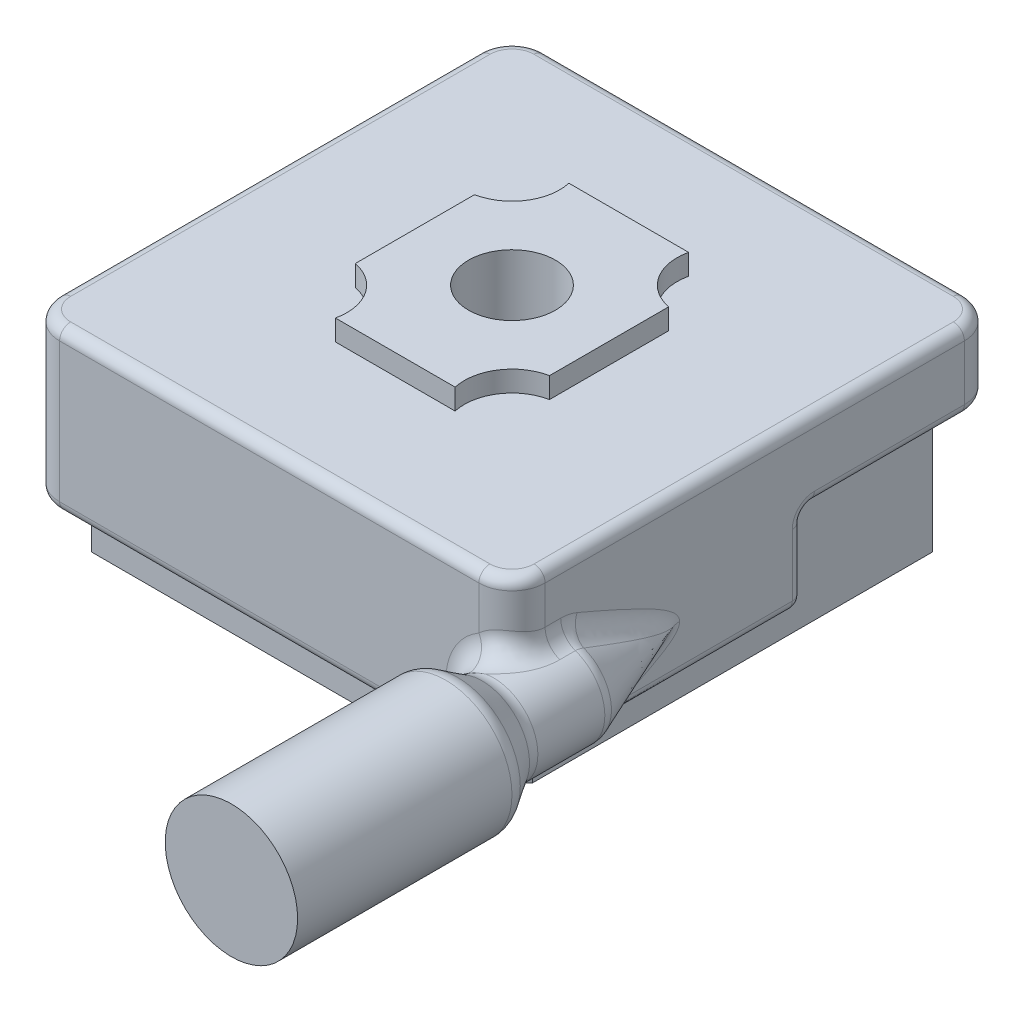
ISO-10303-21;
HEADER;
FILE_DESCRIPTION(('STEP AP214'),'2;1');
FILE_NAME('part.step','',(''),(''),'','','');
FILE_SCHEMA(('AUTOMOTIVE_DESIGN { 1 0 10303 214 1 1 1 1 }'));
ENDSEC;
DATA;
#1=APPLICATION_CONTEXT('core data for automotive mechanical design processes');
#2=APPLICATION_PROTOCOL_DEFINITION('international standard','automotive_design',2000,#1);
#3=PRODUCT_CONTEXT('',#1,'mechanical');
#4=PRODUCT('Part','Part','',(#3));
#5=PRODUCT_RELATED_PRODUCT_CATEGORY('part','',(#4));
#6=PRODUCT_DEFINITION_FORMATION('','',#4);
#7=PRODUCT_DEFINITION_CONTEXT('part definition',#1,'design');
#8=PRODUCT_DEFINITION('design','',#6,#7);
#9=PRODUCT_DEFINITION_SHAPE('','',#8);
#10=(LENGTH_UNIT() NAMED_UNIT(*) SI_UNIT(.MILLI.,.METRE.));
#11=(NAMED_UNIT(*) PLANE_ANGLE_UNIT() SI_UNIT($,.RADIAN.));
#12=(NAMED_UNIT(*) SI_UNIT($,.STERADIAN.) SOLID_ANGLE_UNIT());
#13=UNCERTAINTY_MEASURE_WITH_UNIT(LENGTH_MEASURE(1.E-05),#10,'distance_accuracy_value','');
#14=(GEOMETRIC_REPRESENTATION_CONTEXT(3) GLOBAL_UNCERTAINTY_ASSIGNED_CONTEXT((#13)) GLOBAL_UNIT_ASSIGNED_CONTEXT((#10,
#11,#12)) REPRESENTATION_CONTEXT('',''));
#15=CARTESIAN_POINT('',(0.,0.,0.));
#16=DIRECTION('',(0.,0.,1.));
#17=DIRECTION('',(1.,0.,0.));
#18=AXIS2_PLACEMENT_3D('',#15,#16,#17);
#19=CARTESIAN_POINT('',(12.5543980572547,1.5875,12.5543980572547));
#20=DIRECTION('',(-0.707106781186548,0.,0.707106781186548));
#21=DIRECTION('',(0.707106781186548,0.,0.707106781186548));
#22=AXIS2_PLACEMENT_3D('',#19,#20,#21);
#23=CYLINDRICAL_SURFACE('',#22,0.634999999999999);
#24=DIRECTION('',(-0.707106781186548,0.,0.707106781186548));
#25=VECTOR('',#24,1.);
#26=CARTESIAN_POINT('',(12.1053852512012,1.5875,12.1053852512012));
#27=LINE('',#26,#25);
#28=CARTESIAN_POINT('',(12.7,1.5875,11.5107705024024));
#29=VERTEX_POINT('',#28);
#30=CARTESIAN_POINT('',(11.5107705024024,1.5875,12.7));
#31=VERTEX_POINT('',#30);
#32=EDGE_CURVE('E209',#29,#31,#27,.T.);
#33=ORIENTED_EDGE('',*,*,#32,.F.);
#34=CARTESIAN_POINT('',(13.335,1.5875,11.7737961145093));
#35=DIRECTION('',(-0.38268343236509,0.,0.923879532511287));
#36=DIRECTION('',(0.923879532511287,0.,0.38268343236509));
#37=AXIS2_PLACEMENT_3D('',#34,#35,#36);
#38=ELLIPSE('',#37,0.68731904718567,0.634999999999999);
#39=CARTESIAN_POINT('',(13.335,2.2225,11.7737961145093));
#40=VERTEX_POINT('',#39);
#41=EDGE_CURVE('E196',#40,#29,#38,.T.);
#42=ORIENTED_EDGE('',*,*,#41,.F.);
#43=DIRECTION('',(-0.707106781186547,0.,0.707106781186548));
#44=VECTOR('',#43,1.);
#45=CARTESIAN_POINT('',(13.335,2.2225,11.7737961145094));
#46=LINE('',#45,#44);
#47=CARTESIAN_POINT('',(11.7737961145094,2.2225,13.335));
#48=VERTEX_POINT('',#47);
#49=EDGE_CURVE('E187',#40,#48,#46,.T.);
#50=ORIENTED_EDGE('',*,*,#49,.T.);
#51=CARTESIAN_POINT('',(11.7737961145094,1.5875,13.335));
#52=DIRECTION('',(-0.923879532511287,0.,0.38268343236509));
#53=DIRECTION('',(-0.38268343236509,0.,-0.923879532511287));
#54=AXIS2_PLACEMENT_3D('',#51,#52,#53);
#55=ELLIPSE('',#54,0.68731904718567,0.634999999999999);
#56=EDGE_CURVE('E188',#31,#48,#55,.F.);
#57=ORIENTED_EDGE('',*,*,#56,.F.);
#58=EDGE_LOOP('',(#33,#42,#50,#57));
#59=FACE_BOUND('',#58,.T.);
#60=ADVANCED_FACE('F17',(#59),#23,.F.);
#61=CARTESIAN_POINT('',(13.97,5.08,30.1180284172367));
#62=DIRECTION('',(0.,0.,-1.));
#63=DIRECTION('',(-1.,0.,0.));
#64=AXIS2_PLACEMENT_3D('',#61,#62,#63);
#65=PLANE('',#64);
#66=CARTESIAN_POINT('',(13.97,5.08,30.1180284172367));
#67=DIRECTION('',(0.,0.,1.));
#68=DIRECTION('',(1.,0.,0.));
#69=AXIS2_PLACEMENT_3D('',#66,#67,#68);
#70=CIRCLE('',#69,3.81);
#71=CARTESIAN_POINT('',(17.78,5.08,30.1180284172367));
#72=VERTEX_POINT('',#71);
#73=EDGE_CURVE('E222',#72,#72,#70,.F.);
#74=ORIENTED_EDGE('',*,*,#73,.F.);
#75=EDGE_LOOP('',(#74));
#76=FACE_BOUND('',#75,.T.);
#77=ADVANCED_FACE('F1395',(#76),#65,.F.);
#78=CARTESIAN_POINT('',(0.,2.2225,0.));
#79=DIRECTION('',(0.,1.,0.));
#80=DIRECTION('',(0.,0.,1.));
#81=AXIS2_PLACEMENT_3D('',#78,#79,#80);
#82=PLANE('',#81);
#83=DIRECTION('',(1.,0.,0.));
#84=VECTOR('',#83,1.);
#85=CARTESIAN_POINT('',(0.,2.2225,13.335));
#86=LINE('',#85,#84);
#87=CARTESIAN_POINT('',(12.065,2.2225,13.335));
#88=VERTEX_POINT('',#87);
#89=EDGE_CURVE('E215',#48,#88,#86,.T.);
#90=ORIENTED_EDGE('',*,*,#89,.F.);
#91=ORIENTED_EDGE('',*,*,#49,.F.);
#92=DIRECTION('',(0.,0.,1.));
#93=VECTOR('',#92,1.);
#94=CARTESIAN_POINT('',(13.335,2.2225,0.));
#95=LINE('',#94,#93);
#96=CARTESIAN_POINT('',(13.335,2.2225,12.065));
#97=VERTEX_POINT('',#96);
#98=EDGE_CURVE('E172',#97,#40,#95,.F.);
#99=ORIENTED_EDGE('',*,*,#98,.F.);
#100=CARTESIAN_POINT('',(12.065,2.2225,12.065));
#101=DIRECTION('',(0.,1.,0.));
#102=DIRECTION('',(0.,0.,1.));
#103=AXIS2_PLACEMENT_3D('',#100,#101,#102);
#104=CIRCLE('',#103,1.27);
#105=EDGE_CURVE('E363',#88,#97,#104,.T.);
#106=ORIENTED_EDGE('',*,*,#105,.F.);
#107=EDGE_LOOP('',(#90,#91,#99,#106));
#108=FACE_BOUND('',#107,.T.);
#109=ADVANCED_FACE('F213',(#108),#82,.F.);
#110=CARTESIAN_POINT('',(8.73124999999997,4.826,8.73125000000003));
#111=DIRECTION('',(0.,1.,0.));
#112=DIRECTION('',(0.,0.,1.));
#113=AXIS2_PLACEMENT_3D('',#110,#111,#112);
#114=PLANE('',#113);
#115=CARTESIAN_POINT('',(8.73125,4.826,8.73125));
#116=DIRECTION('',(0.,-1.,0.));
#117=DIRECTION('',(0.,0.,-1.));
#118=AXIS2_PLACEMENT_3D('',#115,#116,#117);
#119=CIRCLE('',#118,1.64999999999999);
#120=CARTESIAN_POINT('',(8.73125,4.826,7.08125));
#121=VERTEX_POINT('',#120);
#122=EDGE_CURVE('E359',#121,#121,#119,.T.);
#123=ORIENTED_EDGE('',*,*,#122,.T.);
#124=EDGE_LOOP('',(#123));
#125=FACE_BOUND('',#124,.T.);
#126=ADVANCED_FACE('F1394',(#125),#114,.F.);
#127=CARTESIAN_POINT('',(8.73124999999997,4.826,8.73125000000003));
#128=DIRECTION('',(0.,1.,0.));
#129=DIRECTION('',(0.,0.,1.));
#130=AXIS2_PLACEMENT_3D('',#127,#128,#129);
#131=PLANE('',#130);
#132=CARTESIAN_POINT('',(-8.73125,4.826,-8.73125));
#133=DIRECTION('',(0.,-1.,0.));
#134=DIRECTION('',(0.,0.,-1.));
#135=AXIS2_PLACEMENT_3D('',#132,#133,#134);
#136=CIRCLE('',#135,1.64999999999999);
#137=CARTESIAN_POINT('',(-8.73125,4.826,-10.38125));
#138=VERTEX_POINT('',#137);
#139=EDGE_CURVE('E355',#138,#138,#136,.T.);
#140=ORIENTED_EDGE('',*,*,#139,.T.);
#141=EDGE_LOOP('',(#140));
#142=FACE_BOUND('',#141,.T.);
#143=ADVANCED_FACE('F3294',(#142),#131,.F.);
#144=CARTESIAN_POINT('',(8.73124999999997,4.826,8.73125000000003));
#145=DIRECTION('',(0.,1.,0.));
#146=DIRECTION('',(0.,0.,1.));
#147=AXIS2_PLACEMENT_3D('',#144,#145,#146);
#148=PLANE('',#147);
#149=CARTESIAN_POINT('',(-8.73125,4.826,8.73125));
#150=DIRECTION('',(0.,-1.,0.));
#151=DIRECTION('',(0.,0.,-1.));
#152=AXIS2_PLACEMENT_3D('',#149,#150,#151);
#153=CIRCLE('',#152,1.64999999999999);
#154=CARTESIAN_POINT('',(-8.73125,4.826,7.08125000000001));
#155=VERTEX_POINT('',#154);
#156=EDGE_CURVE('E351',#155,#155,#153,.T.);
#157=ORIENTED_EDGE('',*,*,#156,.T.);
#158=EDGE_LOOP('',(#157));
#159=FACE_BOUND('',#158,.T.);
#160=ADVANCED_FACE('F3286',(#159),#148,.F.);
#161=CARTESIAN_POINT('',(8.73124999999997,4.826,8.73125000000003));
#162=DIRECTION('',(0.,1.,0.));
#163=DIRECTION('',(0.,0.,1.));
#164=AXIS2_PLACEMENT_3D('',#161,#162,#163);
#165=PLANE('',#164);
#166=CARTESIAN_POINT('',(8.73125,4.826,-8.73125));
#167=DIRECTION('',(0.,-1.,0.));
#168=DIRECTION('',(0.,0.,-1.));
#169=AXIS2_PLACEMENT_3D('',#166,#167,#168);
#170=CIRCLE('',#169,1.64999999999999);
#171=CARTESIAN_POINT('',(8.73125,4.826,-10.38125));
#172=VERTEX_POINT('',#171);
#173=EDGE_CURVE('E346',#172,#172,#170,.T.);
#174=ORIENTED_EDGE('',*,*,#173,.T.);
#175=EDGE_LOOP('',(#174));
#176=FACE_BOUND('',#175,.T.);
#177=ADVANCED_FACE('F3277',(#176),#165,.F.);
#178=CARTESIAN_POINT('',(13.97,5.08,21.4956179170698));
#179=DIRECTION('',(0.,0.,1.));
#180=DIRECTION('',(1.,0.,0.));
#181=AXIS2_PLACEMENT_3D('',#178,#179,#180);
#182=CYLINDRICAL_SURFACE('',#181,3.81);
#183=ORIENTED_EDGE('',*,*,#73,.T.);
#184=EDGE_LOOP('',(#183));
#185=FACE_BOUND('',#184,.T.);
#186=CARTESIAN_POINT('',(13.97,5.08,17.782259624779));
#187=DIRECTION('',(0.,0.,-1.));
#188=DIRECTION('',(-1.,0.,0.));
#189=AXIS2_PLACEMENT_3D('',#186,#187,#188);
#190=CIRCLE('',#189,3.81);
#191=CARTESIAN_POINT('',(10.16,5.08,17.782259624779));
#192=VERTEX_POINT('',#191);
#193=EDGE_CURVE('E226',#192,#192,#190,.T.);
#194=ORIENTED_EDGE('',*,*,#193,.F.);
#195=EDGE_LOOP('',(#194));
#196=FACE_BOUND('',#195,.T.);
#197=ADVANCED_FACE('F1358',(#185,#196),#182,.T.);
#198=CARTESIAN_POINT('',(12.065,2.8575,12.065));
#199=DIRECTION('',(0.,1.,0.));
#200=DIRECTION('',(0.,0.,1.));
#201=AXIS2_PLACEMENT_3D('',#198,#199,#200);
#202=TOROIDAL_SURFACE('',#201,1.27,0.635);
#203=CARTESIAN_POINT('',(12.065,2.8575,13.335));
#204=DIRECTION('',(1.,0.,0.));
#205=DIRECTION('',(0.,0.,1.));
#206=AXIS2_PLACEMENT_3D('',#203,#204,#205);
#207=CIRCLE('',#206,0.635);
#208=CARTESIAN_POINT('',(12.065,2.49848107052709,13.8587656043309));
#209=VERTEX_POINT('',#208);
#210=EDGE_CURVE('E2007',#209,#88,#207,.T.);
#211=ORIENTED_EDGE('',*,*,#210,.T.);
#212=ORIENTED_EDGE('',*,*,#105,.T.);
#213=CARTESIAN_POINT('',(13.335,2.8575,12.065));
#214=DIRECTION('',(0.,0.,-1.));
#215=DIRECTION('',(1.,0.,0.));
#216=AXIS2_PLACEMENT_3D('',#213,#214,#215);
#217=CIRCLE('',#216,0.635);
#218=CARTESIAN_POINT('',(13.6995500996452,2.337569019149,12.065));
#219=VERTEX_POINT('',#218);
#220=EDGE_CURVE('E181',#97,#219,#217,.F.);
#221=ORIENTED_EDGE('',*,*,#220,.T.);
#222=CARTESIAN_POINT('',(13.6995500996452,2.337569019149,12.065));
#223=CARTESIAN_POINT('',(13.6995503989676,2.33756886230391,12.0906404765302));
#224=CARTESIAN_POINT('',(13.698879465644,2.33752178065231,12.116279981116));
#225=CARTESIAN_POINT('',(13.6961535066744,2.33734130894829,12.1686794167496));
#226=CARTESIAN_POINT('',(13.6940356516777,2.33720401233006,12.1954360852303));
#227=CARTESIAN_POINT('',(13.6882503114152,2.33684497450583,12.2499754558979));
#228=CARTESIAN_POINT('',(13.6845185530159,2.33661977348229,12.2777513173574));
#229=CARTESIAN_POINT('',(13.6753276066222,2.33607836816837,12.3342135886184));
#230=CARTESIAN_POINT('',(13.6698024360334,2.33575873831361,12.3628892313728));
#231=CARTESIAN_POINT('',(13.6575176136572,2.33509034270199,12.4182287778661));
#232=CARTESIAN_POINT('',(13.6508482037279,2.33474434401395,12.444912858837));
#233=CARTESIAN_POINT('',(13.6361467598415,2.33403324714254,12.4978691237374));
#234=CARTESIAN_POINT('',(13.6281163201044,2.33366817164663,12.5241417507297));
#235=CARTESIAN_POINT('',(13.6107161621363,2.33291797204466,12.5762042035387));
#236=CARTESIAN_POINT('',(13.6013481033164,2.33253287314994,12.6019945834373));
#237=CARTESIAN_POINT('',(13.5812768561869,2.33172427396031,12.6530102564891));
#238=CARTESIAN_POINT('',(13.5705754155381,2.33130082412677,12.6782362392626));
#239=CARTESIAN_POINT('',(13.5465505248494,2.33044097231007,12.7312398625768));
#240=CARTESIAN_POINT('',(13.5330665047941,2.33000951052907,12.7589446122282));
#241=CARTESIAN_POINT('',(13.5051910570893,2.32930220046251,12.8127528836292));
#242=CARTESIAN_POINT('',(13.4908435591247,2.32902173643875,12.8388791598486));
#243=CARTESIAN_POINT('',(13.4613853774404,2.32859166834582,12.8895433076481));
#244=CARTESIAN_POINT('',(13.4463159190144,2.3284380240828,12.9141051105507));
#245=CARTESIAN_POINT('',(13.4155858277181,2.32826701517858,12.9616828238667));
#246=CARTESIAN_POINT('',(13.3999626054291,2.32824520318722,12.9847229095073));
#247=CARTESIAN_POINT('',(13.3682749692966,2.32833647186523,13.029304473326));
#248=CARTESIAN_POINT('',(13.3522446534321,2.32844490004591,13.0508702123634));
#249=CARTESIAN_POINT('',(13.3198837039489,2.32879784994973,13.0925591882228));
#250=CARTESIAN_POINT('',(13.3035839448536,2.32903740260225,13.1127064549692));
#251=CARTESIAN_POINT('',(13.2708129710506,2.32965414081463,13.151620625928));
#252=CARTESIAN_POINT('',(13.2543696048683,2.33002599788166,13.1704110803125));
#253=CARTESIAN_POINT('',(13.221429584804,2.33090931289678,13.2066776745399));
#254=CARTESIAN_POINT('',(13.2049579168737,2.33141503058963,13.2241766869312));
#255=CARTESIAN_POINT('',(13.1669476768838,2.33275002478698,13.2631890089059));
#256=CARTESIAN_POINT('',(13.1452303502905,2.33362963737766,13.2845268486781));
#257=CARTESIAN_POINT('',(13.1012696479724,2.33566189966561,13.3259017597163));
#258=CARTESIAN_POINT('',(13.0790406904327,2.33680984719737,13.3459544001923));
#259=CARTESIAN_POINT('',(13.0341349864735,2.33938896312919,13.3847972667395));
#260=CARTESIAN_POINT('',(13.0114709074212,2.34081535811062,13.4036024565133));
#261=CARTESIAN_POINT('',(12.9657672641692,2.34396419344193,13.4399886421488));
#262=CARTESIAN_POINT('',(12.9427387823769,2.34568176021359,13.4575839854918));
#263=CARTESIAN_POINT('',(12.8963721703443,2.34942774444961,13.4915879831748));
#264=CARTESIAN_POINT('',(12.873043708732,2.35145116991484,13.5080103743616));
#265=CARTESIAN_POINT('',(12.826137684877,2.35582567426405,13.539704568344));
#266=CARTESIAN_POINT('',(12.8025685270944,2.35817162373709,13.5549895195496));
#267=CARTESIAN_POINT('',(12.7552371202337,2.36320978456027,13.5844430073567));
#268=CARTESIAN_POINT('',(12.7314821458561,2.36589671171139,13.5986241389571));
#269=CARTESIAN_POINT('',(12.6838314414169,2.37163707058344,13.6259017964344));
#270=CARTESIAN_POINT('',(12.659941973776,2.37468504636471,13.6390104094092));
#271=CARTESIAN_POINT('',(12.6120717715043,2.38116916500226,13.6641721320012));
#272=CARTESIAN_POINT('',(12.5880963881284,2.3845996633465,13.6762368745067));
#273=CARTESIAN_POINT('',(12.5401018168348,2.39187166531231,13.6993369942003));
#274=CARTESIAN_POINT('',(12.5160871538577,2.39570731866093,13.7103836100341));
#275=CARTESIAN_POINT('',(12.4680602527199,2.40381336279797,13.7314704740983));
#276=CARTESIAN_POINT('',(12.4440517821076,2.4080776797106,13.7415216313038));
#277=CARTESIAN_POINT('',(12.3960830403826,2.41706535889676,13.760637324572));
#278=CARTESIAN_POINT('',(12.3721258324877,2.42178240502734,13.7697125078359));
#279=CARTESIAN_POINT('',(12.324305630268,2.43170005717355,13.7868927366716));
#280=CARTESIAN_POINT('',(12.3004450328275,2.43689408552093,13.7950082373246));
#281=CARTESIAN_POINT('',(12.2528651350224,2.44779004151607,13.8102822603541));
#282=CARTESIAN_POINT('',(12.2291475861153,2.45348511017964,13.817451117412));
#283=CARTESIAN_POINT('',(12.181902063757,2.46540676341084,13.8308421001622));
#284=CARTESIAN_POINT('',(12.1583752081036,2.47162618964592,13.8370745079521));
#285=CARTESIAN_POINT('',(12.1115630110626,2.48461928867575,13.8485988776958));
#286=CARTESIAN_POINT('',(12.0882781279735,2.49138548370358,13.8539011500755));
#287=CARTESIAN_POINT('',(12.065,2.4984810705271,13.8587656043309));
#288=B_SPLINE_CURVE_WITH_KNOTS('',3,(#222,#223,#224,#225,#226,#227,#228,#229,#230,#231,#232,
#233,#234,#235,#236,#237,#238,#239,#240,#241,#242,#243,#244,#245,#246,#247,#248,#249,#250,#251,
#252,#253,#254,#255,#256,#257,#258,#259,#260,#261,#262,#263,#264,#265,#266,#267,#268,#269,#270,
#271,#272,#273,#274,#275,#276,#277,#278,#279,#280,#281,#282,#283,#284,#285,#286,#287),
.UNSPECIFIED.,.F.,.F.,(4,2,2,2,2,2,2,2,2,2,2,2,2,2,2,2,2,2,2,2,2,2,2,2,2,2,2,2,2,2,2,2,4),(0.,
0.0769113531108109,0.157394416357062,0.241429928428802,0.328995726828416,0.411480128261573,
0.493868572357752,0.576155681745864,0.658336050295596,0.750738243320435,0.84012719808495,
0.926544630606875,1.01002973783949,1.09061917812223,1.16834707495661,1.24324504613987,
1.31534226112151,1.40668672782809,1.49653684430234,1.58496396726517,1.67203550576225,
1.75781472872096,1.84236059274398,1.92572759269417,2.0079656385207,2.08911996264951,
2.16923106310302,2.2483346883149,2.3264618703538,2.40363901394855,2.479888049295,
2.55522665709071,2.62966857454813),.UNSPECIFIED.);
#289=EDGE_CURVE('E2010',#219,#209,#288,.T.);
#290=ORIENTED_EDGE('',*,*,#289,.T.);
#291=EDGE_LOOP('',(#211,#212,#221,#290));
#292=FACE_BOUND('',#291,.T.);
#293=ADVANCED_FACE('F1352',(#292),#202,.T.);
#294=CARTESIAN_POINT('',(8.73125,0.,8.73125));
#295=DIRECTION('',(0.,-1.,0.));
#296=DIRECTION('',(0.,0.,-1.));
#297=AXIS2_PLACEMENT_3D('',#294,#295,#296);
#298=CYLINDRICAL_SURFACE('',#297,1.64999999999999);
#299=ORIENTED_EDGE('',*,*,#122,.F.);
#300=EDGE_LOOP('',(#299));
#301=FACE_BOUND('',#300,.T.);
#302=CARTESIAN_POINT('',(8.73125,0.,8.73125));
#303=DIRECTION('',(0.,-1.,0.));
#304=DIRECTION('',(0.,0.,-1.));
#305=AXIS2_PLACEMENT_3D('',#302,#303,#304);
#306=CIRCLE('',#305,1.64999999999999);
#307=CARTESIAN_POINT('',(8.73125,0.,7.08125));
#308=VERTEX_POINT('',#307);
#309=EDGE_CURVE('E336',#308,#308,#306,.T.);
#310=ORIENTED_EDGE('',*,*,#309,.T.);
#311=EDGE_LOOP('',(#310));
#312=FACE_BOUND('',#311,.T.);
#313=ADVANCED_FACE('F1357',(#301,#312),#298,.F.);
#314=CARTESIAN_POINT('',(-8.73125,0.,-8.73125));
#315=DIRECTION('',(0.,-1.,0.));
#316=DIRECTION('',(0.,0.,-1.));
#317=AXIS2_PLACEMENT_3D('',#314,#315,#316);
#318=CYLINDRICAL_SURFACE('',#317,1.64999999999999);
#319=ORIENTED_EDGE('',*,*,#139,.F.);
#320=EDGE_LOOP('',(#319));
#321=FACE_BOUND('',#320,.T.);
#322=CARTESIAN_POINT('',(-8.73125,0.,-8.73125));
#323=DIRECTION('',(0.,-1.,0.));
#324=DIRECTION('',(0.,0.,-1.));
#325=AXIS2_PLACEMENT_3D('',#322,#323,#324);
#326=CIRCLE('',#325,1.64999999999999);
#327=CARTESIAN_POINT('',(-8.73125,0.,-10.38125));
#328=VERTEX_POINT('',#327);
#329=EDGE_CURVE('E332',#328,#328,#326,.T.);
#330=ORIENTED_EDGE('',*,*,#329,.T.);
#331=EDGE_LOOP('',(#330));
#332=FACE_BOUND('',#331,.T.);
#333=ADVANCED_FACE('F2593',(#321,#332),#318,.F.);
#334=CARTESIAN_POINT('',(-8.73125,0.,8.73125));
#335=DIRECTION('',(0.,-1.,0.));
#336=DIRECTION('',(0.,0.,-1.));
#337=AXIS2_PLACEMENT_3D('',#334,#335,#336);
#338=CYLINDRICAL_SURFACE('',#337,1.64999999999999);
#339=ORIENTED_EDGE('',*,*,#156,.F.);
#340=EDGE_LOOP('',(#339));
#341=FACE_BOUND('',#340,.T.);
#342=CARTESIAN_POINT('',(-8.73125,0.,8.73125));
#343=DIRECTION('',(0.,-1.,0.));
#344=DIRECTION('',(0.,0.,-1.));
#345=AXIS2_PLACEMENT_3D('',#342,#343,#344);
#346=CIRCLE('',#345,1.64999999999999);
#347=CARTESIAN_POINT('',(-8.73125,0.,7.08125000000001));
#348=VERTEX_POINT('',#347);
#349=EDGE_CURVE('E328',#348,#348,#346,.T.);
#350=ORIENTED_EDGE('',*,*,#349,.T.);
#351=EDGE_LOOP('',(#350));
#352=FACE_BOUND('',#351,.T.);
#353=ADVANCED_FACE('F2587',(#341,#352),#338,.F.);
#354=CARTESIAN_POINT('',(8.73125,0.,-8.73125));
#355=DIRECTION('',(0.,-1.,0.));
#356=DIRECTION('',(0.,0.,-1.));
#357=AXIS2_PLACEMENT_3D('',#354,#355,#356);
#358=CYLINDRICAL_SURFACE('',#357,1.64999999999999);
#359=ORIENTED_EDGE('',*,*,#173,.F.);
#360=EDGE_LOOP('',(#359));
#361=FACE_BOUND('',#360,.T.);
#362=CARTESIAN_POINT('',(8.73125,0.,-8.73125));
#363=DIRECTION('',(0.,-1.,0.));
#364=DIRECTION('',(0.,0.,-1.));
#365=AXIS2_PLACEMENT_3D('',#362,#363,#364);
#366=CIRCLE('',#365,1.64999999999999);
#367=CARTESIAN_POINT('',(8.73125,0.,-10.38125));
#368=VERTEX_POINT('',#367);
#369=EDGE_CURVE('E323',#368,#368,#366,.T.);
#370=ORIENTED_EDGE('',*,*,#369,.T.);
#371=EDGE_LOOP('',(#370));
#372=FACE_BOUND('',#371,.T.);
#373=ADVANCED_FACE('F2592',(#361,#372),#358,.F.);
#374=CARTESIAN_POINT('',(0.,0.889,0.));
#375=DIRECTION('',(0.,-1.,0.));
#376=DIRECTION('',(0.,0.,-1.));
#377=AXIS2_PLACEMENT_3D('',#374,#375,#376);
#378=CYLINDRICAL_SURFACE('',#377,8.255);
#379=CARTESIAN_POINT('',(0.,0.,0.));
#380=DIRECTION('',(0.,-1.,0.));
#381=DIRECTION('',(0.,0.,-1.));
#382=AXIS2_PLACEMENT_3D('',#379,#380,#381);
#383=CIRCLE('',#382,8.255);
#384=CARTESIAN_POINT('',(0.,0.,-8.255));
#385=VERTEX_POINT('',#384);
#386=EDGE_CURVE('E340',#385,#385,#383,.T.);
#387=ORIENTED_EDGE('',*,*,#386,.T.);
#388=EDGE_LOOP('',(#387));
#389=FACE_BOUND('',#388,.T.);
#390=CARTESIAN_POINT('',(0.,0.889,0.));
#391=DIRECTION('',(0.,-1.,0.));
#392=DIRECTION('',(0.,0.,-1.));
#393=AXIS2_PLACEMENT_3D('',#390,#391,#392);
#394=CIRCLE('',#393,8.255);
#395=CARTESIAN_POINT('',(0.,0.889,-8.255));
#396=VERTEX_POINT('',#395);
#397=EDGE_CURVE('E318',#396,#396,#394,.T.);
#398=ORIENTED_EDGE('',*,*,#397,.F.);
#399=EDGE_LOOP('',(#398));
#400=FACE_BOUND('',#399,.T.);
#401=ADVANCED_FACE('F2843',(#389,#400),#378,.F.);
#402=CARTESIAN_POINT('',(-11.5107705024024,12.7,-12.7));
#403=DIRECTION('',(0.707106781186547,0.,0.707106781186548));
#404=DIRECTION('',(0.707106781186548,0.,-0.707106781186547));
#405=AXIS2_PLACEMENT_3D('',#402,#403,#404);
#406=PLANE('',#405);
#407=DIRECTION('',(0.707106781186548,0.,-0.707106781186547));
#408=VECTOR('',#407,1.);
#409=CARTESIAN_POINT('',(-24.1703852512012,6.4262,-0.0403852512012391));
#410=LINE('',#409,#408);
#411=CARTESIAN_POINT('',(-12.7,6.4262,-11.5107705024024));
#412=VERTEX_POINT('',#411);
#413=CARTESIAN_POINT('',(-11.5107705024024,6.4262,-12.7));
#414=VERTEX_POINT('',#413);
#415=EDGE_CURVE('E317',#412,#414,#410,.T.);
#416=ORIENTED_EDGE('',*,*,#415,.T.);
#417=DIRECTION('',(0.,1.,0.));
#418=VECTOR('',#417,1.);
#419=CARTESIAN_POINT('',(-11.5107705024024,12.7,-12.7));
#420=LINE('',#419,#418);
#421=CARTESIAN_POINT('',(-11.5107705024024,0.,-12.7));
#422=VERTEX_POINT('',#421);
#423=EDGE_CURVE('E785',#414,#422,#420,.F.);
#424=ORIENTED_EDGE('',*,*,#423,.T.);
#425=DIRECTION('',(-0.707106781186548,0.,0.707106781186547));
#426=VECTOR('',#425,1.);
#427=CARTESIAN_POINT('',(-11.5107705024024,0.,-12.7));
#428=LINE('',#427,#426);
#429=CARTESIAN_POINT('',(-12.7,0.,-11.5107705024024));
#430=VERTEX_POINT('',#429);
#431=EDGE_CURVE('E1291',#422,#430,#428,.T.);
#432=ORIENTED_EDGE('',*,*,#431,.T.);
#433=DIRECTION('',(0.,1.,0.));
#434=VECTOR('',#433,1.);
#435=CARTESIAN_POINT('',(-12.7,12.7,-11.5107705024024));
#436=LINE('',#435,#434);
#437=EDGE_CURVE('E2133',#430,#412,#436,.T.);
#438=ORIENTED_EDGE('',*,*,#437,.T.);
#439=EDGE_LOOP('',(#416,#424,#432,#438));
#440=FACE_BOUND('',#439,.T.);
#441=ADVANCED_FACE('F1307',(#440),#406,.F.);
#442=CARTESIAN_POINT('',(-13.335,2.8575,-2.159));
#443=DIRECTION('',(1.,0.,0.));
#444=DIRECTION('',(0.,0.,-1.));
#445=AXIS2_PLACEMENT_3D('',#442,#443,#444);
#446=TOROIDAL_SURFACE('',#445,1.27,0.635);
#447=CARTESIAN_POINT('',(-12.7,2.8575,-2.159));
#448=DIRECTION('',(-1.,0.,0.));
#449=DIRECTION('',(0.,0.,-1.));
#450=AXIS2_PLACEMENT_3D('',#447,#448,#449);
#451=CIRCLE('',#450,1.27);
#452=CARTESIAN_POINT('',(-12.7,2.8575,-3.429));
#453=VERTEX_POINT('',#452);
#454=CARTESIAN_POINT('',(-12.7,1.5875,-2.159));
#455=VERTEX_POINT('',#454);
#456=EDGE_CURVE('E1317',#453,#455,#451,.T.);
#457=ORIENTED_EDGE('',*,*,#456,.T.);
#458=CARTESIAN_POINT('',(-13.335,1.5875,-2.159));
#459=DIRECTION('',(0.,0.,-1.));
#460=DIRECTION('',(0.,-1.,0.));
#461=AXIS2_PLACEMENT_3D('',#458,#459,#460);
#462=CIRCLE('',#461,0.635);
#463=CARTESIAN_POINT('',(-13.335,2.2225,-2.159));
#464=VERTEX_POINT('',#463);
#465=EDGE_CURVE('E1322',#464,#455,#462,.T.);
#466=ORIENTED_EDGE('',*,*,#465,.F.);
#467=CARTESIAN_POINT('',(-13.335,2.8575,-2.159));
#468=DIRECTION('',(1.,0.,0.));
#469=DIRECTION('',(0.,0.,-1.));
#470=AXIS2_PLACEMENT_3D('',#467,#468,#469);
#471=CIRCLE('',#470,0.635);
#472=CARTESIAN_POINT('',(-13.335,2.8575,-2.794));
#473=VERTEX_POINT('',#472);
#474=EDGE_CURVE('E350',#473,#464,#471,.F.);
#475=ORIENTED_EDGE('',*,*,#474,.F.);
#476=CARTESIAN_POINT('',(-13.335,2.8575,-3.429));
#477=DIRECTION('',(0.,1.,0.));
#478=DIRECTION('',(0.,0.,-1.));
#479=AXIS2_PLACEMENT_3D('',#476,#477,#478);
#480=CIRCLE('',#479,0.635);
#481=EDGE_CURVE('E1331',#453,#473,#480,.F.);
#482=ORIENTED_EDGE('',*,*,#481,.F.);
#483=EDGE_LOOP('',(#457,#466,#475,#482));
#484=FACE_BOUND('',#483,.T.);
#485=ADVANCED_FACE('F1301',(#484),#446,.F.);
#486=CARTESIAN_POINT('',(13.97,5.08,17.782259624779));
#487=DIRECTION('',(0.,0.,-1.));
#488=DIRECTION('',(-1.,0.,0.));
#489=AXIS2_PLACEMENT_3D('',#486,#487,#488);
#490=TOROIDAL_SURFACE('',#489,2.54,1.27);
#491=ORIENTED_EDGE('',*,*,#193,.T.);
#492=EDGE_LOOP('',(#491));
#493=FACE_BOUND('',#492,.T.);
#494=CARTESIAN_POINT('',(13.97,5.08,17.1091609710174));
#495=DIRECTION('',(0.,0.,1.));
#496=DIRECTION('',(1.,0.,0.));
#497=AXIS2_PLACEMENT_3D('',#494,#495,#496);
#498=CIRCLE('',#497,3.61695784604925);
#499=CARTESIAN_POINT('',(17.5869578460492,5.08,17.1091609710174));
#500=VERTEX_POINT('',#499);
#501=EDGE_CURVE('E1275',#500,#500,#498,.F.);
#502=ORIENTED_EDGE('',*,*,#501,.F.);
#503=EDGE_LOOP('',(#502));
#504=FACE_BOUND('',#503,.T.);
#505=ADVANCED_FACE('F1296',(#493,#504),#490,.T.);
#506=CARTESIAN_POINT('',(-11.5107705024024,12.7,12.7));
#507=DIRECTION('',(0.707106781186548,0.,-0.707106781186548));
#508=DIRECTION('',(-0.707106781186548,0.,-0.707106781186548));
#509=AXIS2_PLACEMENT_3D('',#506,#507,#508);
#510=PLANE('',#509);
#511=DIRECTION('',(-0.707106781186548,0.,-0.707106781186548));
#512=VECTOR('',#511,1.);
#513=CARTESIAN_POINT('',(-12.1053852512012,1.5875,12.1053852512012));
#514=LINE('',#513,#512);
#515=CARTESIAN_POINT('',(-11.5107705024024,1.5875,12.7));
#516=VERTEX_POINT('',#515);
#517=CARTESIAN_POINT('',(-12.7,1.5875,11.5107705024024));
#518=VERTEX_POINT('',#517);
#519=EDGE_CURVE('E311',#516,#518,#514,.T.);
#520=ORIENTED_EDGE('',*,*,#519,.T.);
#521=DIRECTION('',(0.,1.,0.));
#522=VECTOR('',#521,1.);
#523=CARTESIAN_POINT('',(-12.7,12.7,11.5107705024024));
#524=LINE('',#523,#522);
#525=CARTESIAN_POINT('',(-12.7,0.,11.5107705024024));
#526=VERTEX_POINT('',#525);
#527=EDGE_CURVE('E312',#518,#526,#524,.F.);
#528=ORIENTED_EDGE('',*,*,#527,.T.);
#529=DIRECTION('',(0.707106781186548,0.,0.707106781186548));
#530=VECTOR('',#529,1.);
#531=CARTESIAN_POINT('',(-12.7,0.,11.5107705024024));
#532=LINE('',#531,#530);
#533=CARTESIAN_POINT('',(-11.5107705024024,0.,12.7));
#534=VERTEX_POINT('',#533);
#535=EDGE_CURVE('E339',#526,#534,#532,.T.);
#536=ORIENTED_EDGE('',*,*,#535,.T.);
#537=DIRECTION('',(0.,1.,0.));
#538=VECTOR('',#537,1.);
#539=CARTESIAN_POINT('',(-11.5107705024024,12.7,12.7));
#540=LINE('',#539,#538);
#541=EDGE_CURVE('E617',#534,#516,#540,.T.);
#542=ORIENTED_EDGE('',*,*,#541,.T.);
#543=EDGE_LOOP('',(#520,#528,#536,#542));
#544=FACE_BOUND('',#543,.T.);
#545=ADVANCED_FACE('F1300',(#544),#510,.F.);
#546=CARTESIAN_POINT('',(13.6995500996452,2.337569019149,12.065));
#547=CARTESIAN_POINT('',(13.9599947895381,2.52018006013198,12.065));
#548=CARTESIAN_POINT('',(14.275766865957,2.55847137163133,12.065));
#549=CARTESIAN_POINT('',(13.6995500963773,2.33756901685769,12.1809778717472));
#550=CARTESIAN_POINT('',(13.9599947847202,2.52018006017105,12.2052362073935));
#551=CARTESIAN_POINT('',(14.2757668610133,2.55847137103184,12.2327384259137));
#552=CARTESIAN_POINT('',(13.6861098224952,2.33664657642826,12.294529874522));
#553=CARTESIAN_POINT('',(13.9460220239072,2.52021264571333,12.3426191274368));
#554=CARTESIAN_POINT('',(14.2614308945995,2.55662648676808,12.3968468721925));
#555=CARTESIAN_POINT('',(13.633969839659,2.33380513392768,12.5184429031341));
#556=CARTESIAN_POINT('',(13.8927508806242,2.52148470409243,12.611862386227));
#557=CARTESIAN_POINT('',(14.2071066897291,2.55094360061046,12.7185803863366));
#558=CARTESIAN_POINT('',(13.59489215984,2.3319135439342,12.6286140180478));
#559=CARTESIAN_POINT('',(13.8530260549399,2.5228012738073,12.7436911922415));
#560=CARTESIAN_POINT('',(14.1668242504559,2.54716042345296,12.8758193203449));
#561=CARTESIAN_POINT('',(13.4474730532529,2.3276245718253,12.9401361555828));
#562=CARTESIAN_POINT('',(13.7061591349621,2.53254286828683,13.1148870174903));
#563=CARTESIAN_POINT('',(14.0196122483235,2.53858247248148,13.3191212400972));
#564=CARTESIAN_POINT('',(13.3046227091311,2.32682252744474,13.1307846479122));
#565=CARTESIAN_POINT('',(13.5670117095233,2.54773692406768,13.3397013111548));
#566=CARTESIAN_POINT('',(13.8837838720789,2.53697839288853,13.5887371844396));
#567=CARTESIAN_POINT('',(13.0589273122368,2.33736657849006,13.3673010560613));
#568=CARTESIAN_POINT('',(13.3392017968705,2.59747884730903,13.6203430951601));
#569=CARTESIAN_POINT('',(13.6583120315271,2.55806648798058,13.9475410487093));
#570=CARTESIAN_POINT('',(12.9717801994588,2.3427581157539,13.4383787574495));
#571=CARTESIAN_POINT('',(13.2589773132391,2.6187372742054,13.7058491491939));
#572=CARTESIAN_POINT('',(13.5790902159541,2.56884956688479,14.0602268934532));
#573=CARTESIAN_POINT('',(12.7913692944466,2.35845537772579,13.5648541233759));
#574=CARTESIAN_POINT('',(13.0957985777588,2.67157962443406,13.8590294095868));
#575=CARTESIAN_POINT('',(13.4136749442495,2.60024408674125,14.2730489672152));
#576=CARTESIAN_POINT('',(12.6973617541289,2.36888232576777,13.6205860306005));
#577=CARTESIAN_POINT('',(13.011924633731,2.70371707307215,13.9270778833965));
#578=CARTESIAN_POINT('',(13.3267093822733,2.62109798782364,14.3738751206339));
#579=CARTESIAN_POINT('',(12.4190125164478,2.40850883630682,13.7615253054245));
#580=CARTESIAN_POINT('',(12.7675852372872,2.81374582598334,14.099594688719));
#581=CARTESIAN_POINT('',(13.0630499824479,2.70035100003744,14.6486949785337));
#582=CARTESIAN_POINT('',(12.2378773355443,2.44578150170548,13.8226423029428));
#583=CARTESIAN_POINT('',(12.6178748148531,2.90502341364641,14.170050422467));
#584=CARTESIAN_POINT('',(12.882949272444,2.77466966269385,14.7976938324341));
#585=CARTESIAN_POINT('',(12.065,2.49848107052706,13.858765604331));
#586=CARTESIAN_POINT('',(12.491278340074,3.00080098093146,14.2030844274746));
#587=CARTESIAN_POINT('',(12.7,2.88029547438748,14.9062968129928));
#588=(BOUNDED_SURFACE() B_SPLINE_SURFACE(3,2,((#546,#547,#548),(#549,#550,#551),(#552,#553,
#554),(#555,#556,#557),(#558,#559,#560),(#561,#562,#563),(#564,#565,#566),(#567,#568,#569),
(#570,#571,#572),(#573,#574,#575),(#576,#577,#578),(#579,#580,#581),(#582,#583,#584),(#585,#586,
#587)),.UNSPECIFIED.,.F.,.F.,.F.) B_SPLINE_SURFACE_WITH_KNOTS((4,2,2,2,2,2,4),(3,3),(0.,
0.000496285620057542,0.000992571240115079,0.00198514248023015,0.00248142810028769,
0.00297771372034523,0.0039702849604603),(0.,1.),
.UNSPECIFIED.) GEOMETRIC_REPRESENTATION_ITEM() RATIONAL_B_SPLINE_SURFACE(((1.,0.970037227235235,
1.),(1.,0.970034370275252,1.),(1.,0.96950751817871,1.),(1.,0.96744006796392,1.),(1.,
0.965892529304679,1.),(1.,0.959851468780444,1.),(1.,0.953833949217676,1.),(1.,0.940672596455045,
1.),(1.,0.93558131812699,1.),(1.,0.923858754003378,1.),(1.,0.91716128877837,1.),(1.,
0.895586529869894,1.),(1.,0.879192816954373,1.),(1.,0.863028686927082,1.))) REPRESENTATION_ITEM('') SURFACE());
#589=CARTESIAN_POINT('',(14.4286502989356,1.29770705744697,12.0649999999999));
#590=DIRECTION('',(0.,0.,1.));
#591=DIRECTION('',(0.,-1.,0.));
#592=AXIS2_PLACEMENT_3D('',#589,#590,#591);
#593=CIRCLE('',#592,1.27000000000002);
#594=CARTESIAN_POINT('',(14.275766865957,2.55847137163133,12.065));
#595=VERTEX_POINT('',#594);
#596=EDGE_CURVE('E599',#595,#219,#593,.T.);
#597=CARTESIAN_POINT('',(14.275766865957,2.55847137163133,12.065));
#598=CARTESIAN_POINT('',(14.2757668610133,2.55847137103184,12.2327384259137));
#599=CARTESIAN_POINT('',(14.2614308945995,2.55662648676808,12.3968468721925));
#600=CARTESIAN_POINT('',(14.2071066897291,2.55094360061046,12.7185803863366));
#601=CARTESIAN_POINT('',(14.1668242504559,2.54716042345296,12.8758193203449));
#602=CARTESIAN_POINT('',(14.0196122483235,2.53858247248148,13.3191212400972));
#603=CARTESIAN_POINT('',(13.8837838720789,2.53697839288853,13.5887371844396));
#604=CARTESIAN_POINT('',(13.6583120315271,2.55806648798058,13.9475410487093));
#605=CARTESIAN_POINT('',(13.5790902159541,2.56884956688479,14.0602268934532));
#606=CARTESIAN_POINT('',(13.4136749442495,2.60024408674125,14.2730489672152));
#607=CARTESIAN_POINT('',(13.3267093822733,2.62109798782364,14.3738751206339));
#608=CARTESIAN_POINT('',(13.0630499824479,2.70035100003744,14.6486949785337));
#609=CARTESIAN_POINT('',(12.882949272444,2.77466966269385,14.7976938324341));
#610=CARTESIAN_POINT('',(12.7,2.88029547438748,14.9062968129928));
#611=(BOUNDED_CURVE() B_SPLINE_CURVE(3,(#597,#598,#599,#600,#601,#602,#603,#604,#605,#606,#607,
#608,#609,#610),.UNSPECIFIED.,.F.,.F.) B_SPLINE_CURVE_WITH_KNOTS((4,2,2,2,2,2,4),(0.,
0.000496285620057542,0.000992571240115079,0.00198514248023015,0.00248142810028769,
0.00297771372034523,0.0039702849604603),
.UNSPECIFIED.) CURVE() GEOMETRIC_REPRESENTATION_ITEM() RATIONAL_B_SPLINE_CURVE((1.,1.,1.,1.,1.,
1.,1.,1.,1.,1.,1.,1.,1.,1.)) REPRESENTATION_ITEM(''));
#612=CARTESIAN_POINT('',(12.7,2.88029547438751,14.9062968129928));
#613=VERTEX_POINT('',#612);
#614=EDGE_CURVE('E970',#613,#595,#611,.F.);
#615=CARTESIAN_POINT('',(12.065,1.78044321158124,14.9062968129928));
#616=DIRECTION('',(0.819245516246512,-0.472991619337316,-0.324215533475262));
#617=DIRECTION('',(0.499999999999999,0.866025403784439,0.));
#618=AXIS2_PLACEMENT_3D('',#615,#616,#617);
#619=CIRCLE('',#618,1.26999999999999);
#620=EDGE_CURVE('E607',#209,#613,#619,.T.);
#621=ORIENTED_EDGE('',*,*,#289,.F.);
#622=ORIENTED_EDGE('',*,*,#596,.F.);
#623=ORIENTED_EDGE('',*,*,#614,.F.);
#624=ORIENTED_EDGE('',*,*,#620,.F.);
#625=EDGE_LOOP('',(#621,#622,#623,#624));
#626=FACE_BOUND('',#625,.T.);
#627=ADVANCED_FACE('F2026',(#626),#588,.F.);
#628=CARTESIAN_POINT('',(12.7,12.7,-11.5107705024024));
#629=DIRECTION('',(-0.707106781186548,0.,0.707106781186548));
#630=DIRECTION('',(0.707106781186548,0.,0.707106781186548));
#631=AXIS2_PLACEMENT_3D('',#628,#629,#630);
#632=PLANE('',#631);
#633=DIRECTION('',(0.707106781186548,0.,0.707106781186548));
#634=VECTOR('',#633,1.);
#635=CARTESIAN_POINT('',(12.7,6.42619999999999,-11.5107705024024));
#636=LINE('',#635,#634);
#637=CARTESIAN_POINT('',(12.7,6.4262,-11.5107705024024));
#638=VERTEX_POINT('',#637);
#639=CARTESIAN_POINT('',(11.5107705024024,6.4262,-12.7));
#640=VERTEX_POINT('',#639);
#641=EDGE_CURVE('E345',#638,#640,#636,.F.);
#642=ORIENTED_EDGE('',*,*,#641,.F.);
#643=DIRECTION('',(0.,1.,0.));
#644=VECTOR('',#643,1.);
#645=CARTESIAN_POINT('',(12.7,12.7,-11.5107705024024));
#646=LINE('',#645,#644);
#647=CARTESIAN_POINT('',(12.7,0.,-11.5107705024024));
#648=VERTEX_POINT('',#647);
#649=EDGE_CURVE('E1242',#638,#648,#646,.F.);
#650=ORIENTED_EDGE('',*,*,#649,.T.);
#651=DIRECTION('',(-0.707106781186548,0.,-0.707106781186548));
#652=VECTOR('',#651,1.);
#653=CARTESIAN_POINT('',(12.7,0.,-11.5107705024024));
#654=LINE('',#653,#652);
#655=CARTESIAN_POINT('',(11.5107705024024,0.,-12.7));
#656=VERTEX_POINT('',#655);
#657=EDGE_CURVE('E344',#648,#656,#654,.T.);
#658=ORIENTED_EDGE('',*,*,#657,.T.);
#659=DIRECTION('',(0.,1.,0.));
#660=VECTOR('',#659,1.);
#661=CARTESIAN_POINT('',(11.5107705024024,12.7,-12.7));
#662=LINE('',#661,#660);
#663=EDGE_CURVE('E783',#656,#640,#662,.T.);
#664=ORIENTED_EDGE('',*,*,#663,.T.);
#665=EDGE_LOOP('',(#642,#650,#658,#664));
#666=FACE_BOUND('',#665,.T.);
#667=ADVANCED_FACE('F2037',(#666),#632,.F.);
#668=CARTESIAN_POINT('',(0.,0.,0.));
#669=DIRECTION('',(0.,1.,0.));
#670=DIRECTION('',(0.,0.,1.));
#671=AXIS2_PLACEMENT_3D('',#668,#669,#670);
#672=PLANE('',#671);
#673=ORIENTED_EDGE('',*,*,#369,.F.);
#674=EDGE_LOOP('',(#673));
#675=FACE_BOUND('',#674,.T.);
#676=ORIENTED_EDGE('',*,*,#349,.F.);
#677=EDGE_LOOP('',(#676));
#678=FACE_BOUND('',#677,.T.);
#679=ORIENTED_EDGE('',*,*,#329,.F.);
#680=EDGE_LOOP('',(#679));
#681=FACE_BOUND('',#680,.T.);
#682=ORIENTED_EDGE('',*,*,#309,.F.);
#683=EDGE_LOOP('',(#682));
#684=FACE_BOUND('',#683,.T.);
#685=ORIENTED_EDGE('',*,*,#535,.F.);
#686=DIRECTION('',(0.,0.,-1.));
#687=VECTOR('',#686,1.);
#688=CARTESIAN_POINT('',(-12.7,0.,-11.5107705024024));
#689=LINE('',#688,#687);
#690=EDGE_CURVE('E316',#526,#430,#689,.T.);
#691=ORIENTED_EDGE('',*,*,#690,.T.);
#692=ORIENTED_EDGE('',*,*,#431,.F.);
#693=DIRECTION('',(1.,0.,0.));
#694=VECTOR('',#693,1.);
#695=CARTESIAN_POINT('',(11.5107705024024,0.,-12.7));
#696=LINE('',#695,#694);
#697=EDGE_CURVE('E322',#422,#656,#696,.T.);
#698=ORIENTED_EDGE('',*,*,#697,.T.);
#699=ORIENTED_EDGE('',*,*,#657,.F.);
#700=DIRECTION('',(0.,0.,1.));
#701=VECTOR('',#700,1.);
#702=CARTESIAN_POINT('',(12.7,0.,-11.5107705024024));
#703=LINE('',#702,#701);
#704=CARTESIAN_POINT('',(12.7,0.,11.5107705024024));
#705=VERTEX_POINT('',#704);
#706=EDGE_CURVE('E1220',#648,#705,#703,.T.);
#707=ORIENTED_EDGE('',*,*,#706,.T.);
#708=DIRECTION('',(-0.707106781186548,0.,0.707106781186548));
#709=VECTOR('',#708,1.);
#710=CARTESIAN_POINT('',(12.7,0.,11.5107705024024));
#711=LINE('',#710,#709);
#712=CARTESIAN_POINT('',(11.5107705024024,0.,12.7));
#713=VERTEX_POINT('',#712);
#714=EDGE_CURVE('E327',#705,#713,#711,.T.);
#715=ORIENTED_EDGE('',*,*,#714,.T.);
#716=DIRECTION('',(-1.,0.,0.));
#717=VECTOR('',#716,1.);
#718=CARTESIAN_POINT('',(11.5107705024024,0.,12.7));
#719=LINE('',#718,#717);
#720=EDGE_CURVE('E1266',#713,#534,#719,.T.);
#721=ORIENTED_EDGE('',*,*,#720,.T.);
#722=EDGE_LOOP('',(#685,#691,#692,#698,#699,#707,#715,#721));
#723=FACE_BOUND('',#722,.T.);
#724=ORIENTED_EDGE('',*,*,#386,.F.);
#725=EDGE_LOOP('',(#724));
#726=FACE_BOUND('',#725,.T.);
#727=ADVANCED_FACE('F2247',(#675,#678,#681,#684,#723,#726),#672,.F.);
#728=CARTESIAN_POINT('',(12.7,12.7,11.5107705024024));
#729=DIRECTION('',(-0.707106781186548,0.,-0.707106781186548));
#730=DIRECTION('',(-0.707106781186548,0.,0.707106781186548));
#731=AXIS2_PLACEMENT_3D('',#728,#729,#730);
#732=PLANE('',#731);
#733=ORIENTED_EDGE('',*,*,#32,.T.);
#734=DIRECTION('',(0.,1.,0.));
#735=VECTOR('',#734,1.);
#736=CARTESIAN_POINT('',(11.5107705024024,12.7,12.7));
#737=LINE('',#736,#735);
#738=EDGE_CURVE('E1255',#31,#713,#737,.F.);
#739=ORIENTED_EDGE('',*,*,#738,.T.);
#740=ORIENTED_EDGE('',*,*,#714,.F.);
#741=DIRECTION('',(0.,1.,0.));
#742=VECTOR('',#741,1.);
#743=CARTESIAN_POINT('',(12.7,12.7,11.5107705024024));
#744=LINE('',#743,#742);
#745=EDGE_CURVE('E1211',#705,#29,#744,.T.);
#746=ORIENTED_EDGE('',*,*,#745,.T.);
#747=EDGE_LOOP('',(#733,#739,#740,#746));
#748=FACE_BOUND('',#747,.T.);
#749=ADVANCED_FACE('F2660',(#748),#732,.F.);
#750=CARTESIAN_POINT('',(13.335,2.8575,-2.159));
#751=DIRECTION('',(-1.,0.,0.));
#752=DIRECTION('',(0.,0.,1.));
#753=AXIS2_PLACEMENT_3D('',#750,#751,#752);
#754=TOROIDAL_SURFACE('',#753,1.27,0.635);
#755=CARTESIAN_POINT('',(12.7,2.8575,-2.159));
#756=DIRECTION('',(1.,0.,0.));
#757=DIRECTION('',(0.,-1.,0.));
#758=AXIS2_PLACEMENT_3D('',#755,#756,#757);
#759=CIRCLE('',#758,1.27);
#760=CARTESIAN_POINT('',(12.7,1.5875,-2.159));
#761=VERTEX_POINT('',#760);
#762=CARTESIAN_POINT('',(12.7,2.8575,-3.429));
#763=VERTEX_POINT('',#762);
#764=EDGE_CURVE('E1207',#761,#763,#759,.T.);
#765=ORIENTED_EDGE('',*,*,#764,.T.);
#766=CARTESIAN_POINT('',(13.335,2.8575,-3.429));
#767=DIRECTION('',(0.,-1.,0.));
#768=DIRECTION('',(0.,0.,-1.));
#769=AXIS2_PLACEMENT_3D('',#766,#767,#768);
#770=CIRCLE('',#769,0.635);
#771=CARTESIAN_POINT('',(13.335,2.8575,-2.794));
#772=VERTEX_POINT('',#771);
#773=EDGE_CURVE('E1346',#772,#763,#770,.T.);
#774=ORIENTED_EDGE('',*,*,#773,.F.);
#775=CARTESIAN_POINT('',(13.335,2.8575,-2.159));
#776=DIRECTION('',(-1.,0.,0.));
#777=DIRECTION('',(0.,0.,1.));
#778=AXIS2_PLACEMENT_3D('',#775,#776,#777);
#779=CIRCLE('',#778,0.635);
#780=CARTESIAN_POINT('',(13.335,2.2225,-2.159));
#781=VERTEX_POINT('',#780);
#782=EDGE_CURVE('E1342',#781,#772,#779,.F.);
#783=ORIENTED_EDGE('',*,*,#782,.F.);
#784=CARTESIAN_POINT('',(13.335,1.5875,-2.159));
#785=DIRECTION('',(0.,0.,1.));
#786=DIRECTION('',(0.,-1.,0.));
#787=AXIS2_PLACEMENT_3D('',#784,#785,#786);
#788=CIRCLE('',#787,0.635);
#789=EDGE_CURVE('E199',#761,#781,#788,.F.);
#790=ORIENTED_EDGE('',*,*,#789,.F.);
#791=EDGE_LOOP('',(#765,#774,#783,#790));
#792=FACE_BOUND('',#791,.T.);
#793=ADVANCED_FACE('F2216',(#792),#754,.F.);
#794=CARTESIAN_POINT('',(0.,0.889,0.));
#795=DIRECTION('',(0.,-1.,0.));
#796=DIRECTION('',(0.,0.,-1.));
#797=AXIS2_PLACEMENT_3D('',#794,#795,#796);
#798=PLANE('',#797);
#799=CARTESIAN_POINT('',(0.,0.889,0.));
#800=DIRECTION('',(0.,-1.,0.));
#801=DIRECTION('',(0.,0.,-1.));
#802=AXIS2_PLACEMENT_3D('',#799,#800,#801);
#803=CIRCLE('',#802,6.25);
#804=CARTESIAN_POINT('',(0.,0.889,-6.25));
#805=VERTEX_POINT('',#804);
#806=EDGE_CURVE('E303',#805,#805,#803,.F.);
#807=ORIENTED_EDGE('',*,*,#806,.T.);
#808=EDGE_LOOP('',(#807));
#809=FACE_BOUND('',#808,.T.);
#810=ORIENTED_EDGE('',*,*,#397,.T.);
#811=EDGE_LOOP('',(#810));
#812=FACE_BOUND('',#811,.T.);
#813=ADVANCED_FACE('F2688',(#809,#812),#798,.T.);
#814=CARTESIAN_POINT('',(11.5107705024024,12.7,-12.7));
#815=DIRECTION('',(0.,0.,1.));
#816=DIRECTION('',(1.,0.,0.));
#817=AXIS2_PLACEMENT_3D('',#814,#815,#816);
#818=PLANE('',#817);
#819=DIRECTION('',(1.,0.,0.));
#820=VECTOR('',#819,1.);
#821=CARTESIAN_POINT('',(-12.065,6.4262,-12.7));
#822=LINE('',#821,#820);
#823=EDGE_CURVE('E302',#414,#640,#822,.T.);
#824=ORIENTED_EDGE('',*,*,#823,.T.);
#825=ORIENTED_EDGE('',*,*,#663,.F.);
#826=ORIENTED_EDGE('',*,*,#697,.F.);
#827=ORIENTED_EDGE('',*,*,#423,.F.);
#828=EDGE_LOOP('',(#824,#825,#826,#827));
#829=FACE_BOUND('',#828,.T.);
#830=ADVANCED_FACE('F780',(#829),#818,.F.);
#831=CARTESIAN_POINT('',(-24.6193980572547,6.4262,-0.489398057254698));
#832=DIRECTION('',(0.707106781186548,0.,-0.707106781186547));
#833=DIRECTION('',(-0.707106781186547,0.,-0.707106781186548));
#834=AXIS2_PLACEMENT_3D('',#831,#832,#833);
#835=CYLINDRICAL_SURFACE('',#834,0.635000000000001);
#836=DIRECTION('',(0.707106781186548,0.,-0.707106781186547));
#837=VECTOR('',#836,1.);
#838=CARTESIAN_POINT('',(-13.335,7.0612,-11.7737961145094));
#839=LINE('',#838,#837);
#840=CARTESIAN_POINT('',(-13.335,7.0612,-11.7737961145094));
#841=VERTEX_POINT('',#840);
#842=CARTESIAN_POINT('',(-11.7737961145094,7.0612,-13.335));
#843=VERTEX_POINT('',#842);
#844=EDGE_CURVE('E293',#841,#843,#839,.T.);
#845=ORIENTED_EDGE('',*,*,#844,.T.);
#846=CARTESIAN_POINT('',(-11.7737961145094,6.4262,-13.335));
#847=DIRECTION('',(0.923879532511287,0.,-0.382683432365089));
#848=DIRECTION('',(-0.382683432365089,0.,-0.923879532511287));
#849=AXIS2_PLACEMENT_3D('',#846,#847,#848);
#850=ELLIPSE('',#849,0.687319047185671,0.635000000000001);
#851=EDGE_CURVE('E294',#843,#414,#850,.T.);
#852=ORIENTED_EDGE('',*,*,#851,.T.);
#853=ORIENTED_EDGE('',*,*,#415,.F.);
#854=CARTESIAN_POINT('',(-13.335,6.4262,-11.7737961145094));
#855=DIRECTION('',(0.38268343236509,0.,-0.923879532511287));
#856=DIRECTION('',(-0.923879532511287,0.,-0.38268343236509));
#857=AXIS2_PLACEMENT_3D('',#854,#855,#856);
#858=ELLIPSE('',#857,0.687319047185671,0.635000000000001);
#859=EDGE_CURVE('E313',#841,#412,#858,.T.);
#860=ORIENTED_EDGE('',*,*,#859,.F.);
#861=EDGE_LOOP('',(#845,#852,#853,#860));
#862=FACE_BOUND('',#861,.T.);
#863=ADVANCED_FACE('F764',(#862),#835,.F.);
#864=CARTESIAN_POINT('',(-12.7,12.7,-11.5107705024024));
#865=DIRECTION('',(1.,0.,0.));
#866=DIRECTION('',(0.,0.,-1.));
#867=AXIS2_PLACEMENT_3D('',#864,#865,#866);
#868=PLANE('',#867);
#869=DIRECTION('',(0.,0.,-1.));
#870=VECTOR('',#869,1.);
#871=CARTESIAN_POINT('',(-12.7,1.5875,0.));
#872=LINE('',#871,#870);
#873=EDGE_CURVE('E292',#518,#455,#872,.T.);
#874=ORIENTED_EDGE('',*,*,#873,.T.);
#875=ORIENTED_EDGE('',*,*,#456,.F.);
#876=DIRECTION('',(0.,1.,0.));
#877=VECTOR('',#876,1.);
#878=CARTESIAN_POINT('',(-12.7,12.7,-3.429));
#879=LINE('',#878,#877);
#880=CARTESIAN_POINT('',(-12.7,6.4262,-3.429));
#881=VERTEX_POINT('',#880);
#882=EDGE_CURVE('E710',#453,#881,#879,.T.);
#883=ORIENTED_EDGE('',*,*,#882,.T.);
#884=DIRECTION('',(0.,0.,-1.));
#885=VECTOR('',#884,1.);
#886=CARTESIAN_POINT('',(-12.7,6.4262,12.065));
#887=LINE('',#886,#885);
#888=EDGE_CURVE('E709',#881,#412,#887,.T.);
#889=ORIENTED_EDGE('',*,*,#888,.T.);
#890=ORIENTED_EDGE('',*,*,#437,.F.);
#891=ORIENTED_EDGE('',*,*,#690,.F.);
#892=ORIENTED_EDGE('',*,*,#527,.F.);
#893=EDGE_LOOP('',(#874,#875,#883,#889,#890,#891,#892));
#894=FACE_BOUND('',#893,.T.);
#895=ADVANCED_FACE('F2253',(#894),#868,.F.);
#896=CARTESIAN_POINT('',(-12.5543980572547,1.5875,12.5543980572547));
#897=DIRECTION('',(-0.707106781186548,0.,-0.707106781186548));
#898=DIRECTION('',(-0.707106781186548,0.,0.707106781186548));
#899=AXIS2_PLACEMENT_3D('',#896,#897,#898);
#900=CYLINDRICAL_SURFACE('',#899,0.634999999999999);
#901=ORIENTED_EDGE('',*,*,#519,.F.);
#902=CARTESIAN_POINT('',(-11.7737961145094,1.5875,13.335));
#903=DIRECTION('',(-0.923879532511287,0.,-0.38268343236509));
#904=DIRECTION('',(-0.38268343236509,0.,0.923879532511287));
#905=AXIS2_PLACEMENT_3D('',#902,#903,#904);
#906=ELLIPSE('',#905,0.68731904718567,0.634999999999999);
#907=CARTESIAN_POINT('',(-11.7737961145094,2.2225,13.335));
#908=VERTEX_POINT('',#907);
#909=EDGE_CURVE('E308',#908,#516,#906,.T.);
#910=ORIENTED_EDGE('',*,*,#909,.F.);
#911=DIRECTION('',(-0.707106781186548,0.,-0.707106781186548));
#912=VECTOR('',#911,1.);
#913=CARTESIAN_POINT('',(-11.7737961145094,2.2225,13.335));
#914=LINE('',#913,#912);
#915=CARTESIAN_POINT('',(-13.335,2.2225,11.7737961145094));
#916=VERTEX_POINT('',#915);
#917=EDGE_CURVE('E713',#908,#916,#914,.T.);
#918=ORIENTED_EDGE('',*,*,#917,.T.);
#919=CARTESIAN_POINT('',(-13.335,1.5875,11.7737961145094));
#920=DIRECTION('',(-0.38268343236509,0.,-0.923879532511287));
#921=DIRECTION('',(-0.923879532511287,0.,0.38268343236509));
#922=AXIS2_PLACEMENT_3D('',#919,#920,#921);
#923=ELLIPSE('',#922,0.68731904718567,0.634999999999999);
#924=EDGE_CURVE('E288',#916,#518,#923,.T.);
#925=ORIENTED_EDGE('',*,*,#924,.T.);
#926=EDGE_LOOP('',(#901,#910,#918,#925));
#927=FACE_BOUND('',#926,.T.);
#928=ADVANCED_FACE('F2855',(#927),#900,.F.);
#929=CARTESIAN_POINT('',(13.97,5.08,17.1091609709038));
#930=DIRECTION('',(0.,0.,1.));
#931=DIRECTION('',(1.,0.,0.));
#932=AXIS2_PLACEMENT_3D('',#929,#930,#931);
#933=CONICAL_SURFACE('',#932,3.6169578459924,0.558599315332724);
#934=CARTESIAN_POINT('',(13.97,5.08,15.6948958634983));
#935=DIRECTION('',(0.,0.,1.));
#936=DIRECTION('',(1.,0.,0.));
#937=AXIS2_PLACEMENT_3D('',#934,#935,#936);
#938=CIRCLE('',#937,2.73304215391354);
#939=CARTESIAN_POINT('',(16.7030421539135,5.08,15.6948958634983));
#940=VERTEX_POINT('',#939);
#941=EDGE_CURVE('E2025',#940,#940,#938,.T.);
#942=ORIENTED_EDGE('',*,*,#941,.T.);
#943=EDGE_LOOP('',(#942));
#944=FACE_BOUND('',#943,.T.);
#945=ORIENTED_EDGE('',*,*,#501,.T.);
#946=EDGE_LOOP('',(#945));
#947=FACE_BOUND('',#946,.T.);
#948=ADVANCED_FACE('F2866',(#944,#947),#933,.T.);
#949=CARTESIAN_POINT('',(11.5107705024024,12.7,12.7));
#950=DIRECTION('',(0.,0.,-1.));
#951=DIRECTION('',(-1.,0.,0.));
#952=AXIS2_PLACEMENT_3D('',#949,#950,#951);
#953=PLANE('',#952);
#954=DIRECTION('',(-1.,0.,0.));
#955=VECTOR('',#954,1.);
#956=CARTESIAN_POINT('',(0.,1.5875,12.7));
#957=LINE('',#956,#955);
#958=EDGE_CURVE('E613',#31,#516,#957,.T.);
#959=ORIENTED_EDGE('',*,*,#958,.T.);
#960=ORIENTED_EDGE('',*,*,#541,.F.);
#961=ORIENTED_EDGE('',*,*,#720,.F.);
#962=ORIENTED_EDGE('',*,*,#738,.F.);
#963=EDGE_LOOP('',(#959,#960,#961,#962));
#964=FACE_BOUND('',#963,.T.);
#965=ADVANCED_FACE('F2632',(#964),#953,.F.);
#966=CARTESIAN_POINT('',(12.7,12.7,-11.5107705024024));
#967=DIRECTION('',(-1.,0.,0.));
#968=DIRECTION('',(0.,0.,1.));
#969=AXIS2_PLACEMENT_3D('',#966,#967,#968);
#970=PLANE('',#969);
#971=DIRECTION('',(0.,0.,1.));
#972=VECTOR('',#971,1.);
#973=CARTESIAN_POINT('',(12.7,1.5875,0.));
#974=LINE('',#973,#972);
#975=EDGE_CURVE('E2089',#761,#29,#974,.T.);
#976=ORIENTED_EDGE('',*,*,#975,.T.);
#977=ORIENTED_EDGE('',*,*,#745,.F.);
#978=ORIENTED_EDGE('',*,*,#706,.F.);
#979=ORIENTED_EDGE('',*,*,#649,.F.);
#980=DIRECTION('',(0.,0.,1.));
#981=VECTOR('',#980,1.);
#982=CARTESIAN_POINT('',(12.7,6.4262,12.065));
#983=LINE('',#982,#981);
#984=CARTESIAN_POINT('',(12.7,6.4262,-3.429));
#985=VERTEX_POINT('',#984);
#986=EDGE_CURVE('E287',#638,#985,#983,.T.);
#987=ORIENTED_EDGE('',*,*,#986,.T.);
#988=DIRECTION('',(0.,-1.,0.));
#989=VECTOR('',#988,1.);
#990=CARTESIAN_POINT('',(12.7,12.7,-3.429));
#991=LINE('',#990,#989);
#992=EDGE_CURVE('E1232',#985,#763,#991,.T.);
#993=ORIENTED_EDGE('',*,*,#992,.T.);
#994=ORIENTED_EDGE('',*,*,#764,.F.);
#995=EDGE_LOOP('',(#976,#977,#978,#979,#987,#993,#994));
#996=FACE_BOUND('',#995,.T.);
#997=ADVANCED_FACE('F557',(#996),#970,.F.);
#998=CARTESIAN_POINT('',(12.7,5.08,11.1665796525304));
#999=DIRECTION('',(0.,1.,0.));
#1000=DIRECTION('',(-1.,0.,0.));
#1001=AXIS2_PLACEMENT_3D('',#998,#999,#1000);
#1002=CIRCLE('',#1001,1.27);
#1003=TRIMMED_CURVE('',#1002,(PARAMETER_VALUE(-3.14159265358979)),
(PARAMETER_VALUE(3.14159265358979)),.T.,.PARAMETER.);
#1004=CARTESIAN_POINT('',(13.97,5.08,11.1665796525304));
#1005=DIRECTION('',(0.,0.,-1.));
#1006=AXIS1_PLACEMENT('',#1004,#1005);
#1007=SURFACE_OF_REVOLUTION('',#1003,#1006);
#1008=CARTESIAN_POINT('',(13.97,5.08,10.6949134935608));
#1009=DIRECTION('',(0.,0.,1.));
#1010=DIRECTION('',(1.,0.,0.));
#1011=AXIS2_PLACEMENT_3D('',#1008,#1009,#1010);
#1012=CIRCLE('',#1011,2.44916539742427);
#1013=CARTESIAN_POINT('',(14.827264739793,7.3742337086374,10.6949134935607));
#1014=VERTEX_POINT('',#1013);
#1015=CARTESIAN_POINT('',(14.4604508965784,2.6804439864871,10.6949134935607));
#1016=VERTEX_POINT('',#1015);
#1017=EDGE_CURVE('E2389',#1014,#1016,#1012,.F.);
#1018=ORIENTED_EDGE('',*,*,#1017,.F.);
#1019=CARTESIAN_POINT('',(14.827264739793,7.37423370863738,10.6949134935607));
#1020=CARTESIAN_POINT('',(14.826381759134,7.38225775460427,10.7129304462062));
#1021=CARTESIAN_POINT('',(14.8255510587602,7.38982844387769,10.7311522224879));
#1022=CARTESIAN_POINT('',(14.8239936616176,7.40408451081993,10.7680757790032));
#1023=CARTESIAN_POINT('',(14.8232676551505,7.41076399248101,10.786779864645));
#1024=CARTESIAN_POINT('',(14.8219258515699,7.42319881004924,10.8246368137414));
#1025=CARTESIAN_POINT('',(14.8213108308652,7.42894760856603,10.8437918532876));
#1026=CARTESIAN_POINT('',(14.8201946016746,7.4394842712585,10.882515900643));
#1027=CARTESIAN_POINT('',(14.8196942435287,7.44426492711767,10.9020868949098));
#1028=CARTESIAN_POINT('',(14.8188089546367,7.45282958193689,10.941605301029));
#1029=CARTESIAN_POINT('',(14.8184249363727,7.4566056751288,10.9615544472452));
#1030=CARTESIAN_POINT('',(14.8177715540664,7.46312718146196,11.0017886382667));
#1031=CARTESIAN_POINT('',(14.817503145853,7.46586398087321,11.0220750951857));
#1032=CARTESIAN_POINT('',(14.8170779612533,7.47027427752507,11.0629404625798));
#1033=CARTESIAN_POINT('',(14.8169221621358,7.47193845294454,11.08352038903));
#1034=CARTESIAN_POINT('',(14.8167159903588,7.47417417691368,11.1249264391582));
#1035=CARTESIAN_POINT('',(14.8166665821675,7.47473572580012,11.1457531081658));
#1036=CARTESIAN_POINT('',(14.8166666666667,7.47473496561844,11.1665796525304));
#1037=B_SPLINE_CURVE_WITH_KNOTS('',3,(#1019,#1020,#1021,#1022,#1023,#1024,#1025,#1026,#1027,
#1028,#1029,#1030,#1031,#1032,#1033,#1034,#1035,#1036),.UNSPECIFIED.,.F.,.F.,(4,2,2,2,2,2,2,2,
4),(0.,0.0592223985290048,0.118818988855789,0.178817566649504,0.239247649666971,
0.300140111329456,0.361526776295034,0.423439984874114,0.485912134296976),.UNSPECIFIED.);
#1038=CARTESIAN_POINT('',(14.8166666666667,7.47473496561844,11.1665796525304));
#1039=VERTEX_POINT('',#1038);
#1040=EDGE_CURVE('E307',#1014,#1039,#1037,.T.);
#1041=ORIENTED_EDGE('',*,*,#1040,.T.);
#1042=CARTESIAN_POINT('',(13.97,5.08,11.1665796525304));
#1043=DIRECTION('',(0.,0.,1.));
#1044=DIRECTION('',(1.,0.,0.));
#1045=AXIS2_PLACEMENT_3D('',#1042,#1043,#1044);
#1046=CIRCLE('',#1045,2.54);
#1047=CARTESIAN_POINT('',(14.275766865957,2.55847137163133,11.1665796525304));
#1048=VERTEX_POINT('',#1047);
#1049=EDGE_CURVE('E909',#1048,#1039,#1046,.T.);
#1050=ORIENTED_EDGE('',*,*,#1049,.F.);
#1051=CARTESIAN_POINT('',(14.275766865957,2.55847137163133,11.1665796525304));
#1052=CARTESIAN_POINT('',(14.2757673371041,2.55847139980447,11.1613869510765));
#1053=CARTESIAN_POINT('',(14.2758457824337,2.55851302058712,11.1561943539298));
#1054=CARTESIAN_POINT('',(14.2761565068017,2.55867932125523,11.1457873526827));
#1055=CARTESIAN_POINT('',(14.2763896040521,2.55880444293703,11.1405729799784));
#1056=CARTESIAN_POINT('',(14.277009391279,2.55913865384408,11.130123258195));
#1057=CARTESIAN_POINT('',(14.2773970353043,2.5593482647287,11.1248879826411));
#1058=CARTESIAN_POINT('',(14.2783254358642,2.55985238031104,11.1143972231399));
#1059=CARTESIAN_POINT('',(14.2788672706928,2.56014748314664,11.109141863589));
#1060=CARTESIAN_POINT('',(14.2801035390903,2.56082360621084,11.0986117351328));
#1061=CARTESIAN_POINT('',(14.2807991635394,2.56120529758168,11.0933371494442));
#1062=CARTESIAN_POINT('',(14.28234240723,2.56205569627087,11.0827693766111));
#1063=CARTESIAN_POINT('',(14.2831913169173,2.56252514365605,11.0774764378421));
#1064=CARTESIAN_POINT('',(14.285040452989,2.56355223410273,11.0668727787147));
#1065=CARTESIAN_POINT('',(14.2860420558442,2.56411068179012,11.0615623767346));
#1066=CARTESIAN_POINT('',(14.2881958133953,2.56531702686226,11.0509246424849));
#1067=CARTESIAN_POINT('',(14.289349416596,2.56596578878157,11.0455977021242));
#1068=CARTESIAN_POINT('',(14.2918063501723,2.56735410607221,11.0349277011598));
#1069=CARTESIAN_POINT('',(14.2931111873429,2.56809458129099,11.0295851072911));
#1070=CARTESIAN_POINT('',(14.2958695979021,2.56966769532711,11.0188848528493));
#1071=CARTESIAN_POINT('',(14.2973247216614,2.57050130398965,11.0135277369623));
#1072=CARTESIAN_POINT('',(14.3019404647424,2.57315918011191,10.9973344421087));
#1073=CARTESIAN_POINT('',(14.3053049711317,2.57511437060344,10.9865769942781));
#1074=CARTESIAN_POINT('',(14.3126093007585,2.57940783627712,10.9650107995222));
#1075=CARTESIAN_POINT('',(14.3165619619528,2.58175485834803,10.9542081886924));
#1076=CARTESIAN_POINT('',(14.325032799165,2.58684570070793,10.9325579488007));
#1077=CARTESIAN_POINT('',(14.3295636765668,2.58959876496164,10.9217174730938));
#1078=CARTESIAN_POINT('',(14.3381449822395,2.59488110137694,10.9023288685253));
#1079=CARTESIAN_POINT('',(14.3421248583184,2.59735465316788,10.8937340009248));
#1080=CARTESIAN_POINT('',(14.3504649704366,2.60260133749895,10.8764067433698));
#1081=CARTESIAN_POINT('',(14.3548337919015,2.60538211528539,10.8676808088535));
#1082=CARTESIAN_POINT('',(14.3639431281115,2.61125926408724,10.8500981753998));
#1083=CARTESIAN_POINT('',(14.3686913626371,2.61436339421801,10.8412480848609));
#1084=CARTESIAN_POINT('',(14.378549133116,2.62090371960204,10.8234239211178));
#1085=CARTESIAN_POINT('',(14.3836655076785,2.624347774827,10.8144565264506));
#1086=CARTESIAN_POINT('',(14.3942482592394,2.63158484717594,10.7964052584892));
#1087=CARTESIAN_POINT('',(14.399720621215,2.63538581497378,10.7873280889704));
#1088=CARTESIAN_POINT('',(14.4110019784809,2.64335367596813,10.7690653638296));
#1089=CARTESIAN_POINT('',(14.4168161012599,2.64752859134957,10.7598864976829));
#1090=CARTESIAN_POINT('',(14.4350349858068,2.66084080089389,10.7317531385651));
#1091=CARTESIAN_POINT('',(14.4476633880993,2.6703912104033,10.7131367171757));
#1092=CARTESIAN_POINT('',(14.4604508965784,2.6804439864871,10.6949134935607));
#1093=B_SPLINE_CURVE_WITH_KNOTS('',3,(#1051,#1052,#1053,#1054,#1055,#1056,#1057,#1058,#1059,
#1060,#1061,#1062,#1063,#1064,#1065,#1066,#1067,#1068,#1069,#1070,#1071,#1072,#1073,#1074,#1075,
#1076,#1077,#1078,#1079,#1080,#1081,#1082,#1083,#1084,#1085,#1086,#1087,#1088,#1089,#1090,#1091,
#1092),.UNSPECIFIED.,.F.,.F.,(4,2,2,2,2,2,2,2,2,2,2,2,2,2,2,2,2,2,2,2,4),(0.,0.0155772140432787,
0.031237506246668,0.0469960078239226,0.0628675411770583,0.0788665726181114,0.0950071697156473,
0.111302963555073,0.127767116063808,0.144412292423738,0.161250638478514,0.1955492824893,
0.230752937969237,0.266938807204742,0.296299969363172,0.326734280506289,0.358264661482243,
0.390909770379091,0.424684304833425,0.459599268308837,0.532869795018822),.UNSPECIFIED.);
#1094=EDGE_CURVE('E1227',#1048,#1016,#1093,.T.);
#1095=ORIENTED_EDGE('',*,*,#1094,.T.);
#1096=EDGE_LOOP('',(#1018,#1041,#1050,#1095));
#1097=FACE_BOUND('',#1096,.T.);
#1098=ADVANCED_FACE('F551',(#1097),#1007,.F.);
#1099=CARTESIAN_POINT('',(12.5543980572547,6.4262,-12.5543980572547));
#1100=DIRECTION('',(0.707106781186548,0.,0.707106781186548));
#1101=DIRECTION('',(0.707106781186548,0.,-0.707106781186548));
#1102=AXIS2_PLACEMENT_3D('',#1099,#1100,#1101);
#1103=CYLINDRICAL_SURFACE('',#1102,0.634999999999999);
#1104=DIRECTION('',(0.707106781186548,0.,0.707106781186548));
#1105=VECTOR('',#1104,1.);
#1106=CARTESIAN_POINT('',(11.7737961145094,7.0612,-13.335));
#1107=LINE('',#1106,#1105);
#1108=CARTESIAN_POINT('',(11.7737961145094,7.0612,-13.335));
#1109=VERTEX_POINT('',#1108);
#1110=CARTESIAN_POINT('',(13.335,7.0612,-11.7737961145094));
#1111=VERTEX_POINT('',#1110);
#1112=EDGE_CURVE('E281',#1109,#1111,#1107,.T.);
#1113=ORIENTED_EDGE('',*,*,#1112,.T.);
#1114=CARTESIAN_POINT('',(13.335,6.4262,-11.7737961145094));
#1115=DIRECTION('',(0.38268343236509,0.,0.923879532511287));
#1116=DIRECTION('',(0.923879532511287,0.,-0.38268343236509));
#1117=AXIS2_PLACEMENT_3D('',#1114,#1115,#1116);
#1118=ELLIPSE('',#1117,0.68731904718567,0.634999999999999);
#1119=EDGE_CURVE('E282',#1111,#638,#1118,.T.);
#1120=ORIENTED_EDGE('',*,*,#1119,.T.);
#1121=ORIENTED_EDGE('',*,*,#641,.T.);
#1122=CARTESIAN_POINT('',(11.7737961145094,6.4262,-13.335));
#1123=DIRECTION('',(0.923879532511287,0.,0.38268343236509));
#1124=DIRECTION('',(-0.38268343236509,0.,0.923879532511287));
#1125=AXIS2_PLACEMENT_3D('',#1122,#1123,#1124);
#1126=ELLIPSE('',#1125,0.68731904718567,0.634999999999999);
#1127=EDGE_CURVE('E299',#640,#1109,#1126,.F.);
#1128=ORIENTED_EDGE('',*,*,#1127,.T.);
#1129=EDGE_LOOP('',(#1113,#1120,#1121,#1128));
#1130=FACE_BOUND('',#1129,.T.);
#1131=ADVANCED_FACE('F556',(#1130),#1103,.F.);
#1132=CARTESIAN_POINT('',(0.,0.,0.));
#1133=DIRECTION('',(0.,-1.,0.));
#1134=DIRECTION('',(0.,0.,-1.));
#1135=AXIS2_PLACEMENT_3D('',#1132,#1133,#1134);
#1136=CYLINDRICAL_SURFACE('',#1135,6.25);
#1137=ORIENTED_EDGE('',*,*,#806,.F.);
#1138=EDGE_LOOP('',(#1137));
#1139=FACE_BOUND('',#1138,.T.);
#1140=CARTESIAN_POINT('',(0.,4.826,0.));
#1141=DIRECTION('',(0.,-1.,0.));
#1142=DIRECTION('',(0.,0.,-1.));
#1143=AXIS2_PLACEMENT_3D('',#1140,#1141,#1142);
#1144=CIRCLE('',#1143,6.25);
#1145=CARTESIAN_POINT('',(0.,4.826,-6.25));
#1146=VERTEX_POINT('',#1145);
#1147=EDGE_CURVE('E276',#1146,#1146,#1144,.F.);
#1148=ORIENTED_EDGE('',*,*,#1147,.T.);
#1149=EDGE_LOOP('',(#1148));
#1150=FACE_BOUND('',#1149,.T.);
#1151=ADVANCED_FACE('F2624',(#1139,#1150),#1136,.F.);
#1152=CARTESIAN_POINT('',(-12.065,6.4262,-13.335));
#1153=DIRECTION('',(1.,0.,0.));
#1154=DIRECTION('',(0.,0.,-1.));
#1155=AXIS2_PLACEMENT_3D('',#1152,#1153,#1154);
#1156=CYLINDRICAL_SURFACE('',#1155,0.635);
#1157=DIRECTION('',(-1.,0.,0.));
#1158=VECTOR('',#1157,1.);
#1159=CARTESIAN_POINT('',(-12.065,7.0612,-13.335));
#1160=LINE('',#1159,#1158);
#1161=EDGE_CURVE('E535',#1109,#843,#1160,.T.);
#1162=ORIENTED_EDGE('',*,*,#1161,.F.);
#1163=ORIENTED_EDGE('',*,*,#1127,.F.);
#1164=ORIENTED_EDGE('',*,*,#823,.F.);
#1165=ORIENTED_EDGE('',*,*,#851,.F.);
#1166=EDGE_LOOP('',(#1162,#1163,#1164,#1165));
#1167=FACE_BOUND('',#1166,.T.);
#1168=ADVANCED_FACE('F727',(#1167),#1156,.F.);
#1169=CARTESIAN_POINT('',(-12.065,7.0612,12.065));
#1170=DIRECTION('',(0.,1.,0.));
#1171=DIRECTION('',(0.,0.,1.));
#1172=AXIS2_PLACEMENT_3D('',#1169,#1170,#1171);
#1173=PLANE('',#1172);
#1174=DIRECTION('',(-1.,0.,0.));
#1175=VECTOR('',#1174,1.);
#1176=CARTESIAN_POINT('',(-12.065,7.0612,-13.335));
#1177=LINE('',#1176,#1175);
#1178=CARTESIAN_POINT('',(-12.065,7.0612,-13.335));
#1179=VERTEX_POINT('',#1178);
#1180=EDGE_CURVE('E526',#843,#1179,#1177,.T.);
#1181=ORIENTED_EDGE('',*,*,#1180,.F.);
#1182=ORIENTED_EDGE('',*,*,#844,.F.);
#1183=DIRECTION('',(0.,0.,1.));
#1184=VECTOR('',#1183,1.);
#1185=CARTESIAN_POINT('',(-13.335,7.0612,12.065));
#1186=LINE('',#1185,#1184);
#1187=CARTESIAN_POINT('',(-13.335,7.0612,-12.065));
#1188=VERTEX_POINT('',#1187);
#1189=EDGE_CURVE('E298',#1188,#841,#1186,.T.);
#1190=ORIENTED_EDGE('',*,*,#1189,.F.);
#1191=CARTESIAN_POINT('',(-12.065,7.0612,-12.065));
#1192=DIRECTION('',(0.,1.,0.));
#1193=DIRECTION('',(0.,0.,-1.));
#1194=AXIS2_PLACEMENT_3D('',#1191,#1192,#1193);
#1195=CIRCLE('',#1194,1.27);
#1196=EDGE_CURVE('E505',#1179,#1188,#1195,.T.);
#1197=ORIENTED_EDGE('',*,*,#1196,.F.);
#1198=EDGE_LOOP('',(#1181,#1182,#1190,#1197));
#1199=FACE_BOUND('',#1198,.T.);
#1200=ADVANCED_FACE('F722',(#1199),#1173,.F.);
#1201=CARTESIAN_POINT('',(-13.335,1.5875,0.));
#1202=DIRECTION('',(0.,0.,-1.));
#1203=DIRECTION('',(-1.,0.,0.));
#1204=AXIS2_PLACEMENT_3D('',#1201,#1202,#1203);
#1205=CYLINDRICAL_SURFACE('',#1204,0.635);
#1206=ORIENTED_EDGE('',*,*,#873,.F.);
#1207=ORIENTED_EDGE('',*,*,#924,.F.);
#1208=DIRECTION('',(0.,0.,-1.));
#1209=VECTOR('',#1208,1.);
#1210=CARTESIAN_POINT('',(-13.335,2.2225,0.));
#1211=LINE('',#1210,#1209);
#1212=EDGE_CURVE('E504',#464,#916,#1211,.F.);
#1213=ORIENTED_EDGE('',*,*,#1212,.F.);
#1214=ORIENTED_EDGE('',*,*,#465,.T.);
#1215=EDGE_LOOP('',(#1206,#1207,#1213,#1214));
#1216=FACE_BOUND('',#1215,.T.);
#1217=ADVANCED_FACE('F718',(#1216),#1205,.F.);
#1218=CARTESIAN_POINT('',(-13.335,2.8575,-2.159));
#1219=DIRECTION('',(1.,0.,0.));
#1220=DIRECTION('',(0.,0.,-1.));
#1221=AXIS2_PLACEMENT_3D('',#1218,#1219,#1220);
#1222=SPHERICAL_SURFACE('',#1221,0.635);
#1223=ORIENTED_EDGE('',*,*,#474,.T.);
#1224=CARTESIAN_POINT('',(-13.335,2.8575,-2.159));
#1225=DIRECTION('',(0.,0.,-1.));
#1226=DIRECTION('',(-1.,0.,0.));
#1227=AXIS2_PLACEMENT_3D('',#1224,#1225,#1226);
#1228=CIRCLE('',#1227,0.635);
#1229=CARTESIAN_POINT('',(-13.97,2.8575,-2.159));
#1230=VERTEX_POINT('',#1229);
#1231=EDGE_CURVE('E500',#1230,#464,#1228,.F.);
#1232=ORIENTED_EDGE('',*,*,#1231,.F.);
#1233=CARTESIAN_POINT('',(-13.335,2.8575,-2.159));
#1234=DIRECTION('',(0.,-1.,0.));
#1235=DIRECTION('',(0.,0.,-1.));
#1236=AXIS2_PLACEMENT_3D('',#1233,#1234,#1235);
#1237=CIRCLE('',#1236,0.635);
#1238=EDGE_CURVE('E494',#473,#1230,#1237,.F.);
#1239=ORIENTED_EDGE('',*,*,#1238,.F.);
#1240=EDGE_LOOP('',(#1223,#1232,#1239));
#1241=FACE_BOUND('',#1240,.T.);
#1242=ADVANCED_FACE('F715',(#1241),#1222,.T.);
#1243=CARTESIAN_POINT('',(-13.335,12.7,-3.429));
#1244=DIRECTION('',(0.,1.,0.));
#1245=DIRECTION('',(0.,0.,1.));
#1246=AXIS2_PLACEMENT_3D('',#1243,#1244,#1245);
#1247=CYLINDRICAL_SURFACE('',#1246,0.635);
#1248=DIRECTION('',(0.,-1.,0.));
#1249=VECTOR('',#1248,1.);
#1250=CARTESIAN_POINT('',(-13.335,-32.5833591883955,-2.794));
#1251=LINE('',#1250,#1249);
#1252=CARTESIAN_POINT('',(-13.335,6.4262,-2.794));
#1253=VERTEX_POINT('',#1252);
#1254=EDGE_CURVE('E498',#1253,#473,#1251,.T.);
#1255=ORIENTED_EDGE('',*,*,#1254,.F.);
#1256=CARTESIAN_POINT('',(-13.335,6.4262,-3.429));
#1257=DIRECTION('',(0.,-1.,0.));
#1258=DIRECTION('',(1.,0.,0.));
#1259=AXIS2_PLACEMENT_3D('',#1256,#1257,#1258);
#1260=CIRCLE('',#1259,0.635);
#1261=EDGE_CURVE('E705',#1253,#881,#1260,.F.);
#1262=ORIENTED_EDGE('',*,*,#1261,.T.);
#1263=ORIENTED_EDGE('',*,*,#882,.F.);
#1264=ORIENTED_EDGE('',*,*,#481,.T.);
#1265=EDGE_LOOP('',(#1255,#1262,#1263,#1264));
#1266=FACE_BOUND('',#1265,.T.);
#1267=ADVANCED_FACE('F698',(#1266),#1247,.F.);
#1268=CARTESIAN_POINT('',(-13.335,6.4262,-3.429));
#1269=DIRECTION('',(1.,0.,0.));
#1270=DIRECTION('',(0.,0.,-1.));
#1271=AXIS2_PLACEMENT_3D('',#1268,#1269,#1270);
#1272=SPHERICAL_SURFACE('',#1271,0.635);
#1273=CARTESIAN_POINT('',(-13.335,6.4262,-3.429));
#1274=DIRECTION('',(1.,0.,0.));
#1275=DIRECTION('',(0.,0.,-1.));
#1276=AXIS2_PLACEMENT_3D('',#1273,#1274,#1275);
#1277=CIRCLE('',#1276,0.635);
#1278=CARTESIAN_POINT('',(-13.335,7.0612,-3.429));
#1279=VERTEX_POINT('',#1278);
#1280=EDGE_CURVE('E491',#1279,#1253,#1277,.T.);
#1281=ORIENTED_EDGE('',*,*,#1280,.F.);
#1282=CARTESIAN_POINT('',(-13.335,6.4262,-3.429));
#1283=DIRECTION('',(0.,0.,-1.));
#1284=DIRECTION('',(-1.,0.,0.));
#1285=AXIS2_PLACEMENT_3D('',#1282,#1283,#1284);
#1286=CIRCLE('',#1285,0.635);
#1287=EDGE_CURVE('E759',#1279,#881,#1286,.T.);
#1288=ORIENTED_EDGE('',*,*,#1287,.T.);
#1289=ORIENTED_EDGE('',*,*,#1261,.F.);
#1290=EDGE_LOOP('',(#1281,#1288,#1289));
#1291=FACE_BOUND('',#1290,.T.);
#1292=ADVANCED_FACE('F693',(#1291),#1272,.F.);
#1293=CARTESIAN_POINT('',(-13.335,6.4262,12.065));
#1294=DIRECTION('',(0.,0.,-1.));
#1295=DIRECTION('',(-1.,0.,0.));
#1296=AXIS2_PLACEMENT_3D('',#1293,#1294,#1295);
#1297=CYLINDRICAL_SURFACE('',#1296,0.635);
#1298=DIRECTION('',(0.,0.,1.));
#1299=VECTOR('',#1298,1.);
#1300=CARTESIAN_POINT('',(-13.335,7.0612,-12.065));
#1301=LINE('',#1300,#1299);
#1302=EDGE_CURVE('E441',#841,#1279,#1301,.T.);
#1303=ORIENTED_EDGE('',*,*,#1302,.F.);
#1304=ORIENTED_EDGE('',*,*,#859,.T.);
#1305=ORIENTED_EDGE('',*,*,#888,.F.);
#1306=ORIENTED_EDGE('',*,*,#1287,.F.);
#1307=EDGE_LOOP('',(#1303,#1304,#1305,#1306));
#1308=FACE_BOUND('',#1307,.T.);
#1309=ADVANCED_FACE('F690',(#1308),#1297,.F.);
#1310=CARTESIAN_POINT('',(0.,2.2225,0.));
#1311=DIRECTION('',(0.,1.,0.));
#1312=DIRECTION('',(0.,0.,1.));
#1313=AXIS2_PLACEMENT_3D('',#1310,#1311,#1312);
#1314=PLANE('',#1313);
#1315=DIRECTION('',(1.,0.,0.));
#1316=VECTOR('',#1315,1.);
#1317=CARTESIAN_POINT('',(0.,2.2225,13.335));
#1318=LINE('',#1317,#1316);
#1319=CARTESIAN_POINT('',(-12.065,2.2225,13.335));
#1320=VERTEX_POINT('',#1319);
#1321=EDGE_CURVE('E679',#1320,#908,#1318,.T.);
#1322=ORIENTED_EDGE('',*,*,#1321,.F.);
#1323=CARTESIAN_POINT('',(-12.065,2.2225,12.065));
#1324=DIRECTION('',(0.,1.,0.));
#1325=DIRECTION('',(-1.,0.,0.));
#1326=AXIS2_PLACEMENT_3D('',#1323,#1324,#1325);
#1327=CIRCLE('',#1326,1.27);
#1328=CARTESIAN_POINT('',(-13.335,2.2225,12.065));
#1329=VERTEX_POINT('',#1328);
#1330=EDGE_CURVE('E440',#1329,#1320,#1327,.T.);
#1331=ORIENTED_EDGE('',*,*,#1330,.F.);
#1332=DIRECTION('',(0.,0.,-1.));
#1333=VECTOR('',#1332,1.);
#1334=CARTESIAN_POINT('',(-13.335,2.2225,0.));
#1335=LINE('',#1334,#1333);
#1336=EDGE_CURVE('E499',#916,#1329,#1335,.F.);
#1337=ORIENTED_EDGE('',*,*,#1336,.F.);
#1338=ORIENTED_EDGE('',*,*,#917,.F.);
#1339=EDGE_LOOP('',(#1322,#1331,#1337,#1338));
#1340=FACE_BOUND('',#1339,.T.);
#1341=ADVANCED_FACE('F681',(#1340),#1314,.F.);
#1342=CARTESIAN_POINT('',(13.97,5.08,15.0217972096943));
#1343=DIRECTION('',(0.,0.,1.));
#1344=DIRECTION('',(1.,0.,0.));
#1345=AXIS2_PLACEMENT_3D('',#1342,#1343,#1344);
#1346=TOROIDAL_SURFACE('',#1345,3.81,1.27);
#1347=CARTESIAN_POINT('',(12.5006672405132,3.00816551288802,15.0217972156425));
#1348=CARTESIAN_POINT('',(12.4919969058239,3.01431491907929,15.023883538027));
#1349=CARTESIAN_POINT('',(12.4833799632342,3.0204996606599,15.026080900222));
#1350=CARTESIAN_POINT('',(12.4553608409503,3.04085233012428,15.0334438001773));
#1351=CARTESIAN_POINT('',(12.4361440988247,3.05519437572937,15.0388384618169));
#1352=CARTESIAN_POINT('',(12.4032257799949,3.08043497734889,15.0475091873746));
#1353=CARTESIAN_POINT('',(12.3894629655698,3.09119397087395,15.0509595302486));
#1354=CARTESIAN_POINT('',(12.3621394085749,3.11298162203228,15.0577731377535));
#1355=CARTESIAN_POINT('',(12.3485785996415,3.12401018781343,15.0611364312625));
#1356=CARTESIAN_POINT('',(12.3217205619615,3.14629235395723,15.0676626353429));
#1357=CARTESIAN_POINT('',(12.3084223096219,3.15754443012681,15.0708265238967));
#1358=CARTESIAN_POINT('',(12.2819902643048,3.18036617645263,15.0769821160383));
#1359=CARTESIAN_POINT('',(12.2688570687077,3.1919366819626,15.0799732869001));
#1360=CARTESIAN_POINT('',(12.2427799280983,3.21537869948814,15.0857640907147));
#1361=CARTESIAN_POINT('',(12.2298363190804,3.2272506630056,15.0885634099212));
#1362=CARTESIAN_POINT('',(12.204154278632,3.25129030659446,15.0939493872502));
#1363=CARTESIAN_POINT('',(12.1914160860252,3.26345829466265,15.096535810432));
#1364=CARTESIAN_POINT('',(12.1660373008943,3.28821112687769,15.1014964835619));
#1365=CARTESIAN_POINT('',(12.1533991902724,3.3007990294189,15.1038681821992));
#1366=CARTESIAN_POINT('',(12.1284686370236,3.32616963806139,15.1083394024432));
#1367=CARTESIAN_POINT('',(12.1161742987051,3.33895014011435,15.1104408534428));
#1368=CARTESIAN_POINT('',(12.0919254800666,3.36471170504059,15.114358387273));
#1369=CARTESIAN_POINT('',(12.0799692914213,3.37769088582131,15.1161762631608));
#1370=CARTESIAN_POINT('',(12.0563893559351,3.4038577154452,15.1195152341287));
#1371=CARTESIAN_POINT('',(12.0447641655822,3.41704386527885,15.1210378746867));
#1372=CARTESIAN_POINT('',(12.0218369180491,3.44363527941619,15.1237732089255));
#1373=CARTESIAN_POINT('',(12.0105337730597,3.45703948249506,15.1249870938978));
#1374=CARTESIAN_POINT('',(11.9882395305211,3.48408056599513,15.1270904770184));
#1375=CARTESIAN_POINT('',(11.977247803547,3.4977168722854,15.127980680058));
#1376=CARTESIAN_POINT('',(11.9555636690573,3.52523923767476,15.1294203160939));
#1377=CARTESIAN_POINT('',(11.9448712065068,3.53912525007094,15.1299698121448));
#1378=CARTESIAN_POINT('',(11.9237708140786,3.56716715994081,15.1307097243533));
#1379=CARTESIAN_POINT('',(11.9133635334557,3.5813235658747,15.1308993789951));
#1380=CARTESIAN_POINT('',(11.9031151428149,3.59559461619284,15.1308986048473));
#1381=B_SPLINE_CURVE_WITH_KNOTS('',3,(#1347,#1348,#1349,#1350,#1351,#1352,#1353,#1354,#1355,
#1356,#1357,#1358,#1359,#1360,#1361,#1362,#1363,#1364,#1365,#1366,#1367,#1368,#1369,#1370,#1371,
#1372,#1373,#1374,#1375,#1376,#1377,#1378,#1379,#1380),.UNSPECIFIED.,.F.,.F.,(4,2,2,2,2,2,2,2,2,
2,2,2,2,2,2,2,4),(0.,0.0324952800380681,0.106213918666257,0.159628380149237,0.213024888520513,
0.266135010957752,0.319401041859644,0.372752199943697,0.426161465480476,0.480139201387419,
0.53370720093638,0.586921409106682,0.63984905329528,0.692569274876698,0.745173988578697,
0.797768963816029,0.850475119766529),.UNSPECIFIED.);
#1382=CARTESIAN_POINT('',(12.5006579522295,3.0081524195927,15.0217972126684));
#1383=VERTEX_POINT('',#1382);
#1384=CARTESIAN_POINT('',(11.9031151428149,3.59559461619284,15.1308986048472));
#1385=VERTEX_POINT('',#1384);
#1386=EDGE_CURVE('E582',#1383,#1385,#1381,.T.);
#1387=ORIENTED_EDGE('',*,*,#1386,.F.);
#1388=CARTESIAN_POINT('',(13.97,5.08,15.0217972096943));
#1389=DIRECTION('',(0.,0.,1.));
#1390=DIRECTION('',(1.,0.,0.));
#1391=AXIS2_PLACEMENT_3D('',#1388,#1389,#1390);
#1392=CIRCLE('',#1391,2.54);
#1393=CARTESIAN_POINT('',(13.4711391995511,7.57052963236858,15.0217971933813));
#1394=VERTEX_POINT('',#1393);
#1395=EDGE_CURVE('E589',#1394,#1383,#1392,.F.);
#1396=ORIENTED_EDGE('',*,*,#1395,.F.);
#1397=CARTESIAN_POINT('',(12.6976525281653,7.28377046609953,15.1308986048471));
#1398=CARTESIAN_POINT('',(12.7293335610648,7.30206829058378,15.1309013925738));
#1399=CARTESIAN_POINT('',(12.7614365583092,7.31964053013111,15.1303386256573));
#1400=CARTESIAN_POINT('',(12.8255431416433,7.35284819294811,15.1280486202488));
#1401=CARTESIAN_POINT('',(12.8575280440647,7.36852180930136,15.1263517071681));
#1402=CARTESIAN_POINT('',(12.9215045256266,7.39811848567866,15.1218078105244));
#1403=CARTESIAN_POINT('',(12.953485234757,7.41206836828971,15.1189824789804));
#1404=CARTESIAN_POINT('',(13.0175634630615,7.43840903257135,15.1122066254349));
#1405=CARTESIAN_POINT('',(13.0496560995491,7.45081485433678,15.1082684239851));
#1406=CARTESIAN_POINT('',(13.114062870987,7.47417651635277,15.09917258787));
#1407=CARTESIAN_POINT('',(13.1463758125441,7.48513735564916,15.0940193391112));
#1408=CARTESIAN_POINT('',(13.2111602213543,7.50569813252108,15.0825523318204));
#1409=CARTESIAN_POINT('',(13.2436313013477,7.51530047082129,15.076240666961));
#1410=CARTESIAN_POINT('',(13.3086330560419,7.53321811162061,15.0625238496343));
#1411=CARTESIAN_POINT('',(13.3411635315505,7.54153560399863,15.0551206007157));
#1412=CARTESIAN_POINT('',(13.4061863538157,7.55693766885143,15.0392511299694));
#1413=CARTESIAN_POINT('',(13.4386786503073,7.56402462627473,15.0307870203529));
#1414=CARTESIAN_POINT('',(13.4711391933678,7.57052961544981,15.0217971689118));
#1415=B_SPLINE_CURVE_WITH_KNOTS('',3,(#1397,#1398,#1399,#1400,#1401,#1402,#1403,#1404,#1405,
#1406,#1407,#1408,#1409,#1410,#1411,#1412,#1413,#1414),.UNSPECIFIED.,.F.,.F.,(4,2,2,2,2,2,2,2,
4),(0.,0.109746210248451,0.216669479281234,0.321632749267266,0.425476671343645,
0.528951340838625,0.632240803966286,0.73535223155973,0.83826152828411),.UNSPECIFIED.);
#1416=CARTESIAN_POINT('',(12.6976525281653,7.28377046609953,15.1308986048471));
#1417=VERTEX_POINT('',#1416);
#1418=EDGE_CURVE('E660',#1417,#1394,#1415,.T.);
#1419=ORIENTED_EDGE('',*,*,#1418,.F.);
#1420=CARTESIAN_POINT('',(13.97,5.08,15.1308986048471));
#1421=DIRECTION('',(0.,0.,-1.));
#1422=DIRECTION('',(-1.,0.,0.));
#1423=AXIS2_PLACEMENT_3D('',#1420,#1421,#1422);
#1424=CIRCLE('',#1423,2.54469494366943);
#1425=EDGE_CURVE('E426',#1417,#1385,#1424,.F.);
#1426=ORIENTED_EDGE('',*,*,#1425,.T.);
#1427=EDGE_LOOP('',(#1387,#1396,#1419,#1426));
#1428=FACE_BOUND('',#1427,.T.);
#1429=ORIENTED_EDGE('',*,*,#941,.F.);
#1430=EDGE_LOOP('',(#1429));
#1431=FACE_BOUND('',#1430,.T.);
#1432=ADVANCED_FACE('F584',(#1428,#1431),#1346,.F.);
#1433=CARTESIAN_POINT('',(11.9069285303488,3.59833333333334,15.24));
#1434=CARTESIAN_POINT('',(11.9069285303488,3.59833333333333,13.97));
#1435=CARTESIAN_POINT('',(10.8753927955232,2.8575,13.97));
#1436=CARTESIAN_POINT('',(12.0155034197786,3.44715374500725,15.239999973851));
#1437=CARTESIAN_POINT('',(11.9428746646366,3.54828190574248,14.0558024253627));
#1438=CARTESIAN_POINT('',(11.0383687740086,2.78185746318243,13.97));
#1439=CARTESIAN_POINT('',(12.136846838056,3.31267116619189,15.2009212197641));
#1440=CARTESIAN_POINT('',(12.0048268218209,3.45318805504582,14.1271472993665));
#1441=CARTESIAN_POINT('',(11.2202702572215,2.71466891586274,13.9569737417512));
#1442=CARTESIAN_POINT('',(12.4039731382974,3.0721500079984,15.0792228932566));
#1443=CARTESIAN_POINT('',(12.2029350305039,3.23296507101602,14.2054749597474));
#1444=CARTESIAN_POINT('',(11.6209597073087,2.59440833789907,13.9164076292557));
#1445=CARTESIAN_POINT('',(12.5489719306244,2.96749157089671,14.9959506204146));
#1446=CARTESIAN_POINT('',(12.3339229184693,3.11126554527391,14.2157102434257));
#1447=CARTESIAN_POINT('',(11.8384376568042,2.5420830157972,13.8886528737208));
#1448=CARTESIAN_POINT('',(12.7,2.88029547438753,14.9062968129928));
#1449=CARTESIAN_POINT('',(12.491278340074,3.00080098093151,14.2030844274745));
#1450=CARTESIAN_POINT('',(12.065,2.4984810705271,13.8587656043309));
#1451=(BOUNDED_SURFACE() B_SPLINE_SURFACE(3,2,((#1433,#1434,#1435),(#1436,#1437,#1438),(#1439,
#1440,#1441),(#1442,#1443,#1444),(#1445,#1446,#1447),(#1448,#1449,#1450)),.UNSPECIFIED.,.F.,.F.,
.F.) B_SPLINE_SURFACE_WITH_KNOTS((4,2,4),(3,3),(0.,0.000823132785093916,0.00164626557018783),
(0.,1.),.UNSPECIFIED.) GEOMETRIC_REPRESENTATION_ITEM() RATIONAL_B_SPLINE_SURFACE(((1.,
0.707106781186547,1.),(1.,0.731747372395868,1.),(1.,0.75944062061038,1.),(1.,0.813789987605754,
1.),(1.,0.840246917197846,1.),(1.,0.863028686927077,1.))) REPRESENTATION_ITEM('') SURFACE());
#1452=CARTESIAN_POINT('',(12.7,2.88029547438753,14.9062968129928));
#1453=CARTESIAN_POINT('',(12.6915219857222,2.88519028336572,14.9113306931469));
#1454=CARTESIAN_POINT('',(12.6830634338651,2.89013980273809,14.9163442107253));
#1455=CARTESIAN_POINT('',(12.6661862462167,2.90014825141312,14.9263253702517));
#1456=CARTESIAN_POINT('',(12.6577676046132,2.90520716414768,14.9312930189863));
#1457=CARTESIAN_POINT('',(12.6409721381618,2.9154337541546,14.9411767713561));
#1458=CARTESIAN_POINT('',(12.6325952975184,2.92060138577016,14.9460928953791));
#1459=CARTESIAN_POINT('',(12.6158853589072,2.93104479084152,14.9558679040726));
#1460=CARTESIAN_POINT('',(12.6075522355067,2.93632048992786,14.960726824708));
#1461=CARTESIAN_POINT('',(12.5909316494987,2.94697940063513,14.9703817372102));
#1462=CARTESIAN_POINT('',(12.5826441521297,2.9523625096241,14.9751777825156));
#1463=CARTESIAN_POINT('',(12.5661167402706,2.9632356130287,14.9847012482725));
#1464=CARTESIAN_POINT('',(12.5578767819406,2.96872547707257,14.9894287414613));
#1465=CARTESIAN_POINT('',(12.5414463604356,2.97981145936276,14.9988094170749));
#1466=CARTESIAN_POINT('',(12.5332558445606,2.9854074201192,15.0034626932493));
#1467=CARTESIAN_POINT('',(12.516926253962,2.99670497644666,15.0126892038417));
#1468=CARTESIAN_POINT('',(12.5087871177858,3.00240638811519,15.0172625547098));
#1469=CARTESIAN_POINT('',(12.5006672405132,3.00816551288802,15.0217972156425));
#1470=B_SPLINE_CURVE_WITH_KNOTS('',3,(#1452,#1453,#1454,#1455,#1456,#1457,#1458,#1459,#1460,
#1461,#1462,#1463,#1464,#1465,#1466,#1467,#1468,#1469),.UNSPECIFIED.,.F.,.F.,(4,2,2,2,2,2,2,2,
4),(0.,0.0330238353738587,0.0660427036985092,0.0990479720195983,0.132031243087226,
0.164984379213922,0.19789952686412,0.230769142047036,0.263586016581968),.UNSPECIFIED.);
#1471=EDGE_CURVE('E602',#1383,#613,#1470,.F.);
#1472=CARTESIAN_POINT('',(10.8753927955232,2.8575,15.24));
#1473=DIRECTION('',(-0.583333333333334,0.812232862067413,0.));
#1474=DIRECTION('',(-0.812232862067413,-0.583333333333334,0.));
#1475=AXIS2_PLACEMENT_3D('',#1472,#1473,#1474);
#1476=CIRCLE('',#1475,1.27);
#1477=CARTESIAN_POINT('',(10.8753927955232,2.8575,13.97));
#1478=VERTEX_POINT('',#1477);
#1479=EDGE_CURVE('E416',#1385,#1478,#1476,.T.);
#1480=CARTESIAN_POINT('',(10.8753927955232,2.8575,13.97));
#1481=CARTESIAN_POINT('',(11.0383687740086,2.78185746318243,13.97));
#1482=CARTESIAN_POINT('',(11.2202702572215,2.71466891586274,13.9569737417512));
#1483=CARTESIAN_POINT('',(11.6209597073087,2.59440833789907,13.9164076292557));
#1484=CARTESIAN_POINT('',(11.8384376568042,2.5420830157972,13.8886528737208));
#1485=CARTESIAN_POINT('',(12.065,2.4984810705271,13.8587656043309));
#1486=(BOUNDED_CURVE() B_SPLINE_CURVE(3,(#1480,#1481,#1482,#1483,#1484,#1485),.UNSPECIFIED.,.F.,
.F.) B_SPLINE_CURVE_WITH_KNOTS((4,2,4),(0.,0.000823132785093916,0.00164626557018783),
.UNSPECIFIED.) CURVE() GEOMETRIC_REPRESENTATION_ITEM() RATIONAL_B_SPLINE_CURVE((1.,1.,1.,1.,1.,1.)) REPRESENTATION_ITEM(''));
#1487=EDGE_CURVE('E614',#209,#1478,#1486,.F.);
#1488=ORIENTED_EDGE('',*,*,#1471,.F.);
#1489=ORIENTED_EDGE('',*,*,#1386,.T.);
#1490=ORIENTED_EDGE('',*,*,#1479,.T.);
#1491=ORIENTED_EDGE('',*,*,#1487,.F.);
#1492=ORIENTED_EDGE('',*,*,#620,.T.);
#1493=EDGE_LOOP('',(#1488,#1489,#1490,#1491,#1492));
#1494=FACE_BOUND('',#1493,.T.);
#1495=ADVANCED_FACE('F604',(#1494),#1451,.F.);
#1496=CARTESIAN_POINT('',(0.,1.5875,13.335));
#1497=DIRECTION('',(-1.,0.,0.));
#1498=DIRECTION('',(0.,0.,1.));
#1499=AXIS2_PLACEMENT_3D('',#1496,#1497,#1498);
#1500=CYLINDRICAL_SURFACE('',#1499,0.635);
#1501=ORIENTED_EDGE('',*,*,#958,.F.);
#1502=ORIENTED_EDGE('',*,*,#56,.T.);
#1503=DIRECTION('',(-1.,0.,0.));
#1504=VECTOR('',#1503,1.);
#1505=CARTESIAN_POINT('',(0.,2.2225,13.335));
#1506=LINE('',#1505,#1504);
#1507=EDGE_CURVE('E863',#908,#48,#1506,.F.);
#1508=ORIENTED_EDGE('',*,*,#1507,.F.);
#1509=ORIENTED_EDGE('',*,*,#909,.T.);
#1510=EDGE_LOOP('',(#1501,#1502,#1508,#1509));
#1511=FACE_BOUND('',#1510,.T.);
#1512=ADVANCED_FACE('F634',(#1511),#1500,.F.);
#1513=CARTESIAN_POINT('',(13.97,5.08,21.4956179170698));
#1514=DIRECTION('',(0.,0.,1.));
#1515=DIRECTION('',(1.,0.,0.));
#1516=AXIS2_PLACEMENT_3D('',#1513,#1514,#1515);
#1517=CYLINDRICAL_SURFACE('',#1516,2.54);
#1518=CARTESIAN_POINT('',(12.7,7.27970452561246,15.24));
#1519=CARTESIAN_POINT('',(12.8233511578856,7.35092134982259,15.2400000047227));
#1520=CARTESIAN_POINT('',(12.9503920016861,7.41051394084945,15.2239431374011));
#1521=CARTESIAN_POINT('',(13.2106176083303,7.50780437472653,15.1526115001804));
#1522=CARTESIAN_POINT('',(13.344396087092,7.5452401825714,15.0963758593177));
#1523=CARTESIAN_POINT('',(13.6015436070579,7.59655107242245,14.945067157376));
#1524=CARTESIAN_POINT('',(13.7282041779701,7.61126299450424,14.8483270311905));
#1525=CARTESIAN_POINT('',(13.9658963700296,7.6227820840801,14.6184305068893));
#1526=CARTESIAN_POINT('',(14.0760360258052,7.61982472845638,14.4868651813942));
#1527=CARTESIAN_POINT('',(14.2788584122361,7.60320426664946,14.190314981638));
#1528=CARTESIAN_POINT('',(14.3696417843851,7.58964886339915,14.0277456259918));
#1529=CARTESIAN_POINT('',(14.5274012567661,7.55938597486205,13.6808787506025));
#1530=CARTESIAN_POINT('',(14.5955121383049,7.54242418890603,13.4934994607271));
#1531=CARTESIAN_POINT('',(14.7589802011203,7.49700300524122,12.9127118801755));
#1532=CARTESIAN_POINT('',(14.8166666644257,7.47473496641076,12.4950890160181));
#1533=CARTESIAN_POINT('',(14.8166666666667,7.47473496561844,12.065));
#1534=(BOUNDED_CURVE() B_SPLINE_CURVE(3,(#1518,#1519,#1520,#1521,#1522,#1523,#1524,#1525,#1526,
#1527,#1528,#1529,#1530,#1531,#1532,#1533),.UNSPECIFIED.,.F.,.F.) B_SPLINE_CURVE_WITH_KNOTS((4,
2,2,2,2,2,2,4),(0.,0.000632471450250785,0.00126494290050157,0.00189741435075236,
0.00252988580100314,0.00316235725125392,0.00379482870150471,0.00505977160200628),
.UNSPECIFIED.) CURVE() GEOMETRIC_REPRESENTATION_ITEM() RATIONAL_B_SPLINE_CURVE((0.999999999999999,
0.999999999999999,0.999999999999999,0.999999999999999,0.999999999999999,0.999999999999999,
0.999999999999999,0.999999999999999,0.999999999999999,1.,1.,1.,1.,1.,1.,1.)) REPRESENTATION_ITEM(''));
#1535=CARTESIAN_POINT('',(14.8166666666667,7.47473496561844,12.065));
#1536=VERTEX_POINT('',#1535);
#1537=EDGE_CURVE('E862',#1536,#1394,#1534,.F.);
#1538=ORIENTED_EDGE('',*,*,#1537,.T.);
#1539=ORIENTED_EDGE('',*,*,#1395,.T.);
#1540=ORIENTED_EDGE('',*,*,#1471,.T.);
#1541=ORIENTED_EDGE('',*,*,#614,.T.);
#1542=DIRECTION('',(0.,0.,1.));
#1543=VECTOR('',#1542,1.);
#1544=CARTESIAN_POINT('',(14.275766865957,2.55847137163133,21.4956179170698));
#1545=LINE('',#1544,#1543);
#1546=EDGE_CURVE('E1246',#595,#1048,#1545,.F.);
#1547=ORIENTED_EDGE('',*,*,#1546,.T.);
#1548=ORIENTED_EDGE('',*,*,#1049,.T.);
#1549=DIRECTION('',(0.,0.,1.));
#1550=VECTOR('',#1549,1.);
#1551=CARTESIAN_POINT('',(14.8166666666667,7.47473496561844,21.4956179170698));
#1552=LINE('',#1551,#1550);
#1553=EDGE_CURVE('E926',#1039,#1536,#1552,.T.);
#1554=ORIENTED_EDGE('',*,*,#1553,.T.);
#1555=EDGE_LOOP('',(#1538,#1539,#1540,#1541,#1547,#1548,#1554));
#1556=FACE_BOUND('',#1555,.T.);
#1557=ADVANCED_FACE('F938',(#1556),#1517,.T.);
#1558=CARTESIAN_POINT('',(13.335,6.4262,12.065));
#1559=DIRECTION('',(0.,0.,1.));
#1560=DIRECTION('',(1.,0.,0.));
#1561=AXIS2_PLACEMENT_3D('',#1558,#1559,#1560);
#1562=CYLINDRICAL_SURFACE('',#1561,0.635);
#1563=DIRECTION('',(0.,0.,-1.));
#1564=VECTOR('',#1563,1.);
#1565=CARTESIAN_POINT('',(13.335,7.0612,-12.065));
#1566=LINE('',#1565,#1564);
#1567=CARTESIAN_POINT('',(13.335,7.0612,-3.429));
#1568=VERTEX_POINT('',#1567);
#1569=EDGE_CURVE('E1137',#1568,#1111,#1566,.T.);
#1570=ORIENTED_EDGE('',*,*,#1569,.F.);
#1571=CARTESIAN_POINT('',(13.335,6.4262,-3.429));
#1572=DIRECTION('',(0.,0.,1.));
#1573=DIRECTION('',(1.,0.,0.));
#1574=AXIS2_PLACEMENT_3D('',#1571,#1572,#1573);
#1575=CIRCLE('',#1574,0.635);
#1576=EDGE_CURVE('E286',#1568,#985,#1575,.T.);
#1577=ORIENTED_EDGE('',*,*,#1576,.T.);
#1578=ORIENTED_EDGE('',*,*,#986,.F.);
#1579=ORIENTED_EDGE('',*,*,#1119,.F.);
#1580=EDGE_LOOP('',(#1570,#1577,#1578,#1579));
#1581=FACE_BOUND('',#1580,.T.);
#1582=ADVANCED_FACE('F947',(#1581),#1562,.F.);
#1583=CARTESIAN_POINT('',(13.335,6.4262,-3.429));
#1584=DIRECTION('',(1.,0.,0.));
#1585=DIRECTION('',(0.,0.,-1.));
#1586=AXIS2_PLACEMENT_3D('',#1583,#1584,#1585);
#1587=SPHERICAL_SURFACE('',#1586,0.635);
#1588=CARTESIAN_POINT('',(13.335,6.4262,-3.429));
#1589=DIRECTION('',(-1.,0.,0.));
#1590=DIRECTION('',(0.,0.,1.));
#1591=AXIS2_PLACEMENT_3D('',#1588,#1589,#1590);
#1592=CIRCLE('',#1591,0.635);
#1593=CARTESIAN_POINT('',(13.335,6.4262,-2.794));
#1594=VERTEX_POINT('',#1593);
#1595=EDGE_CURVE('E1127',#1594,#1568,#1592,.T.);
#1596=ORIENTED_EDGE('',*,*,#1595,.F.);
#1597=CARTESIAN_POINT('',(13.335,6.4262,-3.429));
#1598=DIRECTION('',(0.,-1.,0.));
#1599=DIRECTION('',(0.,0.,-1.));
#1600=AXIS2_PLACEMENT_3D('',#1597,#1598,#1599);
#1601=CIRCLE('',#1600,0.635);
#1602=EDGE_CURVE('E1156',#1594,#985,#1601,.T.);
#1603=ORIENTED_EDGE('',*,*,#1602,.T.);
#1604=ORIENTED_EDGE('',*,*,#1576,.F.);
#1605=EDGE_LOOP('',(#1596,#1603,#1604));
#1606=FACE_BOUND('',#1605,.T.);
#1607=ADVANCED_FACE('F1161',(#1606),#1587,.F.);
#1608=CARTESIAN_POINT('',(13.335,12.7,-3.429));
#1609=DIRECTION('',(0.,-1.,0.));
#1610=DIRECTION('',(0.,0.,-1.));
#1611=AXIS2_PLACEMENT_3D('',#1608,#1609,#1610);
#1612=CYLINDRICAL_SURFACE('',#1611,0.635);
#1613=DIRECTION('',(0.,-1.,0.));
#1614=VECTOR('',#1613,1.);
#1615=CARTESIAN_POINT('',(13.335,11.5062,-2.794));
#1616=LINE('',#1615,#1614);
#1617=EDGE_CURVE('E1098',#772,#1594,#1616,.F.);
#1618=ORIENTED_EDGE('',*,*,#1617,.F.);
#1619=ORIENTED_EDGE('',*,*,#773,.T.);
#1620=ORIENTED_EDGE('',*,*,#992,.F.);
#1621=ORIENTED_EDGE('',*,*,#1602,.F.);
#1622=EDGE_LOOP('',(#1618,#1619,#1620,#1621));
#1623=FACE_BOUND('',#1622,.T.);
#1624=ADVANCED_FACE('F1164',(#1623),#1612,.F.);
#1625=CARTESIAN_POINT('',(13.97,2.8575,7.55183743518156));
#1626=CARTESIAN_POINT('',(13.97,3.55842072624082,7.87475192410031));
#1627=CARTESIAN_POINT('',(14.6549701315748,3.8813022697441,8.02350359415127));
#1628=CARTESIAN_POINT('',(13.97,2.78589917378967,8.01808937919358));
#1629=CARTESIAN_POINT('',(14.0475106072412,3.43327859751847,8.31958631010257));
#1630=CARTESIAN_POINT('',(14.6975903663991,3.69087520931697,8.48970996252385));
#1631=CARTESIAN_POINT('',(13.958155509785,2.71153635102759,8.47348339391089));
#1632=CARTESIAN_POINT('',(14.1002912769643,3.29278012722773,8.7663460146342));
#1633=CARTESIAN_POINT('',(14.7108452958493,3.49222394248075,8.94514955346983));
#1634=CARTESIAN_POINT('',(13.9024612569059,2.5615001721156,9.36392211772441));
#1635=CARTESIAN_POINT('',(14.1350016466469,2.99575622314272,9.63869024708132));
#1636=CARTESIAN_POINT('',(14.6572722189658,3.08739131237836,9.83558827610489));
#1637=CARTESIAN_POINT('',(13.8593888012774,2.48546419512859,9.79954974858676));
#1638=CARTESIAN_POINT('',(14.1206332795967,2.83836495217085,10.0676137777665));
#1639=CARTESIAN_POINT('',(14.59221521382,2.88032130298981,10.271307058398));
#1640=CARTESIAN_POINT('',(13.7888604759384,2.41338777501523,10.223247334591));
#1641=CARTESIAN_POINT('',(14.0500106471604,2.68027018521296,10.4898602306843));
#1642=CARTESIAN_POINT('',(14.4604508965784,2.6804439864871,10.6949134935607));
#1643=(BOUNDED_SURFACE() B_SPLINE_SURFACE(3,2,((#1625,#1626,#1627),(#1628,#1629,#1630),(#1631,
#1632,#1633),(#1634,#1635,#1636),(#1637,#1638,#1639),(#1640,#1641,#1642)),.UNSPECIFIED.,.F.,.F.,
.F.) B_SPLINE_SURFACE_WITH_KNOTS((4,2,4),(3,3),(0.0138406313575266,0.0153691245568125,
0.0168976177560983),(0.,1.),
.UNSPECIFIED.) GEOMETRIC_REPRESENTATION_ITEM() RATIONAL_B_SPLINE_SURFACE(((1.,0.854591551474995,
1.),(1.,0.871348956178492,1.),(1.,0.886539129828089,1.),(1.,0.914908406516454,1.),(1.,
0.92809207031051,1.),(1.,0.940506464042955,1.))) REPRESENTATION_ITEM('') SURFACE());
#1644=CARTESIAN_POINT('',(13.7888604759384,2.41338777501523,10.223247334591));
#1645=CARTESIAN_POINT('',(13.8065700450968,2.43149304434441,10.1168270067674));
#1646=CARTESIAN_POINT('',(13.8224744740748,2.44976040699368,10.0101497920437));
#1647=CARTESIAN_POINT('',(13.8512615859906,2.4866337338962,9.79538042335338));
#1648=CARTESIAN_POINT('',(13.864114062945,2.50524126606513,9.68728446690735));
#1649=CARTESIAN_POINT('',(13.8871769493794,2.54263892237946,9.46975762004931));
#1650=CARTESIAN_POINT('',(13.8973605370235,2.56142906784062,9.36032394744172));
#1651=CARTESIAN_POINT('',(13.9154802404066,2.59903347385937,9.14019093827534));
#1652=CARTESIAN_POINT('',(13.9233938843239,2.6178462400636,9.02948952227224));
#1653=CARTESIAN_POINT('',(13.9372900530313,2.65537167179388,8.80683975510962));
#1654=CARTESIAN_POINT('',(13.9432530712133,2.67408158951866,8.69488973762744));
#1655=CARTESIAN_POINT('',(13.9533147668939,2.71136105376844,8.46969886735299));
#1656=CARTESIAN_POINT('',(13.9573936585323,2.72992718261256,8.35645657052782));
#1657=CARTESIAN_POINT('',(13.9638339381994,2.7668481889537,8.12866010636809));
#1658=CARTESIAN_POINT('',(13.9661767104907,2.78519875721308,8.01410472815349));
#1659=CARTESIAN_POINT('',(13.9692682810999,2.82162588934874,7.78365901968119));
#1660=CARTESIAN_POINT('',(13.9699995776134,2.83969734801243,7.66776764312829));
#1661=CARTESIAN_POINT('',(13.97,2.8575,7.55183743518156));
#1662=B_SPLINE_CURVE_WITH_KNOTS('',3,(#1644,#1645,#1646,#1647,#1648,#1649,#1650,#1651,#1652,
#1653,#1654,#1655,#1656,#1657,#1658,#1659,#1660,#1661),.UNSPECIFIED.,.F.,.F.,(4,2,2,2,2,2,2,2,
4),(0.,0.328139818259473,0.659403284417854,0.993878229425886,1.33155832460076,1.6725188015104,
2.01698268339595,2.36508869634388,2.71695713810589),.UNSPECIFIED.);
#1663=CARTESIAN_POINT('',(13.97,2.8575,7.55183743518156));
#1664=VERTEX_POINT('',#1663);
#1665=CARTESIAN_POINT('',(13.7888604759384,2.41338777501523,10.223247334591));
#1666=VERTEX_POINT('',#1665);
#1667=EDGE_CURVE('E1067',#1664,#1666,#1662,.F.);
#1668=CARTESIAN_POINT('',(15.24,2.85750000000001,7.55183743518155));
#1669=DIRECTION('',(0.,-0.418430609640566,0.908248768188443));
#1670=DIRECTION('',(0.,-0.908248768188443,-0.418430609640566));
#1671=AXIS2_PLACEMENT_3D('',#1668,#1669,#1670);
#1672=CIRCLE('',#1671,1.27);
#1673=CARTESIAN_POINT('',(14.6549701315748,3.88130226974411,8.02350359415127));
#1674=VERTEX_POINT('',#1673);
#1675=EDGE_CURVE('E2106',#1674,#1664,#1672,.T.);
#1676=CARTESIAN_POINT('',(14.6549701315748,3.8813022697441,8.02350359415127));
#1677=CARTESIAN_POINT('',(14.6975903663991,3.69087520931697,8.48970996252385));
#1678=CARTESIAN_POINT('',(14.7108452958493,3.49222394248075,8.94514955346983));
#1679=CARTESIAN_POINT('',(14.6572722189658,3.08739131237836,9.83558827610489));
#1680=CARTESIAN_POINT('',(14.59221521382,2.88032130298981,10.271307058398));
#1681=CARTESIAN_POINT('',(14.4604508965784,2.6804439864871,10.6949134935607));
#1682=(BOUNDED_CURVE() B_SPLINE_CURVE(3,(#1676,#1677,#1678,#1679,#1680,#1681),.UNSPECIFIED.,.F.,
.F.) B_SPLINE_CURVE_WITH_KNOTS((4,2,4),(0.0138406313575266,0.0153691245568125,
0.0168976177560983),
.UNSPECIFIED.) CURVE() GEOMETRIC_REPRESENTATION_ITEM() RATIONAL_B_SPLINE_CURVE((1.,1.,1.,1.,1.,1.)) REPRESENTATION_ITEM(''));
#1683=EDGE_CURVE('E1921',#1016,#1674,#1682,.F.);
#1684=CARTESIAN_POINT('',(14.6965814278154,1.52516332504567,10.223247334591));
#1685=DIRECTION('',(-0.406411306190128,-0.415332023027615,0.813836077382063));
#1686=DIRECTION('',(0.,-0.890713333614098,-0.45456545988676));
#1687=AXIS2_PLACEMENT_3D('',#1684,#1685,#1686);
#1688=CIRCLE('',#1687,1.27000000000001);
#1689=EDGE_CURVE('E2101',#1016,#1666,#1688,.T.);
#1690=ORIENTED_EDGE('',*,*,#1667,.F.);
#1691=ORIENTED_EDGE('',*,*,#1675,.F.);
#1692=ORIENTED_EDGE('',*,*,#1683,.F.);
#1693=ORIENTED_EDGE('',*,*,#1689,.T.);
#1694=EDGE_LOOP('',(#1690,#1691,#1692,#1693));
#1695=FACE_BOUND('',#1694,.T.);
#1696=ADVANCED_FACE('F1168',(#1695),#1643,.F.);
#1697=CARTESIAN_POINT('',(14.275766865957,2.55847137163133,11.1665796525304));
#1698=CARTESIAN_POINT('',(13.9599947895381,2.52018006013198,11.1665796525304));
#1699=CARTESIAN_POINT('',(13.6995500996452,2.337569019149,11.1665796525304));
#1700=CARTESIAN_POINT('',(14.2757668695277,2.55847137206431,11.082089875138));
#1701=CARTESIAN_POINT('',(13.9599947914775,2.52018006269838,11.0424606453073));
#1702=CARTESIAN_POINT('',(13.6995501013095,2.33756902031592,10.9976000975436));
#1703=CARTESIAN_POINT('',(14.297301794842,2.56986659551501,10.9964531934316));
#1704=CARTESIAN_POINT('',(13.97254177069,2.53637033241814,10.9162070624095));
#1705=CARTESIAN_POINT('',(13.7101641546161,2.34474059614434,10.8263267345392));
#1706=CARTESIAN_POINT('',(14.3654799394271,2.61159113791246,10.8388725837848));
#1707=CARTESIAN_POINT('',(14.0081352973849,2.59254960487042,10.6890731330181));
#1708=CARTESIAN_POINT('',(13.7433803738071,2.37078055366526,10.5111655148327));
#1709=CARTESIAN_POINT('',(14.4113523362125,2.64186231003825,10.76483370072));
#1710=CARTESIAN_POINT('',(14.0306838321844,2.63278343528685,10.5842639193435));
#1711=CARTESIAN_POINT('',(13.7655651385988,2.38958110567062,10.3631935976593));
#1712=CARTESIAN_POINT('',(14.4604508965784,2.6804439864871,10.6949134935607));
#1713=CARTESIAN_POINT('',(14.0500106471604,2.68027018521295,10.4898602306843));
#1714=CARTESIAN_POINT('',(13.7888604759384,2.41338777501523,10.223247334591));
#1715=(BOUNDED_SURFACE() B_SPLINE_SURFACE(3,2,((#1697,#1698,#1699),(#1700,#1701,#1702),(#1703,
#1704,#1705),(#1706,#1707,#1708),(#1709,#1710,#1711),(#1712,#1713,#1714)),.UNSPECIFIED.,.F.,.F.,
.F.) B_SPLINE_SURFACE_WITH_KNOTS((4,2,4),(3,3),(0.0034030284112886,0.00391258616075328,
0.00442214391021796),(0.,1.),
.UNSPECIFIED.) GEOMETRIC_REPRESENTATION_ITEM() RATIONAL_B_SPLINE_SURFACE(((1.,0.970037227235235,
1.),(1.,0.970095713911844,1.),(1.,0.96709385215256,1.),(1.,0.956778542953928,1.),(1.,
0.949446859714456,1.),(1.,0.940506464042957,1.))) REPRESENTATION_ITEM('') SURFACE());
#1716=CARTESIAN_POINT('',(13.6995500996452,2.337569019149,11.1665796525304));
#1717=CARTESIAN_POINT('',(13.6995501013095,2.33756902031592,10.9976000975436));
#1718=CARTESIAN_POINT('',(13.7101641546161,2.34474059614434,10.8263267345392));
#1719=CARTESIAN_POINT('',(13.7433803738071,2.37078055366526,10.5111655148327));
#1720=CARTESIAN_POINT('',(13.7655651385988,2.38958110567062,10.3631935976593));
#1721=CARTESIAN_POINT('',(13.7888604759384,2.41338777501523,10.223247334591));
#1722=(BOUNDED_CURVE() B_SPLINE_CURVE(3,(#1716,#1717,#1718,#1719,#1720,#1721),.UNSPECIFIED.,.F.,
.F.) B_SPLINE_CURVE_WITH_KNOTS((4,2,4),(0.0034030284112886,0.00391258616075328,
0.00442214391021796),
.UNSPECIFIED.) CURVE() GEOMETRIC_REPRESENTATION_ITEM() RATIONAL_B_SPLINE_CURVE((1.,1.,1.,1.,1.,1.)) REPRESENTATION_ITEM(''));
#1723=CARTESIAN_POINT('',(13.6995500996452,2.337569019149,11.1665796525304));
#1724=VERTEX_POINT('',#1723);
#1725=EDGE_CURVE('E1079',#1666,#1724,#1722,.F.);
#1726=CARTESIAN_POINT('',(14.4286502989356,1.29770705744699,11.1665796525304));
#1727=DIRECTION('',(0.,0.,-1.));
#1728=DIRECTION('',(-1.,0.,0.));
#1729=AXIS2_PLACEMENT_3D('',#1726,#1727,#1728);
#1730=CIRCLE('',#1729,1.27);
#1731=EDGE_CURVE('E2092',#1048,#1724,#1730,.F.);
#1732=ORIENTED_EDGE('',*,*,#1725,.F.);
#1733=ORIENTED_EDGE('',*,*,#1689,.F.);
#1734=ORIENTED_EDGE('',*,*,#1094,.F.);
#1735=ORIENTED_EDGE('',*,*,#1731,.T.);
#1736=EDGE_LOOP('',(#1732,#1733,#1734,#1735));
#1737=FACE_BOUND('',#1736,.T.);
#1738=ADVANCED_FACE('F1175',(#1737),#1715,.F.);
#1739=CARTESIAN_POINT('',(14.4286502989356,1.29770705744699,21.4956179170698));
#1740=DIRECTION('',(0.,0.,-1.));
#1741=DIRECTION('',(-1.,0.,0.));
#1742=AXIS2_PLACEMENT_3D('',#1739,#1740,#1741);
#1743=CYLINDRICAL_SURFACE('',#1742,1.27);
#1744=DIRECTION('',(0.,0.,1.));
#1745=VECTOR('',#1744,1.);
#1746=CARTESIAN_POINT('',(13.6995500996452,2.337569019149,0.));
#1747=LINE('',#1746,#1745);
#1748=EDGE_CURVE('E202',#1724,#219,#1747,.T.);
#1749=ORIENTED_EDGE('',*,*,#1748,.F.);
#1750=ORIENTED_EDGE('',*,*,#1731,.F.);
#1751=ORIENTED_EDGE('',*,*,#1546,.F.);
#1752=ORIENTED_EDGE('',*,*,#596,.T.);
#1753=EDGE_LOOP('',(#1749,#1750,#1751,#1752));
#1754=FACE_BOUND('',#1753,.T.);
#1755=ADVANCED_FACE('F2671',(#1754),#1743,.F.);
#1756=CARTESIAN_POINT('',(13.335,1.5875,0.));
#1757=DIRECTION('',(0.,0.,1.));
#1758=DIRECTION('',(1.,0.,0.));
#1759=AXIS2_PLACEMENT_3D('',#1756,#1757,#1758);
#1760=CYLINDRICAL_SURFACE('',#1759,0.635);
#1761=ORIENTED_EDGE('',*,*,#975,.F.);
#1762=ORIENTED_EDGE('',*,*,#789,.T.);
#1763=DIRECTION('',(0.,0.,1.));
#1764=VECTOR('',#1763,1.);
#1765=CARTESIAN_POINT('',(13.335,2.2225,0.));
#1766=LINE('',#1765,#1764);
#1767=EDGE_CURVE('E177',#40,#781,#1766,.F.);
#1768=ORIENTED_EDGE('',*,*,#1767,.F.);
#1769=ORIENTED_EDGE('',*,*,#41,.T.);
#1770=EDGE_LOOP('',(#1761,#1762,#1768,#1769));
#1771=FACE_BOUND('',#1770,.T.);
#1772=ADVANCED_FACE('F195',(#1771),#1760,.F.);
#1773=CARTESIAN_POINT('',(13.335,2.8575,-2.159));
#1774=DIRECTION('',(1.,0.,0.));
#1775=DIRECTION('',(0.,0.,-1.));
#1776=AXIS2_PLACEMENT_3D('',#1773,#1774,#1775);
#1777=SPHERICAL_SURFACE('',#1776,0.635);
#1778=CARTESIAN_POINT('',(13.335,2.8575,-2.159));
#1779=DIRECTION('',(0.,0.,1.));
#1780=DIRECTION('',(1.,0.,0.));
#1781=AXIS2_PLACEMENT_3D('',#1778,#1779,#1780);
#1782=CIRCLE('',#1781,0.635);
#1783=CARTESIAN_POINT('',(13.97,2.8575,-2.159));
#1784=VERTEX_POINT('',#1783);
#1785=EDGE_CURVE('E201',#781,#1784,#1782,.T.);
#1786=ORIENTED_EDGE('',*,*,#1785,.F.);
#1787=ORIENTED_EDGE('',*,*,#782,.T.);
#1788=CARTESIAN_POINT('',(13.335,2.8575,-2.159));
#1789=DIRECTION('',(0.,-1.,0.));
#1790=DIRECTION('',(0.,0.,-1.));
#1791=AXIS2_PLACEMENT_3D('',#1788,#1789,#1790);
#1792=CIRCLE('',#1791,0.635);
#1793=EDGE_CURVE('E1101',#1784,#772,#1792,.F.);
#1794=ORIENTED_EDGE('',*,*,#1793,.F.);
#1795=EDGE_LOOP('',(#1786,#1787,#1794));
#1796=FACE_BOUND('',#1795,.T.);
#1797=ADVANCED_FACE('F987',(#1796),#1777,.T.);
#1798=CARTESIAN_POINT('',(13.97,5.08,10.6949134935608));
#1799=DIRECTION('',(0.,0.,1.));
#1800=DIRECTION('',(1.,0.,0.));
#1801=AXIS2_PLACEMENT_3D('',#1798,#1799,#1800);
#1802=CONICAL_SURFACE('',#1801,2.44916539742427,0.380506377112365);
#1803=CARTESIAN_POINT('',(14.827264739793,7.37423370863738,10.6949134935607));
#1804=CARTESIAN_POINT('',(14.8030400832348,7.15594679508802,10.1625197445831));
#1805=CARTESIAN_POINT('',(14.7747692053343,6.93767572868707,9.6310211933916));
#1806=CARTESIAN_POINT('',(14.7038507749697,6.50301613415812,8.57191449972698));
#1807=CARTESIAN_POINT('',(14.6614245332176,6.28629233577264,8.04397655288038));
#1808=CARTESIAN_POINT('',(14.5769464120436,5.96782555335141,7.25935550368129));
#1809=CARTESIAN_POINT('',(14.5452390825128,5.86282550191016,6.99908481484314));
#1810=CARTESIAN_POINT('',(14.4714845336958,5.65807262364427,6.4832454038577));
#1811=CARTESIAN_POINT('',(14.4294013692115,5.55817395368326,6.22751811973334));
#1812=CARTESIAN_POINT('',(14.3307642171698,5.37135778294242,5.72812139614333));
#1813=CARTESIAN_POINT('',(14.2730508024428,5.28339429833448,5.48130233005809));
#1814=CARTESIAN_POINT('',(14.1781539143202,5.17858665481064,5.14655609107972));
#1815=CARTESIAN_POINT('',(14.1446088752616,5.14819676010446,5.03956427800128));
#1816=CARTESIAN_POINT('',(14.0857110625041,5.10311551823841,4.86528885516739));
#1817=CARTESIAN_POINT('',(14.0608345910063,5.08952142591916,4.79908647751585));
#1818=CARTESIAN_POINT('',(14.0608346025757,5.08,4.79908650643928));
#1819=(BOUNDED_CURVE() B_SPLINE_CURVE(3,(#1803,#1804,#1805,#1806,#1807,#1808,#1809,#1810,#1811,
#1812,#1813,#1814,#1815,#1816,#1817,#1818),.UNSPECIFIED.,.F.,.F.) B_SPLINE_CURVE_WITH_KNOTS((4,
2,2,2,2,2,2,4),(0.0151569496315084,0.016893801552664,0.0186306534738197,0.0194990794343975,
0.0203675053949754,0.0212359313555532,0.0216701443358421,0.022104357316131),
.UNSPECIFIED.) CURVE() GEOMETRIC_REPRESENTATION_ITEM() RATIONAL_B_SPLINE_CURVE((1.,1.,1.,1.,1.,
1.,1.,1.,1.,1.,1.,1.,1.,1.,1.,1.)) REPRESENTATION_ITEM(''));
#1820=CARTESIAN_POINT('',(14.0608346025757,5.08,4.79908650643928));
#1821=VERTEX_POINT('',#1820);
#1822=EDGE_CURVE('E1908',#1821,#1014,#1819,.F.);
#1823=ORIENTED_EDGE('',*,*,#1822,.T.);
#1824=ORIENTED_EDGE('',*,*,#1017,.T.);
#1825=ORIENTED_EDGE('',*,*,#1683,.T.);
#1826=CARTESIAN_POINT('',(14.0608346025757,5.08,4.79908650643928));
#1827=CARTESIAN_POINT('',(14.0608346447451,5.06932239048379,4.79908661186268));
#1828=CARTESIAN_POINT('',(14.0944734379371,5.05155240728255,4.88888757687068));
#1829=CARTESIAN_POINT('',(14.166406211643,4.99302014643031,5.10763531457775));
#1830=CARTESIAN_POINT('',(14.2047777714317,4.95454983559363,5.23591064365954));
#1831=CARTESIAN_POINT('',(14.2764186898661,4.86656604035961,5.5044446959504));
#1832=CARTESIAN_POINT('',(14.3101173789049,4.81714219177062,5.64551061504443));
#1833=CARTESIAN_POINT('',(14.3717454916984,4.71330503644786,5.93094854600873));
#1834=CARTESIAN_POINT('',(14.3999194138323,4.65864209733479,6.07609852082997));
#1835=CARTESIAN_POINT('',(14.4777454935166,4.48985187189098,6.51568765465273));
#1836=CARTESIAN_POINT('',(14.5208170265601,4.37110709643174,6.8141657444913));
#1837=CARTESIAN_POINT('',(14.595514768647,4.12912585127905,7.41571124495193));
#1838=CARTESIAN_POINT('',(14.6271313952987,4.00568565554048,7.71898633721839));
#1839=CARTESIAN_POINT('',(14.6549701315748,3.88130226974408,8.02350359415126));
#1840=(BOUNDED_CURVE() B_SPLINE_CURVE(3,(#1826,#1827,#1828,#1829,#1830,#1831,#1832,#1833,#1834,
#1835,#1836,#1837,#1838,#1839),.UNSPECIFIED.,.F.,.F.) B_SPLINE_CURVE_WITH_KNOTS((4,2,2,2,2,2,4),
(0.,0.000506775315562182,0.00101355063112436,0.00152032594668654,0.00202710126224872,
0.00304065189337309,0.00405420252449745),
.UNSPECIFIED.) CURVE() GEOMETRIC_REPRESENTATION_ITEM() RATIONAL_B_SPLINE_CURVE((0.999999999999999,
0.999999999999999,0.999999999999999,0.999999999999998,0.999999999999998,0.999999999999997,
0.999999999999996,0.999999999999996,0.999999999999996,0.999999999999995,0.999999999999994,
0.999999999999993,0.999999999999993,0.999999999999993)) REPRESENTATION_ITEM(''));
#1841=EDGE_CURVE('E1019',#1674,#1821,#1840,.F.);
#1842=ORIENTED_EDGE('',*,*,#1841,.T.);
#1843=EDGE_LOOP('',(#1823,#1824,#1825,#1842));
#1844=FACE_BOUND('',#1843,.T.);
#1845=ADVANCED_FACE('F976',(#1844),#1802,.T.);
#1846=CARTESIAN_POINT('',(-12.065,7.0612,12.065));
#1847=DIRECTION('',(0.,1.,0.));
#1848=DIRECTION('',(0.,0.,1.));
#1849=AXIS2_PLACEMENT_3D('',#1846,#1847,#1848);
#1850=PLANE('',#1849);
#1851=CARTESIAN_POINT('',(12.065,7.0612,-12.065));
#1852=DIRECTION('',(0.,1.,0.));
#1853=DIRECTION('',(1.,0.,0.));
#1854=AXIS2_PLACEMENT_3D('',#1851,#1852,#1853);
#1855=CIRCLE('',#1854,1.27);
#1856=CARTESIAN_POINT('',(13.335,7.0612,-12.065));
#1857=VERTEX_POINT('',#1856);
#1858=CARTESIAN_POINT('',(12.065,7.0612,-13.335));
#1859=VERTEX_POINT('',#1858);
#1860=EDGE_CURVE('E275',#1857,#1859,#1855,.T.);
#1861=ORIENTED_EDGE('',*,*,#1860,.F.);
#1862=DIRECTION('',(0.,0.,-1.));
#1863=VECTOR('',#1862,1.);
#1864=CARTESIAN_POINT('',(13.335,7.0612,-12.065));
#1865=LINE('',#1864,#1863);
#1866=EDGE_CURVE('E1145',#1111,#1857,#1865,.T.);
#1867=ORIENTED_EDGE('',*,*,#1866,.F.);
#1868=ORIENTED_EDGE('',*,*,#1112,.F.);
#1869=DIRECTION('',(-1.,0.,0.));
#1870=VECTOR('',#1869,1.);
#1871=CARTESIAN_POINT('',(-12.065,7.0612,-13.335));
#1872=LINE('',#1871,#1870);
#1873=EDGE_CURVE('E280',#1859,#1109,#1872,.T.);
#1874=ORIENTED_EDGE('',*,*,#1873,.F.);
#1875=EDGE_LOOP('',(#1861,#1867,#1868,#1874));
#1876=FACE_BOUND('',#1875,.T.);
#1877=ADVANCED_FACE('F986',(#1876),#1850,.F.);
#1878=CARTESIAN_POINT('',(8.73124999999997,4.826,8.73125000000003));
#1879=DIRECTION('',(0.,1.,0.));
#1880=DIRECTION('',(0.,0.,1.));
#1881=AXIS2_PLACEMENT_3D('',#1878,#1879,#1880);
#1882=PLANE('',#1881);
#1883=CARTESIAN_POINT('',(0.,4.826,0.));
#1884=DIRECTION('',(0.,1.,0.));
#1885=DIRECTION('',(0.,0.,1.));
#1886=AXIS2_PLACEMENT_3D('',#1883,#1884,#1885);
#1887=CIRCLE('',#1886,2.49999999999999);
#1888=CARTESIAN_POINT('',(0.,4.826,2.49999999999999));
#1889=VERTEX_POINT('',#1888);
#1890=EDGE_CURVE('E270',#1889,#1889,#1887,.T.);
#1891=ORIENTED_EDGE('',*,*,#1890,.T.);
#1892=EDGE_LOOP('',(#1891));
#1893=FACE_BOUND('',#1892,.T.);
#1894=ORIENTED_EDGE('',*,*,#1147,.F.);
#1895=EDGE_LOOP('',(#1894));
#1896=FACE_BOUND('',#1895,.T.);
#1897=ADVANCED_FACE('F2706',(#1893,#1896),#1882,.F.);
#1898=CARTESIAN_POINT('',(-12.065,7.6962,-13.335));
#1899=DIRECTION('',(-1.,0.,0.));
#1900=DIRECTION('',(0.,0.,1.));
#1901=AXIS2_PLACEMENT_3D('',#1898,#1899,#1900);
#1902=CYLINDRICAL_SURFACE('',#1901,0.635);
#1903=ORIENTED_EDGE('',*,*,#1161,.T.);
#1904=ORIENTED_EDGE('',*,*,#1180,.T.);
#1905=CARTESIAN_POINT('',(-12.065,7.6962,-13.335));
#1906=DIRECTION('',(-1.,0.,0.));
#1907=DIRECTION('',(0.,0.,-1.));
#1908=AXIS2_PLACEMENT_3D('',#1905,#1906,#1907);
#1909=CIRCLE('',#1908,0.635);
#1910=CARTESIAN_POINT('',(-12.065,7.6962,-13.97));
#1911=VERTEX_POINT('',#1910);
#1912=EDGE_CURVE('E508',#1911,#1179,#1909,.T.);
#1913=ORIENTED_EDGE('',*,*,#1912,.F.);
#1914=DIRECTION('',(1.,0.,0.));
#1915=VECTOR('',#1914,1.);
#1916=CARTESIAN_POINT('',(-12.065,7.6962,-13.97));
#1917=LINE('',#1916,#1915);
#1918=CARTESIAN_POINT('',(12.065,7.6962,-13.97));
#1919=VERTEX_POINT('',#1918);
#1920=EDGE_CURVE('E274',#1911,#1919,#1917,.T.);
#1921=ORIENTED_EDGE('',*,*,#1920,.T.);
#1922=CARTESIAN_POINT('',(12.065,7.6962,-13.335));
#1923=DIRECTION('',(-1.,0.,0.));
#1924=DIRECTION('',(0.,0.,-1.));
#1925=AXIS2_PLACEMENT_3D('',#1922,#1923,#1924);
#1926=CIRCLE('',#1925,0.635);
#1927=EDGE_CURVE('E1882',#1859,#1919,#1926,.F.);
#1928=ORIENTED_EDGE('',*,*,#1927,.F.);
#1929=ORIENTED_EDGE('',*,*,#1873,.T.);
#1930=EDGE_LOOP('',(#1903,#1904,#1913,#1921,#1928,#1929));
#1931=FACE_BOUND('',#1930,.T.);
#1932=ADVANCED_FACE('F516',(#1931),#1902,.T.);
#1933=CARTESIAN_POINT('',(-12.065,7.6962,-12.065));
#1934=DIRECTION('',(0.,1.,0.));
#1935=DIRECTION('',(0.,0.,1.));
#1936=AXIS2_PLACEMENT_3D('',#1933,#1934,#1935);
#1937=TOROIDAL_SURFACE('',#1936,1.27,0.635);
#1938=ORIENTED_EDGE('',*,*,#1912,.T.);
#1939=ORIENTED_EDGE('',*,*,#1196,.T.);
#1940=CARTESIAN_POINT('',(-13.335,7.6962,-12.065));
#1941=DIRECTION('',(0.,0.,1.));
#1942=DIRECTION('',(1.,0.,0.));
#1943=AXIS2_PLACEMENT_3D('',#1940,#1941,#1942);
#1944=CIRCLE('',#1943,0.635);
#1945=CARTESIAN_POINT('',(-13.97,7.6962,-12.065));
#1946=VERTEX_POINT('',#1945);
#1947=EDGE_CURVE('E458',#1946,#1188,#1944,.T.);
#1948=ORIENTED_EDGE('',*,*,#1947,.F.);
#1949=CARTESIAN_POINT('',(-12.065,7.6962,-12.065));
#1950=DIRECTION('',(0.,-1.,0.));
#1951=DIRECTION('',(0.,0.,-1.));
#1952=AXIS2_PLACEMENT_3D('',#1949,#1950,#1951);
#1953=CIRCLE('',#1952,1.905);
#1954=EDGE_CURVE('E449',#1911,#1946,#1953,.F.);
#1955=ORIENTED_EDGE('',*,*,#1954,.F.);
#1956=EDGE_LOOP('',(#1938,#1939,#1948,#1955));
#1957=FACE_BOUND('',#1956,.T.);
#1958=ADVANCED_FACE('F511',(#1957),#1937,.T.);
#1959=CARTESIAN_POINT('',(-13.335,2.8575,0.));
#1960=DIRECTION('',(0.,0.,-1.));
#1961=DIRECTION('',(-1.,0.,0.));
#1962=AXIS2_PLACEMENT_3D('',#1959,#1960,#1961);
#1963=CYLINDRICAL_SURFACE('',#1962,0.635);
#1964=ORIENTED_EDGE('',*,*,#1336,.T.);
#1965=CARTESIAN_POINT('',(-13.335,2.8575,12.065));
#1966=DIRECTION('',(0.,0.,1.));
#1967=DIRECTION('',(-1.,0.,0.));
#1968=AXIS2_PLACEMENT_3D('',#1965,#1966,#1967);
#1969=CIRCLE('',#1968,0.635);
#1970=CARTESIAN_POINT('',(-13.97,2.8575,12.065));
#1971=VERTEX_POINT('',#1970);
#1972=EDGE_CURVE('E436',#1971,#1329,#1969,.T.);
#1973=ORIENTED_EDGE('',*,*,#1972,.F.);
#1974=DIRECTION('',(0.,0.,-1.));
#1975=VECTOR('',#1974,1.);
#1976=CARTESIAN_POINT('',(-13.97,2.8575,-12.065));
#1977=LINE('',#1976,#1975);
#1978=EDGE_CURVE('E444',#1971,#1230,#1977,.T.);
#1979=ORIENTED_EDGE('',*,*,#1978,.T.);
#1980=ORIENTED_EDGE('',*,*,#1231,.T.);
#1981=ORIENTED_EDGE('',*,*,#1212,.T.);
#1982=EDGE_LOOP('',(#1964,#1973,#1979,#1980,#1981));
#1983=FACE_BOUND('',#1982,.T.);
#1984=ADVANCED_FACE('F515',(#1983),#1963,.T.);
#1985=CARTESIAN_POINT('',(-13.335,-32.5833591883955,-2.159));
#1986=DIRECTION('',(0.,-1.,0.));
#1987=DIRECTION('',(0.,0.,-1.));
#1988=AXIS2_PLACEMENT_3D('',#1985,#1986,#1987);
#1989=CYLINDRICAL_SURFACE('',#1988,0.635);
#1990=CARTESIAN_POINT('',(-13.335,6.4262,-2.159));
#1991=DIRECTION('',(0.,-1.,0.));
#1992=DIRECTION('',(0.,0.,1.));
#1993=AXIS2_PLACEMENT_3D('',#1990,#1991,#1992);
#1994=CIRCLE('',#1993,0.635);
#1995=CARTESIAN_POINT('',(-13.97,6.4262,-2.159));
#1996=VERTEX_POINT('',#1995);
#1997=EDGE_CURVE('E459',#1253,#1996,#1994,.F.);
#1998=ORIENTED_EDGE('',*,*,#1997,.F.);
#1999=ORIENTED_EDGE('',*,*,#1254,.T.);
#2000=ORIENTED_EDGE('',*,*,#1238,.T.);
#2001=DIRECTION('',(0.,1.,0.));
#2002=VECTOR('',#2001,1.);
#2003=CARTESIAN_POINT('',(-13.97,11.5062,-2.159));
#2004=LINE('',#2003,#2002);
#2005=EDGE_CURVE('E448',#1230,#1996,#2004,.T.);
#2006=ORIENTED_EDGE('',*,*,#2005,.T.);
#2007=EDGE_LOOP('',(#1998,#1999,#2000,#2006));
#2008=FACE_BOUND('',#2007,.T.);
#2009=ADVANCED_FACE('F477',(#2008),#1989,.T.);
#2010=CARTESIAN_POINT('',(-13.335,6.4262,-3.429));
#2011=DIRECTION('',(1.,0.,0.));
#2012=DIRECTION('',(0.,0.,-1.));
#2013=AXIS2_PLACEMENT_3D('',#2010,#2011,#2012);
#2014=TOROIDAL_SURFACE('',#2013,1.27,0.635);
#2015=CARTESIAN_POINT('',(-13.97,6.4262,-3.429));
#2016=DIRECTION('',(-1.,0.,0.));
#2017=DIRECTION('',(0.,0.,1.));
#2018=AXIS2_PLACEMENT_3D('',#2015,#2016,#2017);
#2019=CIRCLE('',#2018,1.27);
#2020=CARTESIAN_POINT('',(-13.97,7.6962,-3.429));
#2021=VERTEX_POINT('',#2020);
#2022=EDGE_CURVE('E1839',#1996,#2021,#2019,.T.);
#2023=ORIENTED_EDGE('',*,*,#2022,.T.);
#2024=CARTESIAN_POINT('',(-13.335,7.6962,-3.429));
#2025=DIRECTION('',(0.,0.,1.));
#2026=DIRECTION('',(1.,0.,0.));
#2027=AXIS2_PLACEMENT_3D('',#2024,#2025,#2026);
#2028=CIRCLE('',#2027,0.635);
#2029=EDGE_CURVE('E454',#1279,#2021,#2028,.F.);
#2030=ORIENTED_EDGE('',*,*,#2029,.F.);
#2031=ORIENTED_EDGE('',*,*,#1280,.T.);
#2032=ORIENTED_EDGE('',*,*,#1997,.T.);
#2033=EDGE_LOOP('',(#2023,#2030,#2031,#2032));
#2034=FACE_BOUND('',#2033,.T.);
#2035=ADVANCED_FACE('F472',(#2034),#2014,.T.);
#2036=CARTESIAN_POINT('',(-13.335,7.6962,-12.065));
#2037=DIRECTION('',(0.,0.,1.));
#2038=DIRECTION('',(1.,0.,0.));
#2039=AXIS2_PLACEMENT_3D('',#2036,#2037,#2038);
#2040=CYLINDRICAL_SURFACE('',#2039,0.635);
#2041=ORIENTED_EDGE('',*,*,#1189,.T.);
#2042=ORIENTED_EDGE('',*,*,#1302,.T.);
#2043=ORIENTED_EDGE('',*,*,#2029,.T.);
#2044=DIRECTION('',(0.,0.,-1.));
#2045=VECTOR('',#2044,1.);
#2046=CARTESIAN_POINT('',(-13.97,7.6962,-12.065));
#2047=LINE('',#2046,#2045);
#2048=EDGE_CURVE('E1843',#2021,#1946,#2047,.T.);
#2049=ORIENTED_EDGE('',*,*,#2048,.T.);
#2050=ORIENTED_EDGE('',*,*,#1947,.T.);
#2051=EDGE_LOOP('',(#2041,#2042,#2043,#2049,#2050));
#2052=FACE_BOUND('',#2051,.T.);
#2053=ADVANCED_FACE('F476',(#2052),#2040,.T.);
#2054=CARTESIAN_POINT('',(-12.065,2.8575,12.065));
#2055=DIRECTION('',(0.,1.,0.));
#2056=DIRECTION('',(0.,0.,1.));
#2057=AXIS2_PLACEMENT_3D('',#2054,#2055,#2056);
#2058=TOROIDAL_SURFACE('',#2057,1.27,0.635);
#2059=CARTESIAN_POINT('',(-12.065,2.8575,13.335));
#2060=DIRECTION('',(-1.,0.,0.));
#2061=DIRECTION('',(0.,0.,1.));
#2062=AXIS2_PLACEMENT_3D('',#2059,#2060,#2061);
#2063=CIRCLE('',#2062,0.635);
#2064=CARTESIAN_POINT('',(-12.065,2.8575,13.97));
#2065=VERTEX_POINT('',#2064);
#2066=EDGE_CURVE('E425',#2065,#1320,#2063,.F.);
#2067=ORIENTED_EDGE('',*,*,#2066,.F.);
#2068=CARTESIAN_POINT('',(-12.065,2.8575,12.065));
#2069=DIRECTION('',(0.,-1.,0.));
#2070=DIRECTION('',(0.,0.,-1.));
#2071=AXIS2_PLACEMENT_3D('',#2068,#2069,#2070);
#2072=CIRCLE('',#2071,1.905);
#2073=EDGE_CURVE('E429',#1971,#2065,#2072,.F.);
#2074=ORIENTED_EDGE('',*,*,#2073,.F.);
#2075=ORIENTED_EDGE('',*,*,#1972,.T.);
#2076=ORIENTED_EDGE('',*,*,#1330,.T.);
#2077=EDGE_LOOP('',(#2067,#2074,#2075,#2076));
#2078=FACE_BOUND('',#2077,.T.);
#2079=ADVANCED_FACE('F396',(#2078),#2058,.T.);
#2080=CARTESIAN_POINT('',(13.97,5.08,15.24));
#2081=DIRECTION('',(0.,0.,-1.));
#2082=DIRECTION('',(-1.,0.,0.));
#2083=AXIS2_PLACEMENT_3D('',#2080,#2081,#2082);
#2084=TOROIDAL_SURFACE('',#2083,3.81,1.27);
#2085=CARTESIAN_POINT('',(13.97,5.08,13.97));
#2086=DIRECTION('',(0.,0.,1.));
#2087=DIRECTION('',(-1.,0.,0.));
#2088=AXIS2_PLACEMENT_3D('',#2085,#2086,#2087);
#2089=CIRCLE('',#2088,3.81);
#2090=CARTESIAN_POINT('',(10.16,5.08,13.97));
#2091=VERTEX_POINT('',#2090);
#2092=EDGE_CURVE('E411',#2091,#1478,#2089,.T.);
#2093=ORIENTED_EDGE('',*,*,#2092,.T.);
#2094=ORIENTED_EDGE('',*,*,#1479,.F.);
#2095=ORIENTED_EDGE('',*,*,#1425,.F.);
#2096=CARTESIAN_POINT('',(12.065,8.3795567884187,15.24));
#2097=DIRECTION('',(0.866025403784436,0.500000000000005,0.));
#2098=DIRECTION('',(-0.500000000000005,0.866025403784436,0.));
#2099=AXIS2_PLACEMENT_3D('',#2096,#2097,#2098);
#2100=CIRCLE('',#2099,1.27);
#2101=CARTESIAN_POINT('',(12.065,8.3795567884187,13.97));
#2102=VERTEX_POINT('',#2101);
#2103=EDGE_CURVE('E854',#1417,#2102,#2100,.T.);
#2104=ORIENTED_EDGE('',*,*,#2103,.T.);
#2105=CARTESIAN_POINT('',(13.97,5.08,13.97));
#2106=DIRECTION('',(0.,0.,1.));
#2107=DIRECTION('',(-0.500000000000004,0.866025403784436,0.));
#2108=AXIS2_PLACEMENT_3D('',#2105,#2106,#2107);
#2109=CIRCLE('',#2108,3.81);
#2110=EDGE_CURVE('E376',#2102,#2091,#2109,.T.);
#2111=ORIENTED_EDGE('',*,*,#2110,.T.);
#2112=EDGE_LOOP('',(#2093,#2094,#2095,#2104,#2111));
#2113=FACE_BOUND('',#2112,.T.);
#2114=ADVANCED_FACE('F384',(#2113),#2084,.F.);
#2115=CARTESIAN_POINT('',(0.,2.8575,13.335));
#2116=DIRECTION('',(-1.,0.,0.));
#2117=DIRECTION('',(0.,0.,1.));
#2118=AXIS2_PLACEMENT_3D('',#2115,#2116,#2117);
#2119=CYLINDRICAL_SURFACE('',#2118,0.635);
#2120=ORIENTED_EDGE('',*,*,#1507,.T.);
#2121=ORIENTED_EDGE('',*,*,#89,.T.);
#2122=ORIENTED_EDGE('',*,*,#210,.F.);
#2123=ORIENTED_EDGE('',*,*,#1487,.T.);
#2124=DIRECTION('',(-1.,0.,0.));
#2125=VECTOR('',#2124,1.);
#2126=CARTESIAN_POINT('',(-12.065,2.8575,13.97));
#2127=LINE('',#2126,#2125);
#2128=EDGE_CURVE('E1783',#1478,#2065,#2127,.T.);
#2129=ORIENTED_EDGE('',*,*,#2128,.T.);
#2130=ORIENTED_EDGE('',*,*,#2066,.T.);
#2131=ORIENTED_EDGE('',*,*,#1321,.T.);
#2132=EDGE_LOOP('',(#2120,#2121,#2122,#2123,#2129,#2130,#2131));
#2133=FACE_BOUND('',#2132,.T.);
#2134=ADVANCED_FACE('F395',(#2133),#2119,.T.);
#2135=CARTESIAN_POINT('',(12.065,8.3795567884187,13.97));
#2136=CARTESIAN_POINT('',(12.7,7.27970452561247,13.97));
#2137=CARTESIAN_POINT('',(12.7,7.27970452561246,15.24));
#2138=CARTESIAN_POINT('',(12.1760055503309,8.48637192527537,13.97));
#2139=CARTESIAN_POINT('',(12.7690646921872,7.31957902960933,13.9323283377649));
#2140=CARTESIAN_POINT('',(12.8233511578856,7.35092134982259,15.2400000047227));
#2141=CARTESIAN_POINT('',(12.2903528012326,8.57577091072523,13.960365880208));
#2142=CARTESIAN_POINT('',(12.8215739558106,7.34911542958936,13.89275400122));
#2143=CARTESIAN_POINT('',(12.9503920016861,7.41051394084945,15.2239431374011));
#2144=CARTESIAN_POINT('',(12.5245558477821,8.72170656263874,13.917566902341));
#2145=CARTESIAN_POINT('',(12.9125101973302,7.40976361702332,13.8168159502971));
#2146=CARTESIAN_POINT('',(13.2106176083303,7.50780437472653,15.1526115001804));
#2147=CARTESIAN_POINT('',(12.6449564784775,8.77786027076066,13.883825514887));
#2148=CARTESIAN_POINT('',(12.9502780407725,7.44072483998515,13.7815813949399));
#2149=CARTESIAN_POINT('',(13.344396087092,7.5452401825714,15.0963758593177));
#2150=CARTESIAN_POINT('',(12.8763892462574,8.85482661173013,13.7930402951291));
#2151=CARTESIAN_POINT('',(13.0346646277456,7.5091270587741,13.7135511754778));
#2152=CARTESIAN_POINT('',(13.6015436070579,7.59655107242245,14.945067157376));
#2153=CARTESIAN_POINT('',(12.9903837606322,8.87689448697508,13.7349962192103));
#2154=CARTESIAN_POINT('',(13.0822627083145,7.54646143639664,13.6800197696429));
#2155=CARTESIAN_POINT('',(13.7282041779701,7.61126299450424,14.8483270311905));
#2156=CARTESIAN_POINT('',(13.2043067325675,8.89417313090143,13.5970583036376));
#2157=CARTESIAN_POINT('',(13.2002388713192,7.61840462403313,13.5955120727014));
#2158=CARTESIAN_POINT('',(13.9658963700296,7.6227820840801,14.6184305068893));
#2159=CARTESIAN_POINT('',(13.3034324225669,8.88973708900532,13.5181191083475));
#2160=CARTESIAN_POINT('',(13.2684946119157,7.65189042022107,13.5455089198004));
#2161=CARTESIAN_POINT('',(14.0760360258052,7.61982472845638,14.4868651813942));
#2162=CARTESIAN_POINT('',(13.4859725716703,8.86480640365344,13.3401889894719));
#2163=CARTESIAN_POINT('',(13.4180234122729,7.70684479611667,13.4128903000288));
#2164=CARTESIAN_POINT('',(14.2788584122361,7.60320426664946,14.190314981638));
#2165=CARTESIAN_POINT('',(13.5676776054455,8.8444732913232,13.2426473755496));
#2166=CARTESIAN_POINT('',(13.4970820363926,7.72791303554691,13.3322397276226));
#2167=CARTESIAN_POINT('',(14.3696417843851,7.58964886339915,14.0277456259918));
#2168=CARTESIAN_POINT('',(13.7096611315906,8.79907896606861,13.034527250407));
#2169=CARTESIAN_POINT('',(13.6466296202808,7.75665030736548,13.1404189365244));
#2170=CARTESIAN_POINT('',(14.5274012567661,7.55938597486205,13.6808787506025));
#2171=CARTESIAN_POINT('',(13.7709609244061,8.77363628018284,12.9220996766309));
#2172=CARTESIAN_POINT('',(13.718546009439,7.76497540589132,13.0280036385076));
#2173=CARTESIAN_POINT('',(14.5955121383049,7.54242418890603,13.4934994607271));
#2174=CARTESIAN_POINT('',(13.9180821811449,8.70550451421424,12.5736271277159));
#2175=CARTESIAN_POINT('',(13.8953546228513,7.77788782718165,12.6628067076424));
#2176=CARTESIAN_POINT('',(14.7589802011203,7.49700300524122,12.9127118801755));
#2177=CARTESIAN_POINT('',(13.97,8.6721024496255,12.3230534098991));
#2178=CARTESIAN_POINT('',(13.9699999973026,7.77407683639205,12.3662995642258));
#2179=CARTESIAN_POINT('',(14.8166666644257,7.47473496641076,12.4950890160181));
#2180=CARTESIAN_POINT('',(13.97,8.67210244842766,12.065));
#2181=CARTESIAN_POINT('',(13.97,7.77407683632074,12.065));
#2182=CARTESIAN_POINT('',(14.8166666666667,7.47473496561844,12.065));
#2183=(BOUNDED_SURFACE() B_SPLINE_SURFACE(3,2,((#2135,#2136,#2137),(#2138,#2139,#2140),(#2141,
#2142,#2143),(#2144,#2145,#2146),(#2147,#2148,#2149),(#2150,#2151,#2152),(#2153,#2154,#2155),
(#2156,#2157,#2158),(#2159,#2160,#2161),(#2162,#2163,#2164),(#2165,#2166,#2167),(#2168,#2169,
#2170),(#2171,#2172,#2173),(#2174,#2175,#2176),(#2177,#2178,#2179),(#2180,#2181,#2182)),
.UNSPECIFIED.,.F.,.F.,.F.) B_SPLINE_SURFACE_WITH_KNOTS((4,2,2,2,2,2,2,4),(3,3),(0.,
0.000632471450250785,0.00126494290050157,0.00189741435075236,0.00252988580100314,
0.00316235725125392,0.00379482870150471,0.00505977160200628),(0.,1.),
.UNSPECIFIED.) GEOMETRIC_REPRESENTATION_ITEM() RATIONAL_B_SPLINE_SURFACE(((1.,0.707106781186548,
1.),(1.,0.696797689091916,1.),(1.,0.688986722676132,1.),(1.,0.679988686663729,1.),(1.,
0.678952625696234,1.),(1.,0.683795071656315,1.),(1.,0.689660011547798,1.),(1.,0.705881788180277,
1.),(1.,0.716053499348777,1.),(1.,0.737911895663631,1.),(1.,0.749394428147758,1.),(1.,
0.770886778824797,1.),(1.,0.781064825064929,1.),(1.,0.806386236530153,1.),(1.,0.816590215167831,
1.),(1.,0.816496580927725,1.))) REPRESENTATION_ITEM('') SURFACE());
#2184=CARTESIAN_POINT('',(15.24,8.67210244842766,12.065));
#2185=DIRECTION('',(0.,0.,1.));
#2186=DIRECTION('',(1.,0.,0.));
#2187=AXIS2_PLACEMENT_3D('',#2184,#2185,#2186);
#2188=CIRCLE('',#2187,1.27);
#2189=CARTESIAN_POINT('',(13.97,8.67210244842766,12.065));
#2190=VERTEX_POINT('',#2189);
#2191=EDGE_CURVE('E1133',#1536,#2190,#2188,.F.);
#2192=CARTESIAN_POINT('',(13.97,8.67210244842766,12.065));
#2193=CARTESIAN_POINT('',(13.9700002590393,8.67210223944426,12.0833965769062));
#2194=CARTESIAN_POINT('',(13.9697361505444,8.67227220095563,12.1017929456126));
#2195=CARTESIAN_POINT('',(13.9686805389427,8.6729384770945,12.1385013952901));
#2196=CARTESIAN_POINT('',(13.9678908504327,8.67343366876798,12.1568135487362));
#2197=CARTESIAN_POINT('',(13.9657883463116,8.67473478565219,12.193345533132));
#2198=CARTESIAN_POINT('',(13.9644769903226,8.67553984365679,12.2115654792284));
#2199=CARTESIAN_POINT('',(13.9613357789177,8.67744479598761,12.2479051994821));
#2200=CARTESIAN_POINT('',(13.9595070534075,8.67854404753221,12.2660251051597));
#2201=CARTESIAN_POINT('',(13.9553355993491,8.68102160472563,12.3021568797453));
#2202=CARTESIAN_POINT('',(13.9529936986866,8.68239946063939,12.3201688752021));
#2203=CARTESIAN_POINT('',(13.9478003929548,8.68541845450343,12.3560769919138));
#2204=CARTESIAN_POINT('',(13.9449495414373,8.68705930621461,12.3739732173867));
#2205=CARTESIAN_POINT('',(13.9387427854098,8.69058855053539,12.4096419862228));
#2206=CARTESIAN_POINT('',(13.9353871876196,8.69247679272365,12.4274145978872));
#2207=CARTESIAN_POINT('',(13.9281754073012,8.69648511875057,12.4628282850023));
#2208=CARTESIAN_POINT('',(13.9243193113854,8.69860516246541,12.4804693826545));
#2209=CARTESIAN_POINT('',(13.9161108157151,8.70306135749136,12.5156124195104));
#2210=CARTESIAN_POINT('',(13.9117583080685,8.70539755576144,12.5331143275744));
#2211=CARTESIAN_POINT('',(13.9025618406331,8.71027057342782,12.5679705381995));
#2212=CARTESIAN_POINT('',(13.8977176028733,8.7128075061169,12.585324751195));
#2213=CARTESIAN_POINT('',(13.882444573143,8.72069841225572,12.6371818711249));
#2214=CARTESIAN_POINT('',(13.871286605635,8.72632636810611,12.6714316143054));
#2215=CARTESIAN_POINT('',(13.8470653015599,8.73820561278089,12.7392475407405));
#2216=CARTESIAN_POINT('',(13.8339967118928,8.74445860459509,12.7728115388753));
#2217=CARTESIAN_POINT('',(13.8059369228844,8.75742468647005,12.8392362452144));
#2218=CARTESIAN_POINT('',(13.7909365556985,8.76413989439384,12.8720926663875));
#2219=CARTESIAN_POINT('',(13.7590589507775,8.77774923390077,12.9369835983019));
#2220=CARTESIAN_POINT('',(13.7421756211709,8.78464388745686,12.9690150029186));
#2221=CARTESIAN_POINT('',(13.7066540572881,8.79837093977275,13.0320395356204));
#2222=CARTESIAN_POINT('',(13.6880184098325,8.80520341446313,13.0630341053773));
#2223=CARTESIAN_POINT('',(13.6490649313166,8.81855688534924,13.1237984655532));
#2224=CARTESIAN_POINT('',(13.6287558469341,8.82507925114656,13.1535735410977));
#2225=CARTESIAN_POINT('',(13.5970148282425,8.83447291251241,13.1973752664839));
#2226=CARTESIAN_POINT('',(13.5862243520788,8.83753845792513,13.211828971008));
#2227=CARTESIAN_POINT('',(13.5642193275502,8.84350889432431,13.2404470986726));
#2228=CARTESIAN_POINT('',(13.5530047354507,8.84641376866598,13.2546114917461));
#2229=CARTESIAN_POINT('',(13.5301583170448,8.85203080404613,13.2826382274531));
#2230=CARTESIAN_POINT('',(13.5185265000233,8.85474296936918,13.2965005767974));
#2231=CARTESIAN_POINT('',(13.4948521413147,8.85994243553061,13.3239113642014));
#2232=CARTESIAN_POINT('',(13.4828096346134,8.86242975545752,13.337459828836));
#2233=CARTESIAN_POINT('',(13.4583207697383,8.86714753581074,13.3642309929));
#2234=CARTESIAN_POINT('',(13.4458744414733,8.86937801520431,13.3774537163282));
#2235=CARTESIAN_POINT('',(13.4205838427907,8.87354963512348,13.4035607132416));
#2236=CARTESIAN_POINT('',(13.4077395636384,8.8754907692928,13.4164449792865));
#2237=CARTESIAN_POINT('',(13.381693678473,8.87904886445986,13.441835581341));
#2238=CARTESIAN_POINT('',(13.3684929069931,8.88066651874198,13.4543426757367));
#2239=CARTESIAN_POINT('',(13.3417695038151,8.88354349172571,13.4789471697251));
#2240=CARTESIAN_POINT('',(13.328248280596,8.88480414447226,13.4910459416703));
#2241=CARTESIAN_POINT('',(13.3008837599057,8.88693753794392,13.5148337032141));
#2242=CARTESIAN_POINT('',(13.2870414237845,8.88781131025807,13.5265237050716));
#2243=CARTESIAN_POINT('',(13.2590354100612,8.8891419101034,13.5494947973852));
#2244=CARTESIAN_POINT('',(13.2448722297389,8.88959934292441,13.560776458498));
#2245=CARTESIAN_POINT('',(13.2162251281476,8.89006848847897,13.5829317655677));
#2246=CARTESIAN_POINT('',(13.2017412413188,8.89008024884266,13.5938054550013));
#2247=CARTESIAN_POINT('',(13.1724529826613,8.88962845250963,13.6151451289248));
#2248=CARTESIAN_POINT('',(13.1576482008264,8.88916424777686,13.6256105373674));
#2249=CARTESIAN_POINT('',(13.1277198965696,8.88773475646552,13.6461367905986));
#2250=CARTESIAN_POINT('',(13.1125955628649,8.88676799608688,13.6561963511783));
#2251=CARTESIAN_POINT('',(13.0820484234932,8.88429585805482,13.6758881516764));
#2252=CARTESIAN_POINT('',(13.0666248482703,8.88278884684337,13.6855189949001));
#2253=CARTESIAN_POINT('',(13.0355210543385,8.87920809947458,13.7043239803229));
#2254=CARTESIAN_POINT('',(13.0198403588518,8.87713316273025,13.7134971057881));
#2255=CARTESIAN_POINT('',(12.9882543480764,8.87240218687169,13.7313789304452));
#2256=CARTESIAN_POINT('',(12.9723485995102,8.86974482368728,13.7400865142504));
#2257=CARTESIAN_POINT('',(12.9403430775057,8.86383088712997,13.7570266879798));
#2258=CARTESIAN_POINT('',(12.9242429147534,8.86057281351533,13.7652580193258));
#2259=CARTESIAN_POINT('',(12.8918795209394,8.85344055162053,13.781236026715));
#2260=CARTESIAN_POINT('',(12.8756159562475,8.84956463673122,13.7889812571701));
#2261=CARTESIAN_POINT('',(12.8429566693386,8.84117898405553,13.8039768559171));
#2262=CARTESIAN_POINT('',(12.8265606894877,8.83666722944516,13.8112255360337));
#2263=CARTESIAN_POINT('',(12.7936672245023,8.82699453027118,13.8252193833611));
#2264=CARTESIAN_POINT('',(12.7771695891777,8.82183121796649,13.8319625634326));
#2265=CARTESIAN_POINT('',(12.7440462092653,8.81081244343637,13.8449542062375));
#2266=CARTESIAN_POINT('',(12.7274204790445,8.80495185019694,13.8511983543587));
#2267=CARTESIAN_POINT('',(12.6940244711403,8.79252063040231,13.8632124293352));
#2268=CARTESIAN_POINT('',(12.6772546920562,8.78594270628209,13.8689761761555));
#2269=CARTESIAN_POINT('',(12.643616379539,8.77208312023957,13.8800263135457));
#2270=CARTESIAN_POINT('',(12.6267487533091,8.76479458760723,13.8853068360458));
#2271=CARTESIAN_POINT('',(12.5929608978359,8.74951794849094,13.8953859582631));
#2272=CARTESIAN_POINT('',(12.5760419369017,8.74152337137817,13.9001789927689));
#2273=CARTESIAN_POINT('',(12.5421976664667,8.72483907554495,13.9092786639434));
#2274=CARTESIAN_POINT('',(12.5252739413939,8.71614327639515,13.9135800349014));
#2275=CARTESIAN_POINT('',(12.4914659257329,8.69806210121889,13.9216929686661));
#2276=CARTESIAN_POINT('',(12.4745834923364,8.68867102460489,13.9254995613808));
#2277=CARTESIAN_POINT('',(12.4409059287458,8.66920006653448,13.9326151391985));
#2278=CARTESIAN_POINT('',(12.4241129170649,8.65911479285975,13.9359193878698));
#2279=CARTESIAN_POINT('',(12.3906425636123,8.63826727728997,13.942041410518));
#2280=CARTESIAN_POINT('',(12.3739677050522,8.62749966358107,13.944854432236));
#2281=CARTESIAN_POINT('',(12.34072990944,8.6052966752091,13.9500203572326));
#2282=CARTESIAN_POINT('',(12.3241701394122,8.59385533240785,13.9523679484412));
#2283=CARTESIAN_POINT('',(12.2911669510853,8.57029600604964,13.9566125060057));
#2284=CARTESIAN_POINT('',(12.2747274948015,8.5581714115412,13.9585035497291));
#2285=CARTESIAN_POINT('',(12.2419671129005,8.53324144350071,13.9618489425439));
#2286=CARTESIAN_POINT('',(12.2256509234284,8.52042900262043,13.9632969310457));
#2287=CARTESIAN_POINT('',(12.1931398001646,8.49411771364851,13.9657687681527));
#2288=CARTESIAN_POINT('',(12.1769503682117,8.48061144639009,13.9667859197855));
#2289=CARTESIAN_POINT('',(12.144695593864,8.45290725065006,13.9684089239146));
#2290=CARTESIAN_POINT('',(12.1286364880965,8.43870167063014,13.9690078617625));
#2291=CARTESIAN_POINT('',(12.0966443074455,8.40959287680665,13.9698068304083));
#2292=CARTESIAN_POINT('',(12.0807181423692,8.39468186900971,13.9699998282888));
#2293=CARTESIAN_POINT('',(12.065,8.3795567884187,13.97));
#2294=B_SPLINE_CURVE_WITH_KNOTS('',3,(#2192,#2193,#2194,#2195,#2196,#2197,#2198,#2199,#2200,
#2201,#2202,#2203,#2204,#2205,#2206,#2207,#2208,#2209,#2210,#2211,#2212,#2213,#2214,#2215,#2216,
#2217,#2218,#2219,#2220,#2221,#2222,#2223,#2224,#2225,#2226,#2227,#2228,#2229,#2230,#2231,#2232,
#2233,#2234,#2235,#2236,#2237,#2238,#2239,#2240,#2241,#2242,#2243,#2244,#2245,#2246,#2247,#2248,
#2249,#2250,#2251,#2252,#2253,#2254,#2255,#2256,#2257,#2258,#2259,#2260,#2261,#2262,#2263,#2264,
#2265,#2266,#2267,#2268,#2269,#2270,#2271,#2272,#2273,#2274,#2275,#2276,#2277,#2278,#2279,#2280,
#2281,#2282,#2283,#2284,#2285,#2286,#2287,#2288,#2289,#2290,#2291,#2292,#2293),.UNSPECIFIED.,
.F.,.F.,(4,2,2,2,2,2,2,2,2,2,2,2,2,2,2,2,2,2,2,2,2,2,2,2,2,2,2,2,2,2,2,2,2,2,2,2,2,2,2,2,2,2,2,
2,2,2,2,2,2,2,4),(0.,0.0551867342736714,0.110183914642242,0.165028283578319,0.219753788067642,
0.274391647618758,0.328970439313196,0.383516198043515,0.438052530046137,0.492600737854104,
0.547179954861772,0.656486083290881,0.766098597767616,0.876251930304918,0.986772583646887,
1.09713257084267,1.20694844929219,1.26182986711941,1.3167169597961,1.37160283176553,
1.42648403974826,1.48136119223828,1.53623955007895,1.59099900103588,1.64555104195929,
1.69995673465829,1.75428320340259,1.80860386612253,1.86299858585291,1.91755373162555,
1.97227524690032,2.02711334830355,2.0820774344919,2.13718069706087,2.19244074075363,
2.2478801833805,2.30352722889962,2.35961254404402,2.41633381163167,2.4736714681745,
2.53160369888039,2.59010752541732,2.64915983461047,2.70873835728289,2.76886467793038,
2.829642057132,2.89116995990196,2.95354368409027,3.01685422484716,3.08118821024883,
3.14662790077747),.UNSPECIFIED.);
#2295=EDGE_CURVE('E871',#2102,#2190,#2294,.F.);
#2296=ORIENTED_EDGE('',*,*,#1537,.F.);
#2297=ORIENTED_EDGE('',*,*,#2191,.T.);
#2298=ORIENTED_EDGE('',*,*,#2295,.F.);
#2299=ORIENTED_EDGE('',*,*,#2103,.F.);
#2300=ORIENTED_EDGE('',*,*,#1418,.T.);
#2301=EDGE_LOOP('',(#2296,#2297,#2298,#2299,#2300));
#2302=FACE_BOUND('',#2301,.T.);
#2303=ADVANCED_FACE('F824',(#2302),#2183,.F.);
#2304=CARTESIAN_POINT('',(13.97,8.67210244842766,11.1665796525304));
#2305=CARTESIAN_POINT('',(13.97,7.77407683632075,11.1665796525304));
#2306=CARTESIAN_POINT('',(14.8166666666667,7.47473496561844,11.1665796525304));
#2307=CARTESIAN_POINT('',(13.97,8.67210243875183,10.8417731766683));
#2308=CARTESIAN_POINT('',(13.97,7.7740768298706,10.9636047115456));
#2309=CARTESIAN_POINT('',(14.8166666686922,7.47473496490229,11.0042095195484));
#2310=CARTESIAN_POINT('',(13.97,8.60693005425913,10.5232942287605));
#2311=CARTESIAN_POINT('',(13.97,7.73045751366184,10.7640736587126));
#2312=CARTESIAN_POINT('',(14.8199147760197,7.44102314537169,10.8448928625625));
#2313=CARTESIAN_POINT('',(13.97,8.47880631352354,10.2232473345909));
#2314=CARTESIAN_POINT('',(13.97,7.64515930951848,10.5792249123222));
#2315=CARTESIAN_POINT('',(14.827264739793,7.37423370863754,10.6949134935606));
#2316=(BOUNDED_SURFACE() B_SPLINE_SURFACE(3,2,((#2304,#2305,#2306),(#2307,#2308,#2309),(#2310,
#2311,#2312),(#2313,#2314,#2315)),.UNSPECIFIED.,.F.,.F.,.F.) B_SPLINE_SURFACE_WITH_KNOTS((4,4),
(3,3),(0.00327551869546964,0.00423685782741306),(0.,1.),
.UNSPECIFIED.) GEOMETRIC_REPRESENTATION_ITEM() RATIONAL_B_SPLINE_SURFACE(((1.,0.816496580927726,
1.),(1.,0.816485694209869,1.),(1.,0.81570294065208,1.),(1.,0.813937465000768,1.))) REPRESENTATION_ITEM('') SURFACE());
#2317=CARTESIAN_POINT('',(15.24,8.47880631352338,10.223247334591));
#2318=DIRECTION('',(0.,-0.392707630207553,-0.919663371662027));
#2319=DIRECTION('',(0.,0.919663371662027,-0.392707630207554));
#2320=AXIS2_PLACEMENT_3D('',#2317,#2318,#2319);
#2321=CIRCLE('',#2320,1.27);
#2322=CARTESIAN_POINT('',(13.97,8.47880631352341,10.223247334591));
#2323=VERTEX_POINT('',#2322);
#2324=EDGE_CURVE('E1891',#1014,#2323,#2321,.T.);
#2325=CARTESIAN_POINT('',(13.97,8.47880631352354,10.2232473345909));
#2326=CARTESIAN_POINT('',(13.97,8.49477927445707,10.2606487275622));
#2327=CARTESIAN_POINT('',(13.97,8.50981834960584,10.2984499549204));
#2328=CARTESIAN_POINT('',(13.97,8.53791161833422,10.3745841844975));
#2329=CARTESIAN_POINT('',(13.97,8.55097466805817,10.4129139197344));
#2330=CARTESIAN_POINT('',(13.97,8.57510767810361,10.4900578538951));
#2331=CARTESIAN_POINT('',(13.97,8.5861840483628,10.528870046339));
#2332=CARTESIAN_POINT('',(13.97,8.60633805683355,10.6069300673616));
#2333=CARTESIAN_POINT('',(13.97,8.61541951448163,10.6461769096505));
#2334=CARTESIAN_POINT('',(13.97,8.63157748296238,10.7250581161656));
#2335=CARTESIAN_POINT('',(13.97,8.63865512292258,10.7646922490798));
#2336=CARTESIAN_POINT('',(13.97,8.65079970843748,10.8443001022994));
#2337=CARTESIAN_POINT('',(13.97,8.65586502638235,10.8842740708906));
#2338=CARTESIAN_POINT('',(13.97,8.66397844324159,10.964513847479));
#2339=CARTESIAN_POINT('',(13.97,8.6670221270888,11.0047801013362));
#2340=CARTESIAN_POINT('',(13.97,8.67108870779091,11.0855574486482));
#2341=CARTESIAN_POINT('',(13.97,8.67210441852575,11.1260689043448));
#2342=CARTESIAN_POINT('',(13.97,8.67210244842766,11.1665796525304));
#2343=B_SPLINE_CURVE_WITH_KNOTS('',3,(#2325,#2326,#2327,#2328,#2329,#2330,#2331,#2332,#2333,
#2334,#2335,#2336,#2337,#2338,#2339,#2340,#2341,#2342),.UNSPECIFIED.,.F.,.F.,(4,2,2,2,2,2,2,2,
4),(0.,0.121996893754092,0.243429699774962,0.364463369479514,0.485263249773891,
0.605994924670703,0.726824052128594,0.84791619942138,0.969436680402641),.UNSPECIFIED.);
#2344=CARTESIAN_POINT('',(13.97,8.67210244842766,11.1665796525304));
#2345=VERTEX_POINT('',#2344);
#2346=EDGE_CURVE('E1689',#2323,#2345,#2343,.T.);
#2347=CARTESIAN_POINT('',(15.24,8.67210244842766,11.1665796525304));
#2348=DIRECTION('',(0.,0.,1.));
#2349=DIRECTION('',(1.,0.,0.));
#2350=AXIS2_PLACEMENT_3D('',#2347,#2348,#2349);
#2351=CIRCLE('',#2350,1.27);
#2352=EDGE_CURVE('E1130',#2345,#1039,#2351,.T.);
#2353=ORIENTED_EDGE('',*,*,#1040,.F.);
#2354=ORIENTED_EDGE('',*,*,#2324,.T.);
#2355=ORIENTED_EDGE('',*,*,#2346,.T.);
#2356=ORIENTED_EDGE('',*,*,#2352,.T.);
#2357=EDGE_LOOP('',(#2353,#2354,#2355,#2356));
#2358=FACE_BOUND('',#2357,.T.);
#2359=ADVANCED_FACE('F812',(#2358),#2316,.F.);
#2360=CARTESIAN_POINT('',(15.24,8.67210244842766,21.4956179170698));
#2361=DIRECTION('',(0.,0.,1.));
#2362=DIRECTION('',(1.,0.,0.));
#2363=AXIS2_PLACEMENT_3D('',#2360,#2361,#2362);
#2364=CYLINDRICAL_SURFACE('',#2363,1.27);
#2365=ORIENTED_EDGE('',*,*,#1553,.F.);
#2366=ORIENTED_EDGE('',*,*,#2352,.F.);
#2367=DIRECTION('',(0.,0.,1.));
#2368=VECTOR('',#2367,1.);
#2369=CARTESIAN_POINT('',(13.97,8.67210244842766,-12.065));
#2370=LINE('',#2369,#2368);
#2371=EDGE_CURVE('E1757',#2345,#2190,#2370,.T.);
#2372=ORIENTED_EDGE('',*,*,#2371,.T.);
#2373=ORIENTED_EDGE('',*,*,#2191,.F.);
#2374=EDGE_LOOP('',(#2365,#2366,#2372,#2373));
#2375=FACE_BOUND('',#2374,.T.);
#2376=ADVANCED_FACE('F823',(#2375),#2364,.F.);
#2377=CARTESIAN_POINT('',(13.335,7.6962,-12.065));
#2378=DIRECTION('',(0.,0.,-1.));
#2379=DIRECTION('',(-1.,0.,0.));
#2380=AXIS2_PLACEMENT_3D('',#2377,#2378,#2379);
#2381=CYLINDRICAL_SURFACE('',#2380,0.635);
#2382=ORIENTED_EDGE('',*,*,#1569,.T.);
#2383=ORIENTED_EDGE('',*,*,#1866,.T.);
#2384=CARTESIAN_POINT('',(13.335,7.6962,-12.065));
#2385=DIRECTION('',(0.,0.,-1.));
#2386=DIRECTION('',(1.,0.,0.));
#2387=AXIS2_PLACEMENT_3D('',#2384,#2385,#2386);
#2388=CIRCLE('',#2387,0.635);
#2389=CARTESIAN_POINT('',(13.97,7.6962,-12.065));
#2390=VERTEX_POINT('',#2389);
#2391=EDGE_CURVE('E1878',#2390,#1857,#2388,.T.);
#2392=ORIENTED_EDGE('',*,*,#2391,.F.);
#2393=DIRECTION('',(0.,0.,1.));
#2394=VECTOR('',#2393,1.);
#2395=CARTESIAN_POINT('',(13.97,7.6962,-12.065));
#2396=LINE('',#2395,#2394);
#2397=CARTESIAN_POINT('',(13.97,7.6962,-3.429));
#2398=VERTEX_POINT('',#2397);
#2399=EDGE_CURVE('E1750',#2390,#2398,#2396,.T.);
#2400=ORIENTED_EDGE('',*,*,#2399,.T.);
#2401=CARTESIAN_POINT('',(13.335,7.6962,-3.429));
#2402=DIRECTION('',(0.,0.,-1.));
#2403=DIRECTION('',(0.,1.,0.));
#2404=AXIS2_PLACEMENT_3D('',#2401,#2402,#2403);
#2405=CIRCLE('',#2404,0.635);
#2406=EDGE_CURVE('E1104',#1568,#2398,#2405,.F.);
#2407=ORIENTED_EDGE('',*,*,#2406,.F.);
#2408=EDGE_LOOP('',(#2382,#2383,#2392,#2400,#2407));
#2409=FACE_BOUND('',#2408,.T.);
#2410=ADVANCED_FACE('F1114',(#2409),#2381,.T.);
#2411=CARTESIAN_POINT('',(13.335,6.4262,-3.429));
#2412=DIRECTION('',(-1.,0.,0.));
#2413=DIRECTION('',(0.,0.,1.));
#2414=AXIS2_PLACEMENT_3D('',#2411,#2412,#2413);
#2415=TOROIDAL_SURFACE('',#2414,1.27,0.635);
#2416=CARTESIAN_POINT('',(13.97,6.4262,-3.429));
#2417=DIRECTION('',(1.,0.,0.));
#2418=DIRECTION('',(0.,1.,0.));
#2419=AXIS2_PLACEMENT_3D('',#2416,#2417,#2418);
#2420=CIRCLE('',#2419,1.27);
#2421=CARTESIAN_POINT('',(13.97,6.4262,-2.159));
#2422=VERTEX_POINT('',#2421);
#2423=EDGE_CURVE('E1747',#2398,#2422,#2420,.T.);
#2424=ORIENTED_EDGE('',*,*,#2423,.T.);
#2425=CARTESIAN_POINT('',(13.335,6.4262,-2.159));
#2426=DIRECTION('',(0.,-1.,0.));
#2427=DIRECTION('',(0.,0.,-1.));
#2428=AXIS2_PLACEMENT_3D('',#2425,#2426,#2427);
#2429=CIRCLE('',#2428,0.635);
#2430=EDGE_CURVE('E1094',#1594,#2422,#2429,.T.);
#2431=ORIENTED_EDGE('',*,*,#2430,.F.);
#2432=ORIENTED_EDGE('',*,*,#1595,.T.);
#2433=ORIENTED_EDGE('',*,*,#2406,.T.);
#2434=EDGE_LOOP('',(#2424,#2431,#2432,#2433));
#2435=FACE_BOUND('',#2434,.T.);
#2436=ADVANCED_FACE('F1110',(#2435),#2415,.T.);
#2437=CARTESIAN_POINT('',(13.335,11.5062,-2.159));
#2438=DIRECTION('',(0.,-1.,0.));
#2439=DIRECTION('',(0.,0.,-1.));
#2440=AXIS2_PLACEMENT_3D('',#2437,#2438,#2439);
#2441=CYLINDRICAL_SURFACE('',#2440,0.635);
#2442=ORIENTED_EDGE('',*,*,#1617,.T.);
#2443=ORIENTED_EDGE('',*,*,#2430,.T.);
#2444=DIRECTION('',(0.,1.,0.));
#2445=VECTOR('',#2444,1.);
#2446=CARTESIAN_POINT('',(13.97,11.5062,-2.159));
#2447=LINE('',#2446,#2445);
#2448=EDGE_CURVE('E1741',#2422,#1784,#2447,.F.);
#2449=ORIENTED_EDGE('',*,*,#2448,.T.);
#2450=ORIENTED_EDGE('',*,*,#1793,.T.);
#2451=EDGE_LOOP('',(#2442,#2443,#2449,#2450));
#2452=FACE_BOUND('',#2451,.T.);
#2453=ADVANCED_FACE('F1113',(#2452),#2441,.T.);
#2454=CARTESIAN_POINT('',(13.335,2.8575,0.));
#2455=DIRECTION('',(0.,0.,1.));
#2456=DIRECTION('',(1.,0.,0.));
#2457=AXIS2_PLACEMENT_3D('',#2454,#2455,#2456);
#2458=CYLINDRICAL_SURFACE('',#2457,0.635);
#2459=ORIENTED_EDGE('',*,*,#1767,.T.);
#2460=ORIENTED_EDGE('',*,*,#1785,.T.);
#2461=DIRECTION('',(0.,0.,1.));
#2462=VECTOR('',#2461,1.);
#2463=CARTESIAN_POINT('',(13.97,2.8575,-12.065));
#2464=LINE('',#2463,#2462);
#2465=EDGE_CURVE('E1732',#1784,#1664,#2464,.T.);
#2466=ORIENTED_EDGE('',*,*,#2465,.T.);
#2467=ORIENTED_EDGE('',*,*,#1667,.T.);
#2468=ORIENTED_EDGE('',*,*,#1725,.T.);
#2469=ORIENTED_EDGE('',*,*,#1748,.T.);
#2470=ORIENTED_EDGE('',*,*,#220,.F.);
#2471=ORIENTED_EDGE('',*,*,#98,.T.);
#2472=EDGE_LOOP('',(#2459,#2460,#2466,#2467,#2468,#2469,#2470,#2471));
#2473=FACE_BOUND('',#2472,.T.);
#2474=ADVANCED_FACE('F174',(#2473),#2458,.T.);
#2475=CARTESIAN_POINT('',(13.97,5.07999999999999,4.32742034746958));
#2476=CARTESIAN_POINT('',(13.97,5.07999999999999,4.572));
#2477=CARTESIAN_POINT('',(14.0608346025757,5.08,4.79908650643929));
#2478=CARTESIAN_POINT('',(13.97,4.90614318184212,4.32742047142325));
#2479=CARTESIAN_POINT('',(13.970000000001,4.99029748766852,4.5720001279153));
#2480=CARTESIAN_POINT('',(14.0608346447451,5.0693223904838,4.79908661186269));
#2481=CARTESIAN_POINT('',(13.97,4.75240322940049,4.41722141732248));
#2482=CARTESIAN_POINT('',(13.9700000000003,4.90829793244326,4.6659993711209));
#2483=CARTESIAN_POINT('',(14.0944734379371,5.05155240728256,4.88888757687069));
#2484=CARTESIAN_POINT('',(13.97,4.49390307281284,4.63596915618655));
#2485=CARTESIAN_POINT('',(13.9699999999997,4.7629542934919,4.89236981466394));
#2486=CARTESIAN_POINT('',(14.166406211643,4.99302014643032,5.10763531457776));
#2487=CARTESIAN_POINT('',(13.97,4.38595377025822,4.76424448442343));
#2488=CARTESIAN_POINT('',(13.97,4.69812465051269,5.02511545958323));
#2489=CARTESIAN_POINT('',(14.2047777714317,4.95454983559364,5.23591064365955));
#2490=CARTESIAN_POINT('',(13.97,4.18355971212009,5.0327785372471));
#2491=CARTESIAN_POINT('',(13.97,4.57080430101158,5.30199928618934));
#2492=CARTESIAN_POINT('',(14.2764186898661,4.86656604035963,5.50444469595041));
#2493=CARTESIAN_POINT('',(13.97,4.09049417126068,5.17384445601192));
#2494=CARTESIAN_POINT('',(13.97,4.50917637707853,5.44711830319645));
#2495=CARTESIAN_POINT('',(14.310117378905,4.81714219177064,5.64551061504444));
#2496=CARTESIAN_POINT('',(13.97,3.91403464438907,5.45928238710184));
#2497=CARTESIAN_POINT('',(13.97,4.38792368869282,5.74041743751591));
#2498=CARTESIAN_POINT('',(14.3717454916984,4.71330503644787,5.93094854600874));
#2499=CARTESIAN_POINT('',(13.97,3.83040197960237,5.6044323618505));
#2500=CARTESIAN_POINT('',(13.97,4.32826428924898,5.88919982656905));
#2501=CARTESIAN_POINT('',(14.3999194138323,4.65864209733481,6.07609852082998));
#2502=CARTESIAN_POINT('',(13.97,3.58733133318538,6.04402149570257));
#2503=CARTESIAN_POINT('',(13.97,4.14873622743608,6.34237723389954));
#2504=CARTESIAN_POINT('',(14.4777454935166,4.489851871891,6.51568765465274));
#2505=CARTESIAN_POINT('',(13.97,3.43553106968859,6.34249958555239));
#2506=CARTESIAN_POINT('',(13.9700000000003,4.03118343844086,6.64643210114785));
#2507=CARTESIAN_POINT('',(14.5208170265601,4.37110709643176,6.81416574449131));
#2508=CARTESIAN_POINT('',(13.97,3.14060906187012,6.94404508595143));
#2509=CARTESIAN_POINT('',(13.9699999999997,3.79464313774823,7.25977893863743));
#2510=CARTESIAN_POINT('',(14.595514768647,4.12912585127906,7.41571124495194));
#2511=CARTESIAN_POINT('',(13.97,2.99780715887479,7.24728561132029));
#2512=CARTESIAN_POINT('',(13.97,3.67642256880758,7.56767772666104));
#2513=CARTESIAN_POINT('',(14.6271313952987,4.0056856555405,7.7189863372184));
#2514=CARTESIAN_POINT('',(13.97,2.8575,7.55183743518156));
#2515=CARTESIAN_POINT('',(13.97,3.55842072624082,7.87475192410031));
#2516=CARTESIAN_POINT('',(14.6549701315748,3.88130226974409,8.02350359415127));
#2517=(BOUNDED_SURFACE() B_SPLINE_SURFACE(3,2,((#2475,#2476,#2477),(#2478,#2479,#2480),(#2481,
#2482,#2483),(#2484,#2485,#2486),(#2487,#2488,#2489),(#2490,#2491,#2492),(#2493,#2494,#2495),
(#2496,#2497,#2498),(#2499,#2500,#2501),(#2502,#2503,#2504),(#2505,#2506,#2507),(#2508,#2509,
#2510),(#2511,#2512,#2513),(#2514,#2515,#2516)),.UNSPECIFIED.,.F.,.F.,
.F.) B_SPLINE_SURFACE_WITH_KNOTS((4,2,2,2,2,2,4),(3,3),(0.,0.000506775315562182,
0.00101355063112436,0.00152032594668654,0.00202710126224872,0.00304065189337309,
0.00405420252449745),(0.,1.),
.UNSPECIFIED.) GEOMETRIC_REPRESENTATION_ITEM() RATIONAL_B_SPLINE_SURFACE(((1.,0.981956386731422,
1.),(1.,0.981929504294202,1.),(1.,0.975217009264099,1.),(1.,0.960587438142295,1.),(1.,
0.952692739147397,1.),(1.,0.937773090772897,1.),(1.,0.930665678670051,1.),(1.,0.91753777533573,
1.),(1.,0.911467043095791,1.),(1.,0.894554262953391,1.),(1.,0.884993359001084,1.),(1.,
0.868219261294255,1.),(1.,0.861009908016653,1.),(1.,0.854591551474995,1.))) REPRESENTATION_ITEM('') SURFACE());
#2518=CARTESIAN_POINT('',(13.97,2.8575,7.55183743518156));
#2519=CARTESIAN_POINT('',(13.97,2.9042645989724,7.45033824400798));
#2520=CARTESIAN_POINT('',(13.97,2.95130897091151,7.34896620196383));
#2521=CARTESIAN_POINT('',(13.97,3.04611270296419,7.14659931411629));
#2522=CARTESIAN_POINT('',(13.97,3.09387181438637,7.04560435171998));
#2523=CARTESIAN_POINT('',(13.97,3.19027497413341,6.84408104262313));
#2524=CARTESIAN_POINT('',(13.97,3.23891870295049,6.74355254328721));
#2525=CARTESIAN_POINT('',(13.97,3.33720554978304,6.54302452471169));
#2526=CARTESIAN_POINT('',(13.97,3.38684833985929,6.44302484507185));
#2527=CARTESIAN_POINT('',(13.97,3.48753145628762,6.24376080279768));
#2528=CARTESIAN_POINT('',(13.97,3.53857142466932,6.14449625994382));
#2529=CARTESIAN_POINT('',(13.97,3.64248346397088,5.9469304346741));
#2530=CARTESIAN_POINT('',(13.97,3.6953554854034,5.84862912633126));
#2531=CARTESIAN_POINT('',(13.97,3.80342808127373,5.653246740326));
#2532=CARTESIAN_POINT('',(13.97,3.8586297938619,5.5561662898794));
#2533=CARTESIAN_POINT('',(13.97,3.97248481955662,5.36372518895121));
#2534=CARTESIAN_POINT('',(13.97,4.03114561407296,5.26836889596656));
#2535=CARTESIAN_POINT('',(13.97,4.12285827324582,5.12755824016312));
#2536=CARTESIAN_POINT('',(13.97,4.15409735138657,5.08092607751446));
#2537=CARTESIAN_POINT('',(13.97,4.21818030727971,4.9888091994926));
#2538=CARTESIAN_POINT('',(13.97,4.25102324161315,4.94332383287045));
#2539=CARTESIAN_POINT('',(13.97,4.30159758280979,4.87613976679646));
#2540=CARTESIAN_POINT('',(13.97,4.31866038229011,4.8539357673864));
#2541=CARTESIAN_POINT('',(13.97,4.353285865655,4.80996929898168));
#2542=CARTESIAN_POINT('',(13.97,4.37084781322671,4.78820625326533));
#2543=CARTESIAN_POINT('',(13.97,4.40662225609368,4.74525345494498));
#2544=CARTESIAN_POINT('',(13.97,4.42483413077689,4.72406318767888));
#2545=CARTESIAN_POINT('',(13.97,4.46203865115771,4.68237074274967));
#2546=CARTESIAN_POINT('',(13.97,4.48103140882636,4.66186866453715));
#2547=CARTESIAN_POINT('',(13.97,4.51993525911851,4.62167542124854));
#2548=CARTESIAN_POINT('',(13.97,4.53984806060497,4.60198590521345));
#2549=CARTESIAN_POINT('',(13.97,4.58071644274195,4.56352185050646));
#2550=CARTESIAN_POINT('',(13.97,4.60167635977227,4.54475188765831));
#2551=CARTESIAN_POINT('',(13.97,4.63395529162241,4.517463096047));
#2552=CARTESIAN_POINT('',(13.97,4.64488818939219,4.5084860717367));
#2553=CARTESIAN_POINT('',(13.97,4.66709271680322,4.4908872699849));
#2554=CARTESIAN_POINT('',(13.97,4.67836528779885,4.48226667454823));
#2555=CARTESIAN_POINT('',(13.97,4.70123955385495,4.46545707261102));
#2556=CARTESIAN_POINT('',(13.97,4.71284145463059,4.45726834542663));
#2557=CARTESIAN_POINT('',(13.97,4.73637180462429,4.44140614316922));
#2558=CARTESIAN_POINT('',(13.97,4.74829981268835,4.43373201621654));
#2559=CARTESIAN_POINT('',(13.97,4.77247745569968,4.41898093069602));
#2560=CARTESIAN_POINT('',(13.97,4.78472616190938,4.41190245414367));
#2561=CARTESIAN_POINT('',(13.97,4.80954214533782,4.39842435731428));
#2562=CARTESIAN_POINT('',(13.97,4.82210824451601,4.39202258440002));
#2563=CARTESIAN_POINT('',(13.97,4.84120460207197,4.38298472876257));
#2564=CARTESIAN_POINT('',(13.97,4.84760362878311,4.38006932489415));
#2565=CARTESIAN_POINT('',(13.97,4.86047891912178,4.37443872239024));
#2566=CARTESIAN_POINT('',(13.97,4.86695506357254,4.37172325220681));
#2567=CARTESIAN_POINT('',(13.97,4.87998373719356,4.36650275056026));
#2568=CARTESIAN_POINT('',(13.97,4.88653617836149,4.36399749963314));
#2569=CARTESIAN_POINT('',(13.97,4.89971684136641,4.35920750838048));
#2570=CARTESIAN_POINT('',(13.97,4.90634501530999,4.35692263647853));
#2571=CARTESIAN_POINT('',(13.97,4.91967646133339,4.3525834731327));
#2572=CARTESIAN_POINT('',(13.97,4.92637973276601,4.35052917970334));
#2573=CARTESIAN_POINT('',(13.97,4.93986070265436,4.34666119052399));
#2574=CARTESIAN_POINT('',(13.97,4.94663845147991,4.34484767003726));
#2575=CARTESIAN_POINT('',(13.97,4.96026769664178,4.3414711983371));
#2576=CARTESIAN_POINT('',(13.97,4.96711929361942,4.33990865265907));
#2577=CARTESIAN_POINT('',(13.97,4.98089555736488,4.33704404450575));
#2578=CARTESIAN_POINT('',(13.97,4.98782036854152,4.33574267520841));
#2579=CARTESIAN_POINT('',(13.97,5.00174239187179,4.33341028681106));
#2580=CARTESIAN_POINT('',(13.97,5.00873977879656,4.33238030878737));
#2581=CARTESIAN_POINT('',(13.97,5.02280629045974,4.33060046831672));
#2582=CARTESIAN_POINT('',(13.97,5.02987559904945,4.32985205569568));
#2583=CARTESIAN_POINT('',(13.97,5.04408534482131,4.32864520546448));
#2584=CARTESIAN_POINT('',(13.97,5.05122594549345,4.32818868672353));
#2585=CARTESIAN_POINT('',(13.97,5.06557757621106,4.32757484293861));
#2586=CARTESIAN_POINT('',(13.97,5.07278871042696,4.3274199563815));
#2587=CARTESIAN_POINT('',(13.97,5.07999999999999,4.32742034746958));
#2588=B_SPLINE_CURVE_WITH_KNOTS('',3,(#2518,#2519,#2520,#2521,#2522,#2523,#2524,#2525,#2526,
#2527,#2528,#2529,#2530,#2531,#2532,#2533,#2534,#2535,#2536,#2537,#2538,#2539,#2540,#2541,#2542,
#2543,#2544,#2545,#2546,#2547,#2548,#2549,#2550,#2551,#2552,#2553,#2554,#2555,#2556,#2557,#2558,
#2559,#2560,#2561,#2562,#2563,#2564,#2565,#2566,#2567,#2568,#2569,#2570,#2571,#2572,#2573,#2574,
#2575,#2576,#2577,#2578,#2579,#2580,#2581,#2582,#2583,#2584,#2585,#2586,#2587),.UNSPECIFIED.,
.F.,.F.,(4,2,2,2,2,2,2,2,2,2,2,2,2,2,2,2,2,2,2,2,2,2,2,2,2,2,2,2,2,2,2,2,2,2,4),(0.,
0.335264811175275,0.670415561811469,1.00544757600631,1.34037135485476,1.67521011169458,
2.01003983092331,2.34503506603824,2.68078349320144,2.84914602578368,3.01741068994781,
3.10141379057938,3.18529882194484,3.26910578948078,3.35292481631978,3.43690633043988,
3.52127034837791,3.5637027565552,3.60626613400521,3.64885671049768,3.69139227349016,
3.7338159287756,3.77610029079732,3.79719319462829,3.81825690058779,3.83929833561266,
3.86032712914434,3.88135574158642,3.90239957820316,3.92347708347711,3.94460981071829,
3.96582246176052,3.98714289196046,4.0086020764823,4.03023403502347),.UNSPECIFIED.);
#2589=CARTESIAN_POINT('',(13.97,5.07999999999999,4.32742034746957));
#2590=VERTEX_POINT('',#2589);
#2591=EDGE_CURVE('E1740',#1664,#2590,#2588,.T.);
#2592=CARTESIAN_POINT('',(15.2400000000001,5.07999999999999,4.32742034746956));
#2593=DIRECTION('',(0.,1.,0.));
#2594=DIRECTION('',(0.,0.,1.));
#2595=AXIS2_PLACEMENT_3D('',#2592,#2593,#2594);
#2596=CIRCLE('',#2595,1.27000000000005);
#2597=EDGE_CURVE('E1911',#2590,#1821,#2596,.T.);
#2598=ORIENTED_EDGE('',*,*,#2591,.T.);
#2599=ORIENTED_EDGE('',*,*,#2597,.T.);
#2600=ORIENTED_EDGE('',*,*,#1841,.F.);
#2601=ORIENTED_EDGE('',*,*,#1675,.T.);
#2602=EDGE_LOOP('',(#2598,#2599,#2600,#2601));
#2603=FACE_BOUND('',#2602,.T.);
#2604=ADVANCED_FACE('F1024',(#2603),#2517,.F.);
#2605=CARTESIAN_POINT('',(13.97,8.47880631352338,10.223247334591));
#2606=CARTESIAN_POINT('',(13.97,7.64515930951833,10.5792249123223));
#2607=CARTESIAN_POINT('',(14.827264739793,7.37423370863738,10.6949134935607));
#2608=CARTESIAN_POINT('',(13.97,8.25145383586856,9.69082135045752));
#2609=CARTESIAN_POINT('',(13.97,7.43814127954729,10.0455422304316));
#2610=CARTESIAN_POINT('',(14.8030400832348,7.15594679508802,10.1625197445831));
#2611=CARTESIAN_POINT('',(13.97,8.02189215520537,9.15935503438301));
#2612=CARTESIAN_POINT('',(13.97,7.23101143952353,9.50984933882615));
#2613=CARTESIAN_POINT('',(14.7747692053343,6.93767572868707,9.6310211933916));
#2614=CARTESIAN_POINT('',(13.97,7.55397234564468,8.10024834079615));
#2615=CARTESIAN_POINT('',(13.97,6.81757322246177,8.43708593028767));
#2616=CARTESIAN_POINT('',(14.7038507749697,6.50301613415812,8.57191449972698));
#2617=CARTESIAN_POINT('',(13.97,7.31592731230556,7.57231039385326));
#2618=CARTESIAN_POINT('',(13.97,6.61295144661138,7.9040571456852));
#2619=CARTESIAN_POINT('',(14.6614245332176,6.28629233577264,8.04397655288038));
#2620=CARTESIAN_POINT('',(13.97,6.94348310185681,6.78768934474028));
#2621=CARTESIAN_POINT('',(13.97,6.30355269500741,7.09945539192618));
#2622=CARTESIAN_POINT('',(14.5769464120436,5.96782555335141,7.25935550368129));
#2623=CARTESIAN_POINT('',(13.97,6.81673824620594,6.52741865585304));
#2624=CARTESIAN_POINT('',(13.97,6.20164030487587,6.83464427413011));
#2625=CARTESIAN_POINT('',(14.5452390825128,5.86282550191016,6.99908481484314));
#2626=CARTESIAN_POINT('',(13.97,6.55363179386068,6.01157924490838));
#2627=CARTESIAN_POINT('',(13.97,5.99715986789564,6.30773318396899));
#2628=CARTESIAN_POINT('',(14.4714845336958,5.65807262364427,6.4832454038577));
#2629=CARTESIAN_POINT('',(13.97,6.41756685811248,5.75585196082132));
#2630=CARTESIAN_POINT('',(13.97,5.89521154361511,6.04660425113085));
#2631=CARTESIAN_POINT('',(14.4294013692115,5.55817395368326,6.22751811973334));
#2632=CARTESIAN_POINT('',(13.97,6.12562337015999,5.25645523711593));
#2633=CARTESIAN_POINT('',(13.97,5.68820353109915,5.53411455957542));
#2634=CARTESIAN_POINT('',(14.3307642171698,5.37135778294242,5.72812139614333));
#2635=CARTESIAN_POINT('',(13.97,5.97067211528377,5.00963617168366));
#2636=CARTESIAN_POINT('',(13.97,5.58406147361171,5.28042777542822));
#2637=CARTESIAN_POINT('',(14.2730508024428,5.28339429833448,5.48130233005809));
#2638=CARTESIAN_POINT('',(13.97,5.69544400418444,4.67488993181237));
#2639=CARTESIAN_POINT('',(13.97,5.41481363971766,4.93251268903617));
#2640=CARTESIAN_POINT('',(14.1781539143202,5.17858665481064,5.14655609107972));
#2641=CARTESIAN_POINT('',(13.97,5.59561522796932,4.56789811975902));
#2642=CARTESIAN_POINT('',(13.97,5.35643632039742,4.82165977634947));
#2643=CARTESIAN_POINT('',(14.1446088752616,5.14819676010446,5.03956427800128));
#2644=CARTESIAN_POINT('',(13.97,5.3632730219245,4.39362269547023));
#2645=CARTESIAN_POINT('',(13.97,5.22800918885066,4.64122598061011));
#2646=CARTESIAN_POINT('',(14.0857110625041,5.10311551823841,4.86528885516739));
#2647=CARTESIAN_POINT('',(13.97,5.22799705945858,4.32742031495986));
#2648=CARTESIAN_POINT('',(13.9699999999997,5.15646833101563,4.57199996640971));
#2649=CARTESIAN_POINT('',(14.0608345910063,5.08952142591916,4.79908647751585));
#2650=CARTESIAN_POINT('',(13.97,5.07999999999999,4.32742034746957));
#2651=CARTESIAN_POINT('',(13.97,5.07999999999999,4.57199999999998));
#2652=CARTESIAN_POINT('',(14.0608346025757,5.08,4.79908650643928));
#2653=(BOUNDED_SURFACE() B_SPLINE_SURFACE(3,2,((#2605,#2606,#2607),(#2608,#2609,#2610),(#2611,
#2612,#2613),(#2614,#2615,#2616),(#2617,#2618,#2619),(#2620,#2621,#2622),(#2623,#2624,#2625),
(#2626,#2627,#2628),(#2629,#2630,#2631),(#2632,#2633,#2634),(#2635,#2636,#2637),(#2638,#2639,
#2640),(#2641,#2642,#2643),(#2644,#2645,#2646),(#2647,#2648,#2649),(#2650,#2651,#2652)),
.UNSPECIFIED.,.F.,.F.,.F.) B_SPLINE_SURFACE_WITH_KNOTS((4,2,2,2,2,2,2,4),(3,3),
(0.0151569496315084,0.016893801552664,0.0186306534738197,0.0194990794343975,0.0203675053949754,
0.0212359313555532,0.0216701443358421,0.022104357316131),(0.,1.),
.UNSPECIFIED.) GEOMETRIC_REPRESENTATION_ITEM() RATIONAL_B_SPLINE_SURFACE(((1.,0.813937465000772,
1.),(1.,0.819810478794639,1.),(1.,0.826578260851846,1.),(1.,0.843298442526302,1.),(1.,
0.853199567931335,1.),(1.,0.872402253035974,1.),(1.,0.879542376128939,1.),(1.,0.895897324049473,
1.),(1.,0.905121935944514,1.),(1.,0.926325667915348,1.),(1.,0.938541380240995,1.),(1.,
0.958171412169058,1.),(1.,0.965034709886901,1.),(1.,0.976974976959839,1.),(1.,0.981989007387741,
1.),(1.,0.981956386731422,1.))) REPRESENTATION_ITEM('') SURFACE());
#2654=CARTESIAN_POINT('',(13.97,5.07999999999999,4.32742034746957));
#2655=CARTESIAN_POINT('',(13.97,5.22799705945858,4.32742031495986));
#2656=CARTESIAN_POINT('',(13.97,5.3632730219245,4.39362269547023));
#2657=CARTESIAN_POINT('',(13.97,5.59561522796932,4.56789811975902));
#2658=CARTESIAN_POINT('',(13.97,5.69544400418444,4.67488993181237));
#2659=CARTESIAN_POINT('',(13.97,5.97067211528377,5.00963617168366));
#2660=CARTESIAN_POINT('',(13.97,6.12562337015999,5.25645523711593));
#2661=CARTESIAN_POINT('',(13.97,6.41756685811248,5.75585196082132));
#2662=CARTESIAN_POINT('',(13.97,6.55363179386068,6.01157924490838));
#2663=CARTESIAN_POINT('',(13.97,6.81673824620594,6.52741865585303));
#2664=CARTESIAN_POINT('',(13.97,6.94348310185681,6.78768934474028));
#2665=CARTESIAN_POINT('',(13.97,7.31592731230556,7.57231039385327));
#2666=CARTESIAN_POINT('',(13.97,7.55397234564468,8.10024834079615));
#2667=CARTESIAN_POINT('',(13.97,8.02189215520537,9.15935503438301));
#2668=CARTESIAN_POINT('',(13.97,8.25145383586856,9.69082135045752));
#2669=CARTESIAN_POINT('',(13.97,8.47880631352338,10.223247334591));
#2670=(BOUNDED_CURVE() B_SPLINE_CURVE(3,(#2654,#2655,#2656,#2657,#2658,#2659,#2660,#2661,#2662,
#2663,#2664,#2665,#2666,#2667,#2668,#2669),.UNSPECIFIED.,.F.,.F.) B_SPLINE_CURVE_WITH_KNOTS((4,
2,2,2,2,2,2,4),(0.0151569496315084,0.0155911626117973,0.0160253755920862,0.016893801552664,
0.0177622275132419,0.0186306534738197,0.0203675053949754,0.022104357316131),
.UNSPECIFIED.) CURVE() GEOMETRIC_REPRESENTATION_ITEM() RATIONAL_B_SPLINE_CURVE((1.,1.,1.,1.,1.,
1.,1.,1.,1.,1.,1.,1.,1.,1.,1.,1.)) REPRESENTATION_ITEM(''));
#2671=EDGE_CURVE('E1677',#2590,#2323,#2670,.T.);
#2672=ORIENTED_EDGE('',*,*,#1822,.F.);
#2673=ORIENTED_EDGE('',*,*,#2597,.F.);
#2674=ORIENTED_EDGE('',*,*,#2671,.T.);
#2675=ORIENTED_EDGE('',*,*,#2324,.F.);
#2676=EDGE_LOOP('',(#2672,#2673,#2674,#2675));
#2677=FACE_BOUND('',#2676,.T.);
#2678=ADVANCED_FACE('F1036',(#2677),#2653,.F.);
#2679=CARTESIAN_POINT('',(12.065,7.6962,-12.065));
#2680=DIRECTION('',(0.,1.,0.));
#2681=DIRECTION('',(0.,0.,1.));
#2682=AXIS2_PLACEMENT_3D('',#2679,#2680,#2681);
#2683=TOROIDAL_SURFACE('',#2682,1.27,0.635);
#2684=ORIENTED_EDGE('',*,*,#2391,.T.);
#2685=ORIENTED_EDGE('',*,*,#1860,.T.);
#2686=ORIENTED_EDGE('',*,*,#1927,.T.);
#2687=CARTESIAN_POINT('',(12.065,7.6962,-12.065));
#2688=DIRECTION('',(0.,-1.,0.));
#2689=DIRECTION('',(0.,0.,-1.));
#2690=AXIS2_PLACEMENT_3D('',#2687,#2688,#2689);
#2691=CIRCLE('',#2690,1.905);
#2692=EDGE_CURVE('E269',#2390,#1919,#2691,.F.);
#2693=ORIENTED_EDGE('',*,*,#2692,.F.);
#2694=EDGE_LOOP('',(#2684,#2685,#2686,#2693));
#2695=FACE_BOUND('',#2694,.T.);
#2696=ADVANCED_FACE('F1864',(#2695),#2683,.T.);
#2697=CARTESIAN_POINT('',(0.,12.7,0.));
#2698=DIRECTION('',(0.,1.,0.));
#2699=DIRECTION('',(0.,0.,1.));
#2700=AXIS2_PLACEMENT_3D('',#2697,#2698,#2699);
#2701=CYLINDRICAL_SURFACE('',#2700,2.49999999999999);
#2702=CARTESIAN_POINT('',(0.,12.7,0.));
#2703=DIRECTION('',(0.,1.,0.));
#2704=DIRECTION('',(0.,0.,1.));
#2705=AXIS2_PLACEMENT_3D('',#2702,#2703,#2704);
#2706=CIRCLE('',#2705,2.49999999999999);
#2707=CARTESIAN_POINT('',(0.,12.7,2.49999999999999));
#2708=VERTEX_POINT('',#2707);
#2709=EDGE_CURVE('E264',#2708,#2708,#2706,.F.);
#2710=ORIENTED_EDGE('',*,*,#2709,.F.);
#2711=EDGE_LOOP('',(#2710));
#2712=FACE_BOUND('',#2711,.T.);
#2713=ORIENTED_EDGE('',*,*,#1890,.F.);
#2714=EDGE_LOOP('',(#2713));
#2715=FACE_BOUND('',#2714,.T.);
#2716=ADVANCED_FACE('F1861',(#2712,#2715),#2701,.F.);
#2717=CARTESIAN_POINT('',(-12.065,11.5062,-13.97));
#2718=DIRECTION('',(0.,0.,1.));
#2719=DIRECTION('',(1.,0.,0.));
#2720=AXIS2_PLACEMENT_3D('',#2717,#2718,#2719);
#2721=PLANE('',#2720);
#2722=DIRECTION('',(1.,0.,0.));
#2723=VECTOR('',#2722,1.);
#2724=CARTESIAN_POINT('',(-12.065,10.8712,-13.97));
#2725=LINE('',#2724,#2723);
#2726=CARTESIAN_POINT('',(12.065,10.8712,-13.97));
#2727=VERTEX_POINT('',#2726);
#2728=CARTESIAN_POINT('',(-12.065,10.8712,-13.97));
#2729=VERTEX_POINT('',#2728);
#2730=EDGE_CURVE('E268',#2727,#2729,#2725,.F.);
#2731=ORIENTED_EDGE('',*,*,#2730,.F.);
#2732=DIRECTION('',(0.,-1.,0.));
#2733=VECTOR('',#2732,1.);
#2734=CARTESIAN_POINT('',(12.065,11.5062,-13.97));
#2735=LINE('',#2734,#2733);
#2736=EDGE_CURVE('E1672',#1919,#2727,#2735,.F.);
#2737=ORIENTED_EDGE('',*,*,#2736,.F.);
#2738=ORIENTED_EDGE('',*,*,#1920,.F.);
#2739=DIRECTION('',(0.,-1.,0.));
#2740=VECTOR('',#2739,1.);
#2741=CARTESIAN_POINT('',(-12.065,11.5062,-13.97));
#2742=LINE('',#2741,#2740);
#2743=EDGE_CURVE('E453',#2729,#1911,#2742,.T.);
#2744=ORIENTED_EDGE('',*,*,#2743,.F.);
#2745=EDGE_LOOP('',(#2731,#2737,#2738,#2744));
#2746=FACE_BOUND('',#2745,.T.);
#2747=ADVANCED_FACE('F1857',(#2746),#2721,.F.);
#2748=CARTESIAN_POINT('',(-12.065,11.5062,-12.065));
#2749=DIRECTION('',(0.,-1.,0.));
#2750=DIRECTION('',(0.,0.,-1.));
#2751=AXIS2_PLACEMENT_3D('',#2748,#2749,#2750);
#2752=CYLINDRICAL_SURFACE('',#2751,1.905);
#2753=ORIENTED_EDGE('',*,*,#2743,.T.);
#2754=ORIENTED_EDGE('',*,*,#1954,.T.);
#2755=DIRECTION('',(0.,1.,0.));
#2756=VECTOR('',#2755,1.);
#2757=CARTESIAN_POINT('',(-13.97,11.5062,-12.065));
#2758=LINE('',#2757,#2756);
#2759=CARTESIAN_POINT('',(-13.97,10.8712,-12.065));
#2760=VERTEX_POINT('',#2759);
#2761=EDGE_CURVE('E1829',#1946,#2760,#2758,.T.);
#2762=ORIENTED_EDGE('',*,*,#2761,.T.);
#2763=CARTESIAN_POINT('',(-12.065,10.8712,-12.065));
#2764=DIRECTION('',(0.,1.,0.));
#2765=DIRECTION('',(0.,0.,1.));
#2766=AXIS2_PLACEMENT_3D('',#2763,#2764,#2765);
#2767=CIRCLE('',#2766,1.905);
#2768=EDGE_CURVE('E1628',#2729,#2760,#2767,.T.);
#2769=ORIENTED_EDGE('',*,*,#2768,.F.);
#2770=EDGE_LOOP('',(#2753,#2754,#2762,#2769));
#2771=FACE_BOUND('',#2770,.T.);
#2772=ADVANCED_FACE('F1854',(#2771),#2752,.T.);
#2773=CARTESIAN_POINT('',(-13.97,11.5062,-12.065));
#2774=DIRECTION('',(1.,0.,0.));
#2775=DIRECTION('',(0.,0.,-1.));
#2776=AXIS2_PLACEMENT_3D('',#2773,#2774,#2775);
#2777=PLANE('',#2776);
#2778=DIRECTION('',(0.,0.,-1.));
#2779=VECTOR('',#2778,1.);
#2780=CARTESIAN_POINT('',(-13.97,10.8712,12.065));
#2781=LINE('',#2780,#2779);
#2782=CARTESIAN_POINT('',(-13.97,10.8712,12.065));
#2783=VERTEX_POINT('',#2782);
#2784=EDGE_CURVE('E1621',#2760,#2783,#2781,.F.);
#2785=ORIENTED_EDGE('',*,*,#2784,.F.);
#2786=ORIENTED_EDGE('',*,*,#2761,.F.);
#2787=ORIENTED_EDGE('',*,*,#2048,.F.);
#2788=ORIENTED_EDGE('',*,*,#2022,.F.);
#2789=ORIENTED_EDGE('',*,*,#2005,.F.);
#2790=ORIENTED_EDGE('',*,*,#1978,.F.);
#2791=DIRECTION('',(0.,-1.,0.));
#2792=VECTOR('',#2791,1.);
#2793=CARTESIAN_POINT('',(-13.97,11.5062,12.065));
#2794=LINE('',#2793,#2792);
#2795=EDGE_CURVE('E433',#2783,#1971,#2794,.T.);
#2796=ORIENTED_EDGE('',*,*,#2795,.F.);
#2797=EDGE_LOOP('',(#2785,#2786,#2787,#2788,#2789,#2790,#2796));
#2798=FACE_BOUND('',#2797,.T.);
#2799=ADVANCED_FACE('F1845',(#2798),#2777,.F.);
#2800=CARTESIAN_POINT('',(-12.065,11.5062,12.065));
#2801=DIRECTION('',(0.,-1.,0.));
#2802=DIRECTION('',(0.,0.,-1.));
#2803=AXIS2_PLACEMENT_3D('',#2800,#2801,#2802);
#2804=CYLINDRICAL_SURFACE('',#2803,1.905);
#2805=ORIENTED_EDGE('',*,*,#2795,.T.);
#2806=ORIENTED_EDGE('',*,*,#2073,.T.);
#2807=DIRECTION('',(0.,1.,0.));
#2808=VECTOR('',#2807,1.);
#2809=CARTESIAN_POINT('',(-12.065,11.5062,13.97));
#2810=LINE('',#2809,#2808);
#2811=CARTESIAN_POINT('',(-12.065,10.8712,13.97));
#2812=VERTEX_POINT('',#2811);
#2813=EDGE_CURVE('E432',#2065,#2812,#2810,.T.);
#2814=ORIENTED_EDGE('',*,*,#2813,.T.);
#2815=CARTESIAN_POINT('',(-12.065,10.8712,12.065));
#2816=DIRECTION('',(0.,1.,0.));
#2817=DIRECTION('',(0.,0.,1.));
#2818=AXIS2_PLACEMENT_3D('',#2815,#2816,#2817);
#2819=CIRCLE('',#2818,1.905);
#2820=EDGE_CURVE('E1595',#2783,#2812,#2819,.T.);
#2821=ORIENTED_EDGE('',*,*,#2820,.F.);
#2822=EDGE_LOOP('',(#2805,#2806,#2814,#2821));
#2823=FACE_BOUND('',#2822,.T.);
#2824=ADVANCED_FACE('F1805',(#2823),#2804,.T.);
#2825=CARTESIAN_POINT('',(-12.065,11.5062,13.97));
#2826=DIRECTION('',(0.,0.,-1.));
#2827=DIRECTION('',(-1.,0.,0.));
#2828=AXIS2_PLACEMENT_3D('',#2825,#2826,#2827);
#2829=PLANE('',#2828);
#2830=ORIENTED_EDGE('',*,*,#2092,.F.);
#2831=ORIENTED_EDGE('',*,*,#2110,.F.);
#2832=DIRECTION('',(0.,-1.,0.));
#2833=VECTOR('',#2832,1.);
#2834=CARTESIAN_POINT('',(12.065,11.5062,13.97));
#2835=LINE('',#2834,#2833);
#2836=CARTESIAN_POINT('',(12.065,10.8712,13.97));
#2837=VERTEX_POINT('',#2836);
#2838=EDGE_CURVE('E1775',#2837,#2102,#2835,.T.);
#2839=ORIENTED_EDGE('',*,*,#2838,.F.);
#2840=DIRECTION('',(-1.,0.,0.));
#2841=VECTOR('',#2840,1.);
#2842=CARTESIAN_POINT('',(-12.065,10.8712,13.97));
#2843=LINE('',#2842,#2841);
#2844=EDGE_CURVE('E1588',#2812,#2837,#2843,.F.);
#2845=ORIENTED_EDGE('',*,*,#2844,.F.);
#2846=ORIENTED_EDGE('',*,*,#2813,.F.);
#2847=ORIENTED_EDGE('',*,*,#2128,.F.);
#2848=EDGE_LOOP('',(#2830,#2831,#2839,#2845,#2846,#2847));
#2849=FACE_BOUND('',#2848,.T.);
#2850=ADVANCED_FACE('F1796',(#2849),#2829,.F.);
#2851=CARTESIAN_POINT('',(12.065,11.5062,12.065));
#2852=DIRECTION('',(0.,-1.,0.));
#2853=DIRECTION('',(0.,0.,-1.));
#2854=AXIS2_PLACEMENT_3D('',#2851,#2852,#2853);
#2855=CYLINDRICAL_SURFACE('',#2854,1.905);
#2856=DIRECTION('',(0.,1.,0.));
#2857=VECTOR('',#2856,1.);
#2858=CARTESIAN_POINT('',(13.97,11.5062,12.065));
#2859=LINE('',#2858,#2857);
#2860=CARTESIAN_POINT('',(13.97,10.8712,12.065));
#2861=VERTEX_POINT('',#2860);
#2862=EDGE_CURVE('E1754',#2190,#2861,#2859,.T.);
#2863=ORIENTED_EDGE('',*,*,#2862,.T.);
#2864=CARTESIAN_POINT('',(12.065,10.8712,12.065));
#2865=DIRECTION('',(0.,1.,0.));
#2866=DIRECTION('',(0.,0.,1.));
#2867=AXIS2_PLACEMENT_3D('',#2864,#2865,#2866);
#2868=CIRCLE('',#2867,1.905);
#2869=EDGE_CURVE('E1563',#2837,#2861,#2868,.T.);
#2870=ORIENTED_EDGE('',*,*,#2869,.F.);
#2871=ORIENTED_EDGE('',*,*,#2838,.T.);
#2872=ORIENTED_EDGE('',*,*,#2295,.T.);
#2873=EDGE_LOOP('',(#2863,#2870,#2871,#2872));
#2874=FACE_BOUND('',#2873,.T.);
#2875=ADVANCED_FACE('F1707',(#2874),#2855,.T.);
#2876=CARTESIAN_POINT('',(13.97,11.5062,-12.065));
#2877=DIRECTION('',(-1.,0.,0.));
#2878=DIRECTION('',(0.,0.,1.));
#2879=AXIS2_PLACEMENT_3D('',#2876,#2877,#2878);
#2880=PLANE('',#2879);
#2881=ORIENTED_EDGE('',*,*,#2591,.F.);
#2882=ORIENTED_EDGE('',*,*,#2465,.F.);
#2883=ORIENTED_EDGE('',*,*,#2448,.F.);
#2884=ORIENTED_EDGE('',*,*,#2423,.F.);
#2885=ORIENTED_EDGE('',*,*,#2399,.F.);
#2886=DIRECTION('',(0.,-1.,0.));
#2887=VECTOR('',#2886,1.);
#2888=CARTESIAN_POINT('',(13.97,11.5062,-12.065));
#2889=LINE('',#2888,#2887);
#2890=CARTESIAN_POINT('',(13.97,10.8712,-12.065));
#2891=VERTEX_POINT('',#2890);
#2892=EDGE_CURVE('E1676',#2891,#2390,#2889,.T.);
#2893=ORIENTED_EDGE('',*,*,#2892,.F.);
#2894=DIRECTION('',(0.,0.,1.));
#2895=VECTOR('',#2894,1.);
#2896=CARTESIAN_POINT('',(13.97,10.8712,12.065));
#2897=LINE('',#2896,#2895);
#2898=EDGE_CURVE('E1556',#2861,#2891,#2897,.F.);
#2899=ORIENTED_EDGE('',*,*,#2898,.F.);
#2900=ORIENTED_EDGE('',*,*,#2862,.F.);
#2901=ORIENTED_EDGE('',*,*,#2371,.F.);
#2902=ORIENTED_EDGE('',*,*,#2346,.F.);
#2903=ORIENTED_EDGE('',*,*,#2671,.F.);
#2904=EDGE_LOOP('',(#2881,#2882,#2883,#2884,#2885,#2893,#2899,#2900,#2901,#2902,#2903));
#2905=FACE_BOUND('',#2904,.T.);
#2906=ADVANCED_FACE('F1696',(#2905),#2880,.F.);
#2907=CARTESIAN_POINT('',(12.065,11.5062,-12.065));
#2908=DIRECTION('',(0.,-1.,0.));
#2909=DIRECTION('',(0.,0.,-1.));
#2910=AXIS2_PLACEMENT_3D('',#2907,#2908,#2909);
#2911=CYLINDRICAL_SURFACE('',#2910,1.905);
#2912=ORIENTED_EDGE('',*,*,#2892,.T.);
#2913=ORIENTED_EDGE('',*,*,#2692,.T.);
#2914=ORIENTED_EDGE('',*,*,#2736,.T.);
#2915=CARTESIAN_POINT('',(12.065,10.8712,-12.065));
#2916=DIRECTION('',(0.,1.,0.));
#2917=DIRECTION('',(0.,0.,1.));
#2918=AXIS2_PLACEMENT_3D('',#2915,#2916,#2917);
#2919=CIRCLE('',#2918,1.905);
#2920=EDGE_CURVE('E1550',#2891,#2727,#2919,.T.);
#2921=ORIENTED_EDGE('',*,*,#2920,.F.);
#2922=EDGE_LOOP('',(#2912,#2913,#2914,#2921));
#2923=FACE_BOUND('',#2922,.T.);
#2924=ADVANCED_FACE('F1706',(#2923),#2911,.T.);
#2925=CARTESIAN_POINT('',(0.,12.7,0.));
#2926=DIRECTION('',(0.,1.,0.));
#2927=DIRECTION('',(0.,0.,1.));
#2928=AXIS2_PLACEMENT_3D('',#2925,#2926,#2927);
#2929=PLANE('',#2928);
#2930=CARTESIAN_POINT('',(-6.1214,12.7,6.1214));
#2931=DIRECTION('',(0.,1.,0.));
#2932=DIRECTION('',(0.,0.,1.));
#2933=AXIS2_PLACEMENT_3D('',#2930,#2931,#2932);
#2934=CIRCLE('',#2933,2.7432);
#2935=CARTESIAN_POINT('',(-5.588,12.7,3.43055799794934));
#2936=VERTEX_POINT('',#2935);
#2937=CARTESIAN_POINT('',(-3.44392794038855,12.7,6.7183));
#2938=VERTEX_POINT('',#2937);
#2939=EDGE_CURVE('E254',#2936,#2938,#2934,.F.);
#2940=ORIENTED_EDGE('',*,*,#2939,.T.);
#2941=DIRECTION('',(1.,0.,0.));
#2942=VECTOR('',#2941,1.);
#2943=CARTESIAN_POINT('',(-5.588,12.7,6.7183));
#2944=LINE('',#2943,#2942);
#2945=CARTESIAN_POINT('',(3.44392794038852,12.7,6.7183));
#2946=VERTEX_POINT('',#2945);
#2947=EDGE_CURVE('E258',#2946,#2938,#2944,.F.);
#2948=ORIENTED_EDGE('',*,*,#2947,.F.);
#2949=CARTESIAN_POINT('',(6.12139999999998,12.7,6.12140000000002));
#2950=DIRECTION('',(0.,1.,0.));
#2951=DIRECTION('',(0.,0.,1.));
#2952=AXIS2_PLACEMENT_3D('',#2949,#2950,#2951);
#2953=CIRCLE('',#2952,2.7432);
#2954=CARTESIAN_POINT('',(5.588,12.7,3.43055799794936));
#2955=VERTEX_POINT('',#2954);
#2956=EDGE_CURVE('E259',#2946,#2955,#2953,.F.);
#2957=ORIENTED_EDGE('',*,*,#2956,.T.);
#2958=DIRECTION('',(0.,0.,-1.));
#2959=VECTOR('',#2958,1.);
#2960=CARTESIAN_POINT('',(5.588,12.7,-6.7183));
#2961=LINE('',#2960,#2959);
#2962=CARTESIAN_POINT('',(5.588,12.7,-3.43055799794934));
#2963=VERTEX_POINT('',#2962);
#2964=EDGE_CURVE('E263',#2963,#2955,#2961,.F.);
#2965=ORIENTED_EDGE('',*,*,#2964,.F.);
#2966=CARTESIAN_POINT('',(6.1214,12.7,-6.1214));
#2967=DIRECTION('',(0.,1.,0.));
#2968=DIRECTION('',(0.,0.,1.));
#2969=AXIS2_PLACEMENT_3D('',#2966,#2967,#2968);
#2970=CIRCLE('',#2969,2.7432);
#2971=CARTESIAN_POINT('',(3.44392794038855,12.7,-6.7183));
#2972=VERTEX_POINT('',#2971);
#2973=EDGE_CURVE('E245',#2963,#2972,#2970,.F.);
#2974=ORIENTED_EDGE('',*,*,#2973,.T.);
#2975=DIRECTION('',(-1.,0.,0.));
#2976=VECTOR('',#2975,1.);
#2977=CARTESIAN_POINT('',(-5.588,12.7,-6.7183));
#2978=LINE('',#2977,#2976);
#2979=CARTESIAN_POINT('',(-3.44392794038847,12.7,-6.7183));
#2980=VERTEX_POINT('',#2979);
#2981=EDGE_CURVE('E248',#2980,#2972,#2978,.F.);
#2982=ORIENTED_EDGE('',*,*,#2981,.F.);
#2983=CARTESIAN_POINT('',(-6.12139999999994,12.7,-6.12140000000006));
#2984=DIRECTION('',(0.,1.,0.));
#2985=DIRECTION('',(0.,0.,1.));
#2986=AXIS2_PLACEMENT_3D('',#2983,#2984,#2985);
#2987=CIRCLE('',#2986,2.7432);
#2988=CARTESIAN_POINT('',(-5.588,12.7,-3.43055799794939));
#2989=VERTEX_POINT('',#2988);
#2990=EDGE_CURVE('E249',#2980,#2989,#2987,.F.);
#2991=ORIENTED_EDGE('',*,*,#2990,.T.);
#2992=DIRECTION('',(0.,0.,1.));
#2993=VECTOR('',#2992,1.);
#2994=CARTESIAN_POINT('',(-5.588,12.7,-6.7183));
#2995=LINE('',#2994,#2993);
#2996=EDGE_CURVE('E253',#2936,#2989,#2995,.F.);
#2997=ORIENTED_EDGE('',*,*,#2996,.F.);
#2998=EDGE_LOOP('',(#2940,#2948,#2957,#2965,#2974,#2982,#2991,#2997));
#2999=FACE_BOUND('',#2998,.T.);
#3000=ORIENTED_EDGE('',*,*,#2709,.T.);
#3001=EDGE_LOOP('',(#3000));
#3002=FACE_BOUND('',#3001,.T.);
#3003=ADVANCED_FACE('F2479',(#2999,#3002),#2929,.T.);
#3004=CARTESIAN_POINT('',(-12.065,10.8712,-13.335));
#3005=DIRECTION('',(1.,0.,0.));
#3006=DIRECTION('',(0.,0.,-1.));
#3007=AXIS2_PLACEMENT_3D('',#3004,#3005,#3006);
#3008=CYLINDRICAL_SURFACE('',#3007,0.635);
#3009=CARTESIAN_POINT('',(-12.065,10.8712,-13.335));
#3010=DIRECTION('',(-1.,0.,0.));
#3011=DIRECTION('',(0.,0.,-1.));
#3012=AXIS2_PLACEMENT_3D('',#3009,#3010,#3011);
#3013=CIRCLE('',#3012,0.635);
#3014=CARTESIAN_POINT('',(-12.065,11.5062,-13.335));
#3015=VERTEX_POINT('',#3014);
#3016=EDGE_CURVE('E1645',#3015,#2729,#3013,.T.);
#3017=ORIENTED_EDGE('',*,*,#3016,.F.);
#3018=DIRECTION('',(1.,0.,0.));
#3019=VECTOR('',#3018,1.);
#3020=CARTESIAN_POINT('',(-12.065,11.5062,-13.335));
#3021=LINE('',#3020,#3019);
#3022=CARTESIAN_POINT('',(12.065,11.5062,-13.335));
#3023=VERTEX_POINT('',#3022);
#3024=EDGE_CURVE('E1463',#3023,#3015,#3021,.F.);
#3025=ORIENTED_EDGE('',*,*,#3024,.F.);
#3026=CARTESIAN_POINT('',(12.065,10.8712,-13.335));
#3027=DIRECTION('',(-1.,0.,0.));
#3028=DIRECTION('',(0.,0.,-1.));
#3029=AXIS2_PLACEMENT_3D('',#3026,#3027,#3028);
#3030=CIRCLE('',#3029,0.635);
#3031=EDGE_CURVE('E1542',#2727,#3023,#3030,.F.);
#3032=ORIENTED_EDGE('',*,*,#3031,.F.);
#3033=ORIENTED_EDGE('',*,*,#2730,.T.);
#3034=EDGE_LOOP('',(#3017,#3025,#3032,#3033));
#3035=FACE_BOUND('',#3034,.T.);
#3036=ADVANCED_FACE('F1639',(#3035),#3008,.T.);
#3037=CARTESIAN_POINT('',(-12.065,10.8712,-12.065));
#3038=DIRECTION('',(0.,1.,0.));
#3039=DIRECTION('',(0.,0.,1.));
#3040=AXIS2_PLACEMENT_3D('',#3037,#3038,#3039);
#3041=TOROIDAL_SURFACE('',#3040,1.27,0.635);
#3042=CARTESIAN_POINT('',(-13.335,10.8712,-12.065));
#3043=DIRECTION('',(0.,0.,-1.));
#3044=DIRECTION('',(-1.,0.,0.));
#3045=AXIS2_PLACEMENT_3D('',#3042,#3043,#3044);
#3046=CIRCLE('',#3045,0.635);
#3047=CARTESIAN_POINT('',(-13.335,11.5062,-12.065));
#3048=VERTEX_POINT('',#3047);
#3049=EDGE_CURVE('E1624',#3048,#2760,#3046,.F.);
#3050=ORIENTED_EDGE('',*,*,#3049,.F.);
#3051=CARTESIAN_POINT('',(-12.065,11.5062,-12.065));
#3052=DIRECTION('',(0.,-1.,0.));
#3053=DIRECTION('',(-1.,0.,0.));
#3054=AXIS2_PLACEMENT_3D('',#3051,#3052,#3053);
#3055=CIRCLE('',#3054,1.27);
#3056=EDGE_CURVE('E1498',#3015,#3048,#3055,.F.);
#3057=ORIENTED_EDGE('',*,*,#3056,.F.);
#3058=ORIENTED_EDGE('',*,*,#3016,.T.);
#3059=ORIENTED_EDGE('',*,*,#2768,.T.);
#3060=EDGE_LOOP('',(#3050,#3057,#3058,#3059));
#3061=FACE_BOUND('',#3060,.T.);
#3062=ADVANCED_FACE('F1635',(#3061),#3041,.T.);
#3063=CARTESIAN_POINT('',(-13.335,10.8712,12.065));
#3064=DIRECTION('',(0.,0.,-1.));
#3065=DIRECTION('',(-1.,0.,0.));
#3066=AXIS2_PLACEMENT_3D('',#3063,#3064,#3065);
#3067=CYLINDRICAL_SURFACE('',#3066,0.635);
#3068=ORIENTED_EDGE('',*,*,#3049,.T.);
#3069=ORIENTED_EDGE('',*,*,#2784,.T.);
#3070=CARTESIAN_POINT('',(-13.335,10.8712,12.065));
#3071=DIRECTION('',(0.,0.,1.));
#3072=DIRECTION('',(-1.,0.,0.));
#3073=AXIS2_PLACEMENT_3D('',#3070,#3071,#3072);
#3074=CIRCLE('',#3073,0.635);
#3075=CARTESIAN_POINT('',(-13.335,11.5062,12.065));
#3076=VERTEX_POINT('',#3075);
#3077=EDGE_CURVE('E1612',#3076,#2783,#3074,.T.);
#3078=ORIENTED_EDGE('',*,*,#3077,.F.);
#3079=DIRECTION('',(0.,0.,1.));
#3080=VECTOR('',#3079,1.);
#3081=CARTESIAN_POINT('',(-13.335,11.5062,12.065));
#3082=LINE('',#3081,#3080);
#3083=EDGE_CURVE('E1494',#3048,#3076,#3082,.T.);
#3084=ORIENTED_EDGE('',*,*,#3083,.F.);
#3085=EDGE_LOOP('',(#3068,#3069,#3078,#3084));
#3086=FACE_BOUND('',#3085,.T.);
#3087=ADVANCED_FACE('F1606',(#3086),#3067,.T.);
#3088=CARTESIAN_POINT('',(-12.065,10.8712,12.065));
#3089=DIRECTION('',(0.,1.,0.));
#3090=DIRECTION('',(0.,0.,1.));
#3091=AXIS2_PLACEMENT_3D('',#3088,#3089,#3090);
#3092=TOROIDAL_SURFACE('',#3091,1.27,0.635);
#3093=ORIENTED_EDGE('',*,*,#3077,.T.);
#3094=ORIENTED_EDGE('',*,*,#2820,.T.);
#3095=CARTESIAN_POINT('',(-12.065,10.8712,13.335));
#3096=DIRECTION('',(-1.,0.,0.));
#3097=DIRECTION('',(0.,0.,1.));
#3098=AXIS2_PLACEMENT_3D('',#3095,#3096,#3097);
#3099=CIRCLE('',#3098,0.635);
#3100=CARTESIAN_POINT('',(-12.065,11.5062,13.335));
#3101=VERTEX_POINT('',#3100);
#3102=EDGE_CURVE('E1591',#3101,#2812,#3099,.F.);
#3103=ORIENTED_EDGE('',*,*,#3102,.F.);
#3104=CARTESIAN_POINT('',(-12.065,11.5062,12.065));
#3105=DIRECTION('',(0.,-1.,0.));
#3106=DIRECTION('',(0.,0.,1.));
#3107=AXIS2_PLACEMENT_3D('',#3104,#3105,#3106);
#3108=CIRCLE('',#3107,1.27);
#3109=EDGE_CURVE('E1491',#3076,#3101,#3108,.F.);
#3110=ORIENTED_EDGE('',*,*,#3109,.F.);
#3111=EDGE_LOOP('',(#3093,#3094,#3103,#3110));
#3112=FACE_BOUND('',#3111,.T.);
#3113=ADVANCED_FACE('F1602',(#3112),#3092,.T.);
#3114=CARTESIAN_POINT('',(-12.065,10.8712,13.335));
#3115=DIRECTION('',(-1.,0.,0.));
#3116=DIRECTION('',(0.,0.,1.));
#3117=AXIS2_PLACEMENT_3D('',#3114,#3115,#3116);
#3118=CYLINDRICAL_SURFACE('',#3117,0.635);
#3119=ORIENTED_EDGE('',*,*,#3102,.T.);
#3120=ORIENTED_EDGE('',*,*,#2844,.T.);
#3121=CARTESIAN_POINT('',(12.065,10.8712,13.335));
#3122=DIRECTION('',(1.,0.,0.));
#3123=DIRECTION('',(0.,0.,1.));
#3124=AXIS2_PLACEMENT_3D('',#3121,#3122,#3123);
#3125=CIRCLE('',#3124,0.635);
#3126=CARTESIAN_POINT('',(12.065,11.5062,13.335));
#3127=VERTEX_POINT('',#3126);
#3128=EDGE_CURVE('E1579',#3127,#2837,#3125,.T.);
#3129=ORIENTED_EDGE('',*,*,#3128,.F.);
#3130=DIRECTION('',(1.,0.,0.));
#3131=VECTOR('',#3130,1.);
#3132=CARTESIAN_POINT('',(-12.065,11.5062,13.335));
#3133=LINE('',#3132,#3131);
#3134=EDGE_CURVE('E1484',#3101,#3127,#3133,.T.);
#3135=ORIENTED_EDGE('',*,*,#3134,.F.);
#3136=EDGE_LOOP('',(#3119,#3120,#3129,#3135));
#3137=FACE_BOUND('',#3136,.T.);
#3138=ADVANCED_FACE('F1573',(#3137),#3118,.T.);
#3139=CARTESIAN_POINT('',(12.065,10.8712,12.065));
#3140=DIRECTION('',(0.,1.,0.));
#3141=DIRECTION('',(0.,0.,1.));
#3142=AXIS2_PLACEMENT_3D('',#3139,#3140,#3141);
#3143=TOROIDAL_SURFACE('',#3142,1.27,0.635);
#3144=CARTESIAN_POINT('',(13.335,10.8712,12.065));
#3145=DIRECTION('',(0.,0.,1.));
#3146=DIRECTION('',(1.,0.,0.));
#3147=AXIS2_PLACEMENT_3D('',#3144,#3145,#3146);
#3148=CIRCLE('',#3147,0.635);
#3149=CARTESIAN_POINT('',(13.335,11.5062,12.065));
#3150=VERTEX_POINT('',#3149);
#3151=EDGE_CURVE('E1559',#3150,#2861,#3148,.F.);
#3152=ORIENTED_EDGE('',*,*,#3151,.F.);
#3153=CARTESIAN_POINT('',(12.065,11.5062,12.065));
#3154=DIRECTION('',(0.,-1.,0.));
#3155=DIRECTION('',(1.,0.,0.));
#3156=AXIS2_PLACEMENT_3D('',#3153,#3154,#3155);
#3157=CIRCLE('',#3156,1.27);
#3158=EDGE_CURVE('E1448',#3127,#3150,#3157,.F.);
#3159=ORIENTED_EDGE('',*,*,#3158,.F.);
#3160=ORIENTED_EDGE('',*,*,#3128,.T.);
#3161=ORIENTED_EDGE('',*,*,#2869,.T.);
#3162=EDGE_LOOP('',(#3152,#3159,#3160,#3161));
#3163=FACE_BOUND('',#3162,.T.);
#3164=ADVANCED_FACE('F1569',(#3163),#3143,.T.);
#3165=CARTESIAN_POINT('',(13.335,10.8712,12.065));
#3166=DIRECTION('',(0.,0.,1.));
#3167=DIRECTION('',(1.,0.,0.));
#3168=AXIS2_PLACEMENT_3D('',#3165,#3166,#3167);
#3169=CYLINDRICAL_SURFACE('',#3168,0.635);
#3170=CARTESIAN_POINT('',(13.335,10.8712,-12.065));
#3171=DIRECTION('',(0.,0.,-1.));
#3172=DIRECTION('',(1.,0.,0.));
#3173=AXIS2_PLACEMENT_3D('',#3170,#3171,#3172);
#3174=CIRCLE('',#3173,0.635);
#3175=CARTESIAN_POINT('',(13.335,11.5062,-12.065));
#3176=VERTEX_POINT('',#3175);
#3177=EDGE_CURVE('E1553',#3176,#2891,#3174,.T.);
#3178=ORIENTED_EDGE('',*,*,#3177,.F.);
#3179=DIRECTION('',(0.,0.,1.));
#3180=VECTOR('',#3179,1.);
#3181=CARTESIAN_POINT('',(13.335,11.5062,12.065));
#3182=LINE('',#3181,#3180);
#3183=EDGE_CURVE('E1465',#3150,#3176,#3182,.F.);
#3184=ORIENTED_EDGE('',*,*,#3183,.F.);
#3185=ORIENTED_EDGE('',*,*,#3151,.T.);
#3186=ORIENTED_EDGE('',*,*,#2898,.T.);
#3187=EDGE_LOOP('',(#3178,#3184,#3185,#3186));
#3188=FACE_BOUND('',#3187,.T.);
#3189=ADVANCED_FACE('F1536',(#3188),#3169,.T.);
#3190=CARTESIAN_POINT('',(12.065,10.8712,-12.065));
#3191=DIRECTION('',(0.,1.,0.));
#3192=DIRECTION('',(0.,0.,1.));
#3193=AXIS2_PLACEMENT_3D('',#3190,#3191,#3192);
#3194=TOROIDAL_SURFACE('',#3193,1.27,0.635);
#3195=ORIENTED_EDGE('',*,*,#3031,.T.);
#3196=CARTESIAN_POINT('',(12.065,11.5062,-12.065));
#3197=DIRECTION('',(0.,-1.,0.));
#3198=DIRECTION('',(0.,0.,-1.));
#3199=AXIS2_PLACEMENT_3D('',#3196,#3197,#3198);
#3200=CIRCLE('',#3199,1.27);
#3201=EDGE_CURVE('E1459',#3176,#3023,#3200,.F.);
#3202=ORIENTED_EDGE('',*,*,#3201,.F.);
#3203=ORIENTED_EDGE('',*,*,#3177,.T.);
#3204=ORIENTED_EDGE('',*,*,#2920,.T.);
#3205=EDGE_LOOP('',(#3195,#3202,#3203,#3204));
#3206=FACE_BOUND('',#3205,.T.);
#3207=ADVANCED_FACE('F1530',(#3206),#3194,.T.);
#3208=CARTESIAN_POINT('',(5.588,10.2362,-6.7183));
#3209=DIRECTION('',(1.,0.,0.));
#3210=DIRECTION('',(0.,0.,-1.));
#3211=AXIS2_PLACEMENT_3D('',#3208,#3209,#3210);
#3212=PLANE('',#3211);
#3213=ORIENTED_EDGE('',*,*,#2964,.T.);
#3214=DIRECTION('',(0.,1.,0.));
#3215=VECTOR('',#3214,1.);
#3216=CARTESIAN_POINT('',(5.588,4.826,3.43055799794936));
#3217=LINE('',#3216,#3215);
#3218=CARTESIAN_POINT('',(5.588,11.5062,3.43055799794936));
#3219=VERTEX_POINT('',#3218);
#3220=EDGE_CURVE('E262',#2955,#3219,#3217,.F.);
#3221=ORIENTED_EDGE('',*,*,#3220,.T.);
#3222=DIRECTION('',(0.,0.,1.));
#3223=VECTOR('',#3222,1.);
#3224=CARTESIAN_POINT('',(5.588,11.5062,12.065));
#3225=LINE('',#3224,#3223);
#3226=CARTESIAN_POINT('',(5.588,11.5062,-3.43055799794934));
#3227=VERTEX_POINT('',#3226);
#3228=EDGE_CURVE('E244',#3227,#3219,#3225,.T.);
#3229=ORIENTED_EDGE('',*,*,#3228,.F.);
#3230=DIRECTION('',(0.,1.,0.));
#3231=VECTOR('',#3230,1.);
#3232=CARTESIAN_POINT('',(5.588,4.826,-3.43055799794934));
#3233=LINE('',#3232,#3231);
#3234=EDGE_CURVE('E1503',#3227,#2963,#3233,.T.);
#3235=ORIENTED_EDGE('',*,*,#3234,.T.);
#3236=EDGE_LOOP('',(#3213,#3221,#3229,#3235));
#3237=FACE_BOUND('',#3236,.T.);
#3238=ADVANCED_FACE('F1535',(#3237),#3212,.T.);
#3239=CARTESIAN_POINT('',(6.12139999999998,4.826,6.12140000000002));
#3240=DIRECTION('',(0.,1.,0.));
#3241=DIRECTION('',(0.,0.,1.));
#3242=AXIS2_PLACEMENT_3D('',#3239,#3240,#3241);
#3243=CYLINDRICAL_SURFACE('',#3242,2.7432);
#3244=CARTESIAN_POINT('',(6.12139999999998,11.5062,6.12140000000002));
#3245=DIRECTION('',(0.,1.,0.));
#3246=DIRECTION('',(0.,0.,1.));
#3247=AXIS2_PLACEMENT_3D('',#3244,#3245,#3246);
#3248=CIRCLE('',#3247,2.7432);
#3249=CARTESIAN_POINT('',(3.44392794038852,11.5062,6.7183));
#3250=VERTEX_POINT('',#3249);
#3251=EDGE_CURVE('E240',#3219,#3250,#3248,.T.);
#3252=ORIENTED_EDGE('',*,*,#3251,.F.);
#3253=ORIENTED_EDGE('',*,*,#3220,.F.);
#3254=ORIENTED_EDGE('',*,*,#2956,.F.);
#3255=DIRECTION('',(0.,1.,0.));
#3256=VECTOR('',#3255,1.);
#3257=CARTESIAN_POINT('',(3.44392794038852,10.2362,6.7183));
#3258=LINE('',#3257,#3256);
#3259=EDGE_CURVE('E1523',#3250,#2946,#3258,.T.);
#3260=ORIENTED_EDGE('',*,*,#3259,.F.);
#3261=EDGE_LOOP('',(#3252,#3253,#3254,#3260));
#3262=FACE_BOUND('',#3261,.T.);
#3263=ADVANCED_FACE('F2517',(#3262),#3243,.F.);
#3264=CARTESIAN_POINT('',(-5.588,10.2362,6.7183));
#3265=DIRECTION('',(0.,0.,1.));
#3266=DIRECTION('',(1.,0.,0.));
#3267=AXIS2_PLACEMENT_3D('',#3264,#3265,#3266);
#3268=PLANE('',#3267);
#3269=ORIENTED_EDGE('',*,*,#2947,.T.);
#3270=DIRECTION('',(0.,1.,0.));
#3271=VECTOR('',#3270,1.);
#3272=CARTESIAN_POINT('',(-3.44392794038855,4.826,6.7183));
#3273=LINE('',#3272,#3271);
#3274=CARTESIAN_POINT('',(-3.44392794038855,11.5062,6.7183));
#3275=VERTEX_POINT('',#3274);
#3276=EDGE_CURVE('E257',#2938,#3275,#3273,.F.);
#3277=ORIENTED_EDGE('',*,*,#3276,.T.);
#3278=DIRECTION('',(1.,0.,0.));
#3279=VECTOR('',#3278,1.);
#3280=CARTESIAN_POINT('',(-12.065,11.5062,6.7183));
#3281=LINE('',#3280,#3279);
#3282=EDGE_CURVE('E239',#3250,#3275,#3281,.F.);
#3283=ORIENTED_EDGE('',*,*,#3282,.F.);
#3284=ORIENTED_EDGE('',*,*,#3259,.T.);
#3285=EDGE_LOOP('',(#3269,#3277,#3283,#3284));
#3286=FACE_BOUND('',#3285,.T.);
#3287=ADVANCED_FACE('F2523',(#3286),#3268,.T.);
#3288=CARTESIAN_POINT('',(-6.1214,4.826,6.1214));
#3289=DIRECTION('',(0.,1.,0.));
#3290=DIRECTION('',(0.,0.,1.));
#3291=AXIS2_PLACEMENT_3D('',#3288,#3289,#3290);
#3292=CYLINDRICAL_SURFACE('',#3291,2.7432);
#3293=CARTESIAN_POINT('',(-6.1214,11.5062,6.1214));
#3294=DIRECTION('',(0.,1.,0.));
#3295=DIRECTION('',(0.,0.,1.));
#3296=AXIS2_PLACEMENT_3D('',#3293,#3294,#3295);
#3297=CIRCLE('',#3296,2.7432);
#3298=CARTESIAN_POINT('',(-5.588,11.5062,3.43055799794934));
#3299=VERTEX_POINT('',#3298);
#3300=EDGE_CURVE('E235',#3275,#3299,#3297,.T.);
#3301=ORIENTED_EDGE('',*,*,#3300,.F.);
#3302=ORIENTED_EDGE('',*,*,#3276,.F.);
#3303=ORIENTED_EDGE('',*,*,#2939,.F.);
#3304=DIRECTION('',(0.,1.,0.));
#3305=VECTOR('',#3304,1.);
#3306=CARTESIAN_POINT('',(-5.588,10.2362,3.43055799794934));
#3307=LINE('',#3306,#3305);
#3308=EDGE_CURVE('E1517',#3299,#2936,#3307,.T.);
#3309=ORIENTED_EDGE('',*,*,#3308,.F.);
#3310=EDGE_LOOP('',(#3301,#3302,#3303,#3309));
#3311=FACE_BOUND('',#3310,.T.);
#3312=ADVANCED_FACE('F2529',(#3311),#3292,.F.);
#3313=CARTESIAN_POINT('',(-5.588,10.2362,-6.7183));
#3314=DIRECTION('',(-1.,0.,0.));
#3315=DIRECTION('',(0.,0.,1.));
#3316=AXIS2_PLACEMENT_3D('',#3313,#3314,#3315);
#3317=PLANE('',#3316);
#3318=ORIENTED_EDGE('',*,*,#2996,.T.);
#3319=DIRECTION('',(0.,1.,0.));
#3320=VECTOR('',#3319,1.);
#3321=CARTESIAN_POINT('',(-5.588,4.826,-3.43055799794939));
#3322=LINE('',#3321,#3320);
#3323=CARTESIAN_POINT('',(-5.588,11.5062,-3.43055799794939));
#3324=VERTEX_POINT('',#3323);
#3325=EDGE_CURVE('E252',#2989,#3324,#3322,.F.);
#3326=ORIENTED_EDGE('',*,*,#3325,.T.);
#3327=DIRECTION('',(0.,0.,1.));
#3328=VECTOR('',#3327,1.);
#3329=CARTESIAN_POINT('',(-5.588,11.5062,12.065));
#3330=LINE('',#3329,#3328);
#3331=EDGE_CURVE('E234',#3299,#3324,#3330,.F.);
#3332=ORIENTED_EDGE('',*,*,#3331,.F.);
#3333=ORIENTED_EDGE('',*,*,#3308,.T.);
#3334=EDGE_LOOP('',(#3318,#3326,#3332,#3333));
#3335=FACE_BOUND('',#3334,.T.);
#3336=ADVANCED_FACE('F2536',(#3335),#3317,.T.);
#3337=CARTESIAN_POINT('',(-6.12139999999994,4.826,-6.12140000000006));
#3338=DIRECTION('',(0.,1.,0.));
#3339=DIRECTION('',(0.,0.,1.));
#3340=AXIS2_PLACEMENT_3D('',#3337,#3338,#3339);
#3341=CYLINDRICAL_SURFACE('',#3340,2.7432);
#3342=CARTESIAN_POINT('',(-6.12139999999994,11.5062,-6.12140000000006));
#3343=DIRECTION('',(0.,1.,0.));
#3344=DIRECTION('',(0.,0.,1.));
#3345=AXIS2_PLACEMENT_3D('',#3342,#3343,#3344);
#3346=CIRCLE('',#3345,2.7432);
#3347=CARTESIAN_POINT('',(-3.44392794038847,11.5062,-6.7183));
#3348=VERTEX_POINT('',#3347);
#3349=EDGE_CURVE('E230',#3324,#3348,#3346,.T.);
#3350=ORIENTED_EDGE('',*,*,#3349,.F.);
#3351=ORIENTED_EDGE('',*,*,#3325,.F.);
#3352=ORIENTED_EDGE('',*,*,#2990,.F.);
#3353=DIRECTION('',(0.,1.,0.));
#3354=VECTOR('',#3353,1.);
#3355=CARTESIAN_POINT('',(-3.44392794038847,10.2362,-6.7183));
#3356=LINE('',#3355,#3354);
#3357=EDGE_CURVE('E1511',#3348,#2980,#3356,.T.);
#3358=ORIENTED_EDGE('',*,*,#3357,.F.);
#3359=EDGE_LOOP('',(#3350,#3351,#3352,#3358));
#3360=FACE_BOUND('',#3359,.T.);
#3361=ADVANCED_FACE('F2543',(#3360),#3341,.F.);
#3362=CARTESIAN_POINT('',(-5.588,10.2362,-6.7183));
#3363=DIRECTION('',(0.,0.,-1.));
#3364=DIRECTION('',(-1.,0.,0.));
#3365=AXIS2_PLACEMENT_3D('',#3362,#3363,#3364);
#3366=PLANE('',#3365);
#3367=ORIENTED_EDGE('',*,*,#2981,.T.);
#3368=DIRECTION('',(0.,1.,0.));
#3369=VECTOR('',#3368,1.);
#3370=CARTESIAN_POINT('',(3.44392794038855,4.826,-6.7183));
#3371=LINE('',#3370,#3369);
#3372=CARTESIAN_POINT('',(3.44392794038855,11.5062,-6.7183));
#3373=VERTEX_POINT('',#3372);
#3374=EDGE_CURVE('E42',#2972,#3373,#3371,.F.);
#3375=ORIENTED_EDGE('',*,*,#3374,.T.);
#3376=DIRECTION('',(1.,0.,0.));
#3377=VECTOR('',#3376,1.);
#3378=CARTESIAN_POINT('',(-12.065,11.5062,-6.7183));
#3379=LINE('',#3378,#3377);
#3380=EDGE_CURVE('E29',#3348,#3373,#3379,.T.);
#3381=ORIENTED_EDGE('',*,*,#3380,.F.);
#3382=ORIENTED_EDGE('',*,*,#3357,.T.);
#3383=EDGE_LOOP('',(#3367,#3375,#3381,#3382));
#3384=FACE_BOUND('',#3383,.T.);
#3385=ADVANCED_FACE('F1412',(#3384),#3366,.T.);
#3386=CARTESIAN_POINT('',(6.1214,4.826,-6.1214));
#3387=DIRECTION('',(0.,1.,0.));
#3388=DIRECTION('',(0.,0.,1.));
#3389=AXIS2_PLACEMENT_3D('',#3386,#3387,#3388);
#3390=CYLINDRICAL_SURFACE('',#3389,2.7432);
#3391=CARTESIAN_POINT('',(6.1214,11.5062,-6.1214));
#3392=DIRECTION('',(0.,1.,0.));
#3393=DIRECTION('',(0.,0.,1.));
#3394=AXIS2_PLACEMENT_3D('',#3391,#3392,#3393);
#3395=CIRCLE('',#3394,2.7432);
#3396=EDGE_CURVE('E10',#3373,#3227,#3395,.T.);
#3397=ORIENTED_EDGE('',*,*,#3396,.F.);
#3398=ORIENTED_EDGE('',*,*,#3374,.F.);
#3399=ORIENTED_EDGE('',*,*,#2973,.F.);
#3400=ORIENTED_EDGE('',*,*,#3234,.F.);
#3401=EDGE_LOOP('',(#3397,#3398,#3399,#3400));
#3402=FACE_BOUND('',#3401,.T.);
#3403=ADVANCED_FACE('F1406',(#3402),#3390,.F.);
#3404=CARTESIAN_POINT('',(-12.065,11.5062,12.065));
#3405=DIRECTION('',(0.,1.,0.));
#3406=DIRECTION('',(0.,0.,1.));
#3407=AXIS2_PLACEMENT_3D('',#3404,#3405,#3406);
#3408=PLANE('',#3407);
#3409=ORIENTED_EDGE('',*,*,#3380,.T.);
#3410=ORIENTED_EDGE('',*,*,#3396,.T.);
#3411=ORIENTED_EDGE('',*,*,#3228,.T.);
#3412=ORIENTED_EDGE('',*,*,#3251,.T.);
#3413=ORIENTED_EDGE('',*,*,#3282,.T.);
#3414=ORIENTED_EDGE('',*,*,#3300,.T.);
#3415=ORIENTED_EDGE('',*,*,#3331,.T.);
#3416=ORIENTED_EDGE('',*,*,#3349,.T.);
#3417=EDGE_LOOP('',(#3409,#3410,#3411,#3412,#3413,#3414,#3415,#3416));
#3418=FACE_BOUND('',#3417,.T.);
#3419=ORIENTED_EDGE('',*,*,#3183,.T.);
#3420=ORIENTED_EDGE('',*,*,#3201,.T.);
#3421=ORIENTED_EDGE('',*,*,#3024,.T.);
#3422=ORIENTED_EDGE('',*,*,#3056,.T.);
#3423=ORIENTED_EDGE('',*,*,#3083,.T.);
#3424=ORIENTED_EDGE('',*,*,#3109,.T.);
#3425=ORIENTED_EDGE('',*,*,#3134,.T.);
#3426=ORIENTED_EDGE('',*,*,#3158,.T.);
#3427=EDGE_LOOP('',(#3419,#3420,#3421,#3422,#3423,#3424,#3425,#3426));
#3428=FACE_BOUND('',#3427,.T.);
#3429=ADVANCED_FACE('F1404',(#3418,#3428),#3408,.T.);
#3430=CLOSED_SHELL('',(#60,#77,#109,#126,#143,#160,#177,#197,#293,#313,#333,#353,#373,#401,#441,
#485,#505,#545,#627,#667,#727,#749,#793,#813,#830,#863,#895,#928,#948,#965,#997,#1098,#1131,
#1151,#1168,#1200,#1217,#1242,#1267,#1292,#1309,#1341,#1432,#1495,#1512,#1557,#1582,#1607,#1624,
#1696,#1738,#1755,#1772,#1797,#1845,#1877,#1897,#1932,#1958,#1984,#2009,#2035,#2053,#2079,#2114,
#2134,#2303,#2359,#2376,#2410,#2436,#2453,#2474,#2604,#2678,#2696,#2716,#2747,#2772,#2799,#2824,
#2850,#2875,#2906,#2924,#3003,#3036,#3062,#3087,#3113,#3138,#3164,#3189,#3207,#3238,#3263,#3287,
#3312,#3336,#3361,#3385,#3403,#3429));
#3431=MANIFOLD_SOLID_BREP('B1',#3430);
#3432=ADVANCED_BREP_SHAPE_REPRESENTATION('',(#18,#3431),#14);
#3433=SHAPE_DEFINITION_REPRESENTATION(#9,#3432);
ENDSEC;
END-ISO-10303-21;
